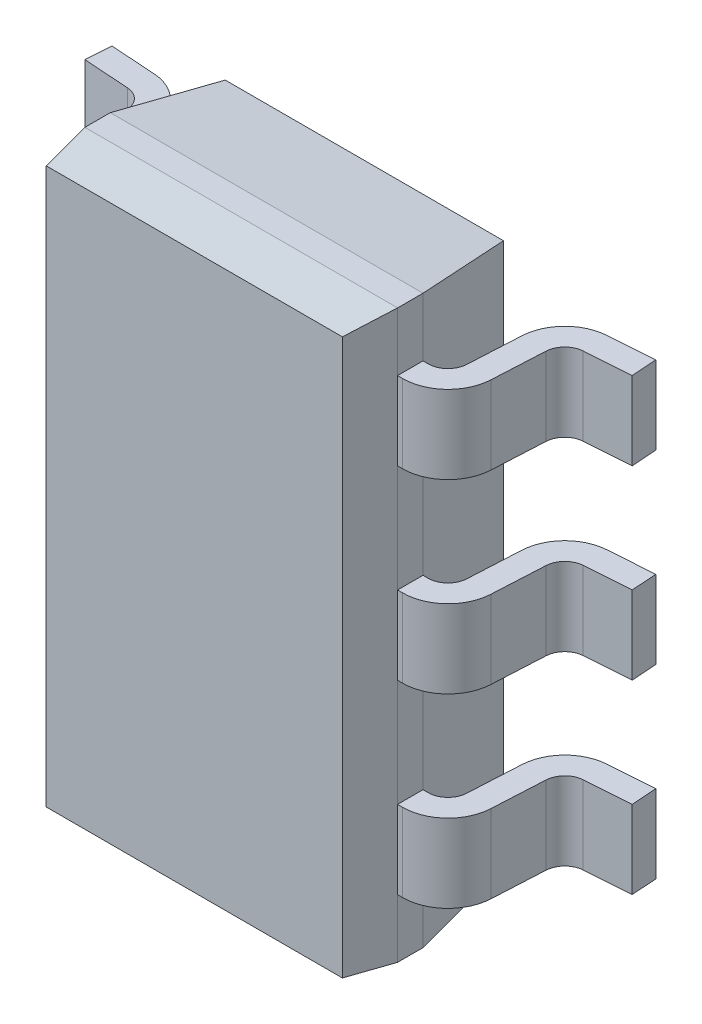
ISO-10303-21;
HEADER;
FILE_DESCRIPTION(('STEP AP214'),'2;1');
FILE_NAME('part.step','',(''),(''),'','','');
FILE_SCHEMA(('AUTOMOTIVE_DESIGN { 1 0 10303 214 1 1 1 1 }'));
ENDSEC;
DATA;
#1=APPLICATION_CONTEXT('core data for automotive mechanical design processes');
#2=APPLICATION_PROTOCOL_DEFINITION('international standard','automotive_design',2000,#1);
#3=PRODUCT_CONTEXT('',#1,'mechanical');
#4=PRODUCT('Part','Part','',(#3));
#5=PRODUCT_RELATED_PRODUCT_CATEGORY('part','',(#4));
#6=PRODUCT_DEFINITION_FORMATION('','',#4);
#7=PRODUCT_DEFINITION_CONTEXT('part definition',#1,'design');
#8=PRODUCT_DEFINITION('design','',#6,#7);
#9=PRODUCT_DEFINITION_SHAPE('','',#8);
#10=(LENGTH_UNIT() NAMED_UNIT(*) SI_UNIT(.MILLI.,.METRE.));
#11=(NAMED_UNIT(*) PLANE_ANGLE_UNIT() SI_UNIT($,.RADIAN.));
#12=(NAMED_UNIT(*) SI_UNIT($,.STERADIAN.) SOLID_ANGLE_UNIT());
#13=UNCERTAINTY_MEASURE_WITH_UNIT(LENGTH_MEASURE(1.E-05),#10,'distance_accuracy_value','');
#14=(GEOMETRIC_REPRESENTATION_CONTEXT(3) GLOBAL_UNCERTAINTY_ASSIGNED_CONTEXT((#13)) GLOBAL_UNIT_ASSIGNED_CONTEXT((#10,
#11,#12)) REPRESENTATION_CONTEXT('',''));
#15=CARTESIAN_POINT('',(0.,0.,0.));
#16=DIRECTION('',(0.,0.,1.));
#17=DIRECTION('',(1.,0.,0.));
#18=AXIS2_PLACEMENT_3D('',#15,#16,#17);
#19=CARTESIAN_POINT('',(0.000121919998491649,4.06399994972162E-05,0.97));
#20=DIRECTION('',(0.,0.,1.));
#21=DIRECTION('',(-1.74845553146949E-07,0.999999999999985,0.));
#22=AXIS2_PLACEMENT_3D('',#19,#20,#21);
#23=PLANE('',#22);
#24=DIRECTION('',(-1.74845553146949E-07,0.999999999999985,0.));
#25=VECTOR('',#24,1.);
#26=CARTESIAN_POINT('',(0.757803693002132,-1.42049093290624,0.97));
#27=LINE('',#26,#25);
#28=CARTESIAN_POINT('',(0.757803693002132,-1.42049093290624,0.97));
#29=VERTEX_POINT('',#28);
#30=CARTESIAN_POINT('',(0.757803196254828,1.42057247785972,0.97));
#31=VERTEX_POINT('',#30);
#32=EDGE_CURVE('P0_E11',#29,#31,#27,.T.);
#33=ORIENTED_EDGE('',*,*,#32,.T.);
#34=DIRECTION('',(-0.999999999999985,-1.74845553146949E-07,0.));
#35=VECTOR('',#34,1.);
#36=CARTESIAN_POINT('',(0.757803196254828,1.42057247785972,0.97));
#37=LINE('',#36,#35);
#38=CARTESIAN_POINT('',(-0.757559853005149,1.42057221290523,0.97));
#39=VERTEX_POINT('',#38);
#40=EDGE_CURVE('P0_E24',#31,#39,#37,.T.);
#41=ORIENTED_EDGE('',*,*,#40,.T.);
#42=DIRECTION('',(1.74845553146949E-07,-0.999999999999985,0.));
#43=VECTOR('',#42,1.);
#44=CARTESIAN_POINT('',(-0.757559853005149,1.42057221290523,0.97));
#45=LINE('',#44,#43);
#46=CARTESIAN_POINT('',(-0.757559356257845,-1.42049119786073,0.97));
#47=VERTEX_POINT('',#46);
#48=EDGE_CURVE('P0_E156',#39,#47,#45,.T.);
#49=ORIENTED_EDGE('',*,*,#48,.T.);
#50=DIRECTION('',(0.999999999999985,1.74845553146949E-07,0.));
#51=VECTOR('',#50,1.);
#52=CARTESIAN_POINT('',(-0.757559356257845,-1.42049119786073,0.97));
#53=LINE('',#52,#51);
#54=EDGE_CURVE('P0_E36',#47,#29,#53,.T.);
#55=ORIENTED_EDGE('',*,*,#54,.T.);
#56=EDGE_LOOP('',(#33,#41,#49,#55));
#57=FACE_BOUND('',#56,.T.);
#58=ADVANCED_FACE('P0_F17',(#57),#23,.T.);
#59=CARTESIAN_POINT('',(-0.799877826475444,-1.44995949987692,0.73));
#60=DIRECTION('',(1.73542280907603E-07,-0.992546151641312,0.121869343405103));
#61=DIRECTION('',(0.999999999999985,1.74845553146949E-07,0.));
#62=AXIS2_PLACEMENT_3D('',#59,#60,#61);
#63=PLANE('',#62);
#64=DIRECTION('',(-0.172392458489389,0.120044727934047,0.977686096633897));
#65=VECTOR('',#64,1.);
#66=CARTESIAN_POINT('',(0.800122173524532,-1.44995922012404,0.73));
#67=LINE('',#66,#65);
#68=CARTESIAN_POINT('',(0.800122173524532,-1.44995922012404,0.73));
#69=VERTEX_POINT('',#68);
#70=EDGE_CURVE('P0_E152',#69,#29,#67,.T.);
#71=ORIENTED_EDGE('',*,*,#70,.T.);
#72=ORIENTED_EDGE('',*,*,#54,.F.);
#73=DIRECTION('',(0.172392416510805,0.120044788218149,0.977686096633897));
#74=VECTOR('',#73,1.);
#75=CARTESIAN_POINT('',(-0.799877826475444,-1.44995949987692,0.73));
#76=LINE('',#75,#74);
#77=CARTESIAN_POINT('',(-0.799877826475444,-1.44995949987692,0.73));
#78=VERTEX_POINT('',#77);
#79=EDGE_CURVE('P0_E149',#78,#47,#76,.T.);
#80=ORIENTED_EDGE('',*,*,#79,.F.);
#81=DIRECTION('',(-0.999999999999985,-1.74845553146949E-07,0.));
#82=VECTOR('',#81,1.);
#83=CARTESIAN_POINT('',(0.800122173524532,-1.44995922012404,0.73));
#84=LINE('',#83,#82);
#85=EDGE_CURVE('P0_E147',#69,#78,#84,.T.);
#86=ORIENTED_EDGE('',*,*,#85,.F.);
#87=EDGE_LOOP('',(#71,#72,#80,#86));
#88=FACE_BOUND('',#87,.T.);
#89=ADVANCED_FACE('P0_F177',(#88),#63,.T.);
#90=CARTESIAN_POINT('',(-0.799877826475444,-1.44995949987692,0.73));
#91=DIRECTION('',(1.74845553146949E-07,-0.999999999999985,0.));
#92=DIRECTION('',(0.999999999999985,1.74845553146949E-07,0.));
#93=AXIS2_PLACEMENT_3D('',#90,#91,#92);
#94=PLANE('',#93);
#95=DIRECTION('',(0.,0.,-1.));
#96=VECTOR('',#95,1.);
#97=CARTESIAN_POINT('',(-0.799877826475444,-1.44995949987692,0.73));
#98=LINE('',#97,#96);
#99=CARTESIAN_POINT('',(-0.799877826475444,-1.44995949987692,0.6));
#100=VERTEX_POINT('',#99);
#101=EDGE_CURVE('P0_E144',#78,#100,#98,.T.);
#102=ORIENTED_EDGE('',*,*,#101,.T.);
#103=DIRECTION('',(-0.999999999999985,-1.74845553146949E-07,0.));
#104=VECTOR('',#103,1.);
#105=CARTESIAN_POINT('',(0.800122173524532,-1.44995922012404,0.6));
#106=LINE('',#105,#104);
#107=CARTESIAN_POINT('',(0.800122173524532,-1.44995922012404,0.6));
#108=VERTEX_POINT('',#107);
#109=EDGE_CURVE('P0_E141',#108,#100,#106,.T.);
#110=ORIENTED_EDGE('',*,*,#109,.F.);
#111=DIRECTION('',(0.,0.,-1.));
#112=VECTOR('',#111,1.);
#113=CARTESIAN_POINT('',(0.800122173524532,-1.44995922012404,0.73));
#114=LINE('',#113,#112);
#115=EDGE_CURVE('P0_E139',#69,#108,#114,.T.);
#116=ORIENTED_EDGE('',*,*,#115,.F.);
#117=ORIENTED_EDGE('',*,*,#85,.T.);
#118=EDGE_LOOP('',(#102,#110,#116,#117));
#119=FACE_BOUND('',#118,.T.);
#120=ADVANCED_FACE('P0_F171',(#119),#94,.T.);
#121=CARTESIAN_POINT('',(0.800122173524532,-1.44995922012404,0.73));
#122=DIRECTION('',(0.999999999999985,1.74845553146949E-07,0.));
#123=DIRECTION('',(-1.74845553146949E-07,0.999999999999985,0.));
#124=AXIS2_PLACEMENT_3D('',#121,#122,#123);
#125=PLANE('',#124);
#126=ORIENTED_EDGE('',*,*,#115,.T.);
#127=DIRECTION('',(1.74845553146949E-07,-0.999999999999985,0.));
#128=VECTOR('',#127,1.);
#129=CARTESIAN_POINT('',(0.800121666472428,1.45004077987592,0.6));
#130=LINE('',#129,#128);
#131=CARTESIAN_POINT('',(0.800121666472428,1.45004077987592,0.6));
#132=VERTEX_POINT('',#131);
#133=EDGE_CURVE('P0_E137',#132,#108,#130,.T.);
#134=ORIENTED_EDGE('',*,*,#133,.F.);
#135=DIRECTION('',(0.,0.,-1.));
#136=VECTOR('',#135,1.);
#137=CARTESIAN_POINT('',(0.800121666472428,1.45004077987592,0.73));
#138=LINE('',#137,#136);
#139=CARTESIAN_POINT('',(0.800121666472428,1.45004077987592,0.73));
#140=VERTEX_POINT('',#139);
#141=EDGE_CURVE('P0_E134',#140,#132,#138,.T.);
#142=ORIENTED_EDGE('',*,*,#141,.F.);
#143=DIRECTION('',(-1.74845553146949E-07,0.999999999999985,0.));
#144=VECTOR('',#143,1.);
#145=CARTESIAN_POINT('',(0.800122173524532,-1.44995922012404,0.73));
#146=LINE('',#145,#144);
#147=EDGE_CURVE('P0_E131',#69,#140,#146,.T.);
#148=ORIENTED_EDGE('',*,*,#147,.F.);
#149=EDGE_LOOP('',(#126,#134,#142,#148));
#150=FACE_BOUND('',#149,.T.);
#151=ADVANCED_FACE('P0_F182',(#150),#125,.T.);
#152=CARTESIAN_POINT('',(0.800122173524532,-1.44995922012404,0.73));
#153=DIRECTION('',(0.984807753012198,1.72189256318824E-07,0.173648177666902));
#154=DIRECTION('',(-1.74845553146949E-07,0.999999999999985,0.));
#155=AXIS2_PLACEMENT_3D('',#152,#153,#154);
#156=PLANE('',#155);
#157=DIRECTION('',(-0.172392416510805,-0.120044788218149,0.977686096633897));
#158=VECTOR('',#157,1.);
#159=CARTESIAN_POINT('',(0.800121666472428,1.45004077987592,0.73));
#160=LINE('',#159,#158);
#161=EDGE_CURVE('P0_E128',#140,#31,#160,.T.);
#162=ORIENTED_EDGE('',*,*,#161,.T.);
#163=ORIENTED_EDGE('',*,*,#32,.F.);
#164=ORIENTED_EDGE('',*,*,#70,.F.);
#165=ORIENTED_EDGE('',*,*,#147,.T.);
#166=EDGE_LOOP('',(#162,#163,#164,#165));
#167=FACE_BOUND('',#166,.T.);
#168=ADVANCED_FACE('P0_F179',(#167),#156,.T.);
#169=CARTESIAN_POINT('',(0.800121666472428,1.45004077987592,0.73));
#170=DIRECTION('',(-1.73542280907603E-07,0.992546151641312,0.121869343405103));
#171=DIRECTION('',(-0.999999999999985,-1.74845553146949E-07,0.));
#172=AXIS2_PLACEMENT_3D('',#169,#170,#171);
#173=PLANE('',#172);
#174=DIRECTION('',(0.172392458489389,-0.120044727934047,0.977686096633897));
#175=VECTOR('',#174,1.);
#176=CARTESIAN_POINT('',(-0.799878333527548,1.45004050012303,0.73));
#177=LINE('',#176,#175);
#178=CARTESIAN_POINT('',(-0.799878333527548,1.45004050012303,0.73));
#179=VERTEX_POINT('',#178);
#180=EDGE_CURVE('P0_E126',#179,#39,#177,.T.);
#181=ORIENTED_EDGE('',*,*,#180,.T.);
#182=ORIENTED_EDGE('',*,*,#40,.F.);
#183=ORIENTED_EDGE('',*,*,#161,.F.);
#184=DIRECTION('',(-0.999999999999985,-1.74845553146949E-07,0.));
#185=VECTOR('',#184,1.);
#186=CARTESIAN_POINT('',(0.800121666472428,1.45004077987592,0.73));
#187=LINE('',#186,#185);
#188=EDGE_CURVE('P0_E124',#140,#179,#187,.T.);
#189=ORIENTED_EDGE('',*,*,#188,.T.);
#190=EDGE_LOOP('',(#181,#182,#183,#189));
#191=FACE_BOUND('',#190,.T.);
#192=ADVANCED_FACE('P0_F158',(#191),#173,.T.);
#193=CARTESIAN_POINT('',(0.800121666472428,1.45004077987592,0.73));
#194=DIRECTION('',(-1.74845553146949E-07,0.999999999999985,0.));
#195=DIRECTION('',(-0.999999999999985,-1.74845553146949E-07,0.));
#196=AXIS2_PLACEMENT_3D('',#193,#194,#195);
#197=PLANE('',#196);
#198=ORIENTED_EDGE('',*,*,#141,.T.);
#199=DIRECTION('',(-0.999999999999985,-1.74845553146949E-07,0.));
#200=VECTOR('',#199,1.);
#201=CARTESIAN_POINT('',(0.800121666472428,1.45004077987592,0.6));
#202=LINE('',#201,#200);
#203=CARTESIAN_POINT('',(-0.799878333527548,1.45004050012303,0.6));
#204=VERTEX_POINT('',#203);
#205=EDGE_CURVE('P0_E98',#132,#204,#202,.T.);
#206=ORIENTED_EDGE('',*,*,#205,.T.);
#207=DIRECTION('',(0.,0.,-1.));
#208=VECTOR('',#207,1.);
#209=CARTESIAN_POINT('',(-0.799878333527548,1.45004050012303,0.73));
#210=LINE('',#209,#208);
#211=EDGE_CURVE('P0_E120',#179,#204,#210,.T.);
#212=ORIENTED_EDGE('',*,*,#211,.F.);
#213=ORIENTED_EDGE('',*,*,#188,.F.);
#214=EDGE_LOOP('',(#198,#206,#212,#213));
#215=FACE_BOUND('',#214,.T.);
#216=ADVANCED_FACE('P0_F165',(#215),#197,.T.);
#217=CARTESIAN_POINT('',(-0.799878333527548,1.45004050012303,0.73));
#218=DIRECTION('',(-0.999999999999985,-1.74845553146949E-07,0.));
#219=DIRECTION('',(1.74845553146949E-07,-0.999999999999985,0.));
#220=AXIS2_PLACEMENT_3D('',#217,#218,#219);
#221=PLANE('',#220);
#222=ORIENTED_EDGE('',*,*,#211,.T.);
#223=DIRECTION('',(1.74845553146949E-07,-0.999999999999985,0.));
#224=VECTOR('',#223,1.);
#225=CARTESIAN_POINT('',(-0.799878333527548,1.45004050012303,0.6));
#226=LINE('',#225,#224);
#227=EDGE_CURVE('P0_E118',#204,#100,#226,.T.);
#228=ORIENTED_EDGE('',*,*,#227,.T.);
#229=ORIENTED_EDGE('',*,*,#101,.F.);
#230=DIRECTION('',(-1.74845553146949E-07,0.999999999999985,0.));
#231=VECTOR('',#230,1.);
#232=CARTESIAN_POINT('',(-0.799877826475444,-1.44995949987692,0.73));
#233=LINE('',#232,#231);
#234=EDGE_CURVE('P0_E115',#78,#179,#233,.T.);
#235=ORIENTED_EDGE('',*,*,#234,.T.);
#236=EDGE_LOOP('',(#222,#228,#229,#235));
#237=FACE_BOUND('',#236,.T.);
#238=ADVANCED_FACE('P0_F168',(#237),#221,.T.);
#239=CARTESIAN_POINT('',(-0.799878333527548,1.45004050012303,0.73));
#240=DIRECTION('',(-0.984807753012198,-1.72189256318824E-07,0.173648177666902));
#241=DIRECTION('',(1.74845553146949E-07,-0.999999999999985,0.));
#242=AXIS2_PLACEMENT_3D('',#239,#240,#241);
#243=PLANE('',#242);
#244=ORIENTED_EDGE('',*,*,#79,.T.);
#245=ORIENTED_EDGE('',*,*,#48,.F.);
#246=ORIENTED_EDGE('',*,*,#180,.F.);
#247=ORIENTED_EDGE('',*,*,#234,.F.);
#248=EDGE_LOOP('',(#244,#245,#246,#247));
#249=FACE_BOUND('',#248,.T.);
#250=ADVANCED_FACE('P0_F162',(#249),#243,.T.);
#251=CARTESIAN_POINT('',(-0.799877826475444,-1.44995949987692,0.6));
#252=DIRECTION('',(-0.984807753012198,-1.72189256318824E-07,-0.173648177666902));
#253=DIRECTION('',(-1.74845553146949E-07,0.999999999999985,0.));
#254=AXIS2_PLACEMENT_3D('',#251,#252,#253);
#255=PLANE('',#254);
#256=DIRECTION('',(0.172392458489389,-0.120044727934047,-0.977686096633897));
#257=VECTOR('',#256,1.);
#258=CARTESIAN_POINT('',(-0.799878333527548,1.45004050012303,0.6));
#259=LINE('',#258,#257);
#260=CARTESIAN_POINT('',(-0.711714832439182,1.38864823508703,0.1));
#261=VERTEX_POINT('',#260);
#262=EDGE_CURVE('P0_E113',#204,#261,#259,.T.);
#263=ORIENTED_EDGE('',*,*,#262,.T.);
#264=DIRECTION('',(-1.74845553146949E-07,0.999999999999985,0.));
#265=VECTOR('',#264,1.);
#266=CARTESIAN_POINT('',(-0.711714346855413,-1.38856720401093,0.1));
#267=LINE('',#266,#265);
#268=CARTESIAN_POINT('',(-0.711714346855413,-1.38856720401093,0.1));
#269=VERTEX_POINT('',#268);
#270=EDGE_CURVE('P0_E102',#269,#261,#267,.T.);
#271=ORIENTED_EDGE('',*,*,#270,.F.);
#272=DIRECTION('',(0.172392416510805,0.120044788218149,-0.977686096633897));
#273=VECTOR('',#272,1.);
#274=CARTESIAN_POINT('',(-0.799877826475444,-1.44995949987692,0.6));
#275=LINE('',#274,#273);
#276=EDGE_CURVE('P0_E109',#100,#269,#275,.T.);
#277=ORIENTED_EDGE('',*,*,#276,.F.);
#278=ORIENTED_EDGE('',*,*,#227,.F.);
#279=EDGE_LOOP('',(#263,#271,#277,#278));
#280=FACE_BOUND('',#279,.T.);
#281=ADVANCED_FACE('P0_F253',(#280),#255,.T.);
#282=CARTESIAN_POINT('',(0.800122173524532,-1.44995922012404,0.6));
#283=DIRECTION('',(1.73542280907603E-07,-0.992546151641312,-0.121869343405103));
#284=DIRECTION('',(-0.999999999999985,-1.74845553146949E-07,0.));
#285=AXIS2_PLACEMENT_3D('',#282,#283,#284);
#286=PLANE('',#285);
#287=ORIENTED_EDGE('',*,*,#276,.T.);
#288=DIRECTION('',(-0.999999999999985,-1.74845553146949E-07,0.));
#289=VECTOR('',#288,1.);
#290=CARTESIAN_POINT('',(0.711958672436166,-1.38856695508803,0.1));
#291=LINE('',#290,#289);
#292=CARTESIAN_POINT('',(0.711958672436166,-1.38856695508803,0.1));
#293=VERTEX_POINT('',#292);
#294=EDGE_CURVE('P0_E107',#293,#269,#291,.T.);
#295=ORIENTED_EDGE('',*,*,#294,.F.);
#296=DIRECTION('',(-0.172392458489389,0.120044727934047,-0.977686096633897));
#297=VECTOR('',#296,1.);
#298=CARTESIAN_POINT('',(0.800122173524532,-1.44995922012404,0.6));
#299=LINE('',#298,#297);
#300=EDGE_CURVE('P0_E87',#108,#293,#299,.T.);
#301=ORIENTED_EDGE('',*,*,#300,.F.);
#302=ORIENTED_EDGE('',*,*,#109,.T.);
#303=EDGE_LOOP('',(#287,#295,#301,#302));
#304=FACE_BOUND('',#303,.T.);
#305=ADVANCED_FACE('P0_F262',(#304),#286,.T.);
#306=CARTESIAN_POINT('',(0.800121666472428,1.45004077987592,0.6));
#307=DIRECTION('',(0.984807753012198,1.72189256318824E-07,-0.173648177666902));
#308=DIRECTION('',(1.74845553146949E-07,-0.999999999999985,0.));
#309=AXIS2_PLACEMENT_3D('',#306,#307,#308);
#310=PLANE('',#309);
#311=ORIENTED_EDGE('',*,*,#300,.T.);
#312=DIRECTION('',(1.74845553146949E-07,-0.999999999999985,0.));
#313=VECTOR('',#312,1.);
#314=CARTESIAN_POINT('',(0.711958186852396,1.38864848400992,0.1));
#315=LINE('',#314,#313);
#316=CARTESIAN_POINT('',(0.711958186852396,1.38864848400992,0.1));
#317=VERTEX_POINT('',#316);
#318=EDGE_CURVE('P0_E81',#317,#293,#315,.T.);
#319=ORIENTED_EDGE('',*,*,#318,.F.);
#320=DIRECTION('',(-0.172392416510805,-0.120044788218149,-0.977686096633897));
#321=VECTOR('',#320,1.);
#322=CARTESIAN_POINT('',(0.800121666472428,1.45004077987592,0.6));
#323=LINE('',#322,#321);
#324=EDGE_CURVE('P0_E85',#132,#317,#323,.T.);
#325=ORIENTED_EDGE('',*,*,#324,.F.);
#326=ORIENTED_EDGE('',*,*,#133,.T.);
#327=EDGE_LOOP('',(#311,#319,#325,#326));
#328=FACE_BOUND('',#327,.T.);
#329=ADVANCED_FACE('P0_F83',(#328),#310,.T.);
#330=CARTESIAN_POINT('',(-0.799878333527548,1.45004050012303,0.6));
#331=DIRECTION('',(-1.73542280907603E-07,0.992546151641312,-0.121869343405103));
#332=DIRECTION('',(0.999999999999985,1.74845553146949E-07,0.));
#333=AXIS2_PLACEMENT_3D('',#330,#331,#332);
#334=PLANE('',#333);
#335=ORIENTED_EDGE('',*,*,#324,.T.);
#336=DIRECTION('',(0.999999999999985,1.74845553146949E-07,0.));
#337=VECTOR('',#336,1.);
#338=CARTESIAN_POINT('',(-0.711714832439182,1.38864823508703,0.1));
#339=LINE('',#338,#337);
#340=EDGE_CURVE('P0_E97',#261,#317,#339,.T.);
#341=ORIENTED_EDGE('',*,*,#340,.F.);
#342=ORIENTED_EDGE('',*,*,#262,.F.);
#343=ORIENTED_EDGE('',*,*,#205,.F.);
#344=EDGE_LOOP('',(#335,#341,#342,#343));
#345=FACE_BOUND('',#344,.T.);
#346=ADVANCED_FACE('P0_F95',(#345),#334,.T.);
#347=CARTESIAN_POINT('',(0.000121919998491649,4.06399994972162E-05,0.1));
#348=DIRECTION('',(0.,0.,-1.));
#349=DIRECTION('',(1.74845553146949E-07,-0.999999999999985,0.));
#350=AXIS2_PLACEMENT_3D('',#347,#348,#349);
#351=PLANE('',#350);
#352=ORIENTED_EDGE('',*,*,#318,.T.);
#353=ORIENTED_EDGE('',*,*,#294,.T.);
#354=ORIENTED_EDGE('',*,*,#270,.T.);
#355=ORIENTED_EDGE('',*,*,#340,.T.);
#356=EDGE_LOOP('',(#352,#353,#354,#355));
#357=FACE_BOUND('',#356,.T.);
#358=ADVANCED_FACE('P0_F101',(#357),#351,.T.);
#359=CLOSED_SHELL('',(#58,#89,#120,#151,#168,#192,#216,#238,#250,#281,#305,#329,#346,#358));
#360=MANIFOLD_SOLID_BREP('P0_B1',#359);
#361=CARTESIAN_POINT('',(0.941053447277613,0.750040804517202,0.25));
#362=DIRECTION('',(-1.74845553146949E-07,0.999999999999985,0.));
#363=DIRECTION('',(-0.999999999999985,-1.74845553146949E-07,0.));
#364=AXIS2_PLACEMENT_3D('',#361,#362,#363);
#365=PLANE('',#364);
#366=CARTESIAN_POINT('',(1.17310723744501,0.750040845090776,0.247405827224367));
#367=DIRECTION('',(1.74845553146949E-07,-0.999999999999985,0.));
#368=DIRECTION('',(-0.998629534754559,-1.74605933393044E-07,-0.0523359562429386));
#369=AXIS2_PLACEMENT_3D('',#366,#367,#368);
#370=CIRCLE('',#369,0.2316);
#371=CARTESIAN_POINT('',(0.941824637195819,0.750040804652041,0.2352848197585));
#372=VERTEX_POINT('',#371);
#373=CARTESIAN_POINT('',(1.15695163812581,0.750040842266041,0.0163699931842));
#374=VERTEX_POINT('',#373);
#375=EDGE_CURVE('P1_E11',#372,#374,#370,.T.);
#376=ORIENTED_EDGE('',*,*,#375,.T.);
#377=DIRECTION('',(-0.997564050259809,-1.7441963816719E-07,0.0697564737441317));
#378=VECTOR('',#377,1.);
#379=CARTESIAN_POINT('',(1.39105344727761,0.750040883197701,0.));
#380=LINE('',#379,#378);
#381=CARTESIAN_POINT('',(1.39105344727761,0.750040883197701,0.));
#382=VERTEX_POINT('',#381);
#383=EDGE_CURVE('P1_E24',#382,#374,#380,.T.);
#384=ORIENTED_EDGE('',*,*,#383,.F.);
#385=DIRECTION('',(-0.0697564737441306,-1.21966092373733E-08,-0.997564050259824));
#386=VECTOR('',#385,1.);
#387=CARTESIAN_POINT('',(1.4001217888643,0.75004088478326,0.1296833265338));
#388=LINE('',#387,#386);
#389=CARTESIAN_POINT('',(1.4001217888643,0.75004088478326,0.1296833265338));
#390=VERTEX_POINT('',#389);
#391=EDGE_CURVE('P1_E181',#390,#382,#388,.T.);
#392=ORIENTED_EDGE('',*,*,#391,.F.);
#393=DIRECTION('',(0.997564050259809,1.7441963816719E-07,-0.0697564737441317));
#394=VECTOR('',#393,1.);
#395=CARTESIAN_POINT('',(1.16601997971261,0.7500408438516,0.146053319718));
#396=LINE('',#395,#394);
#397=CARTESIAN_POINT('',(1.16601997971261,0.7500408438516,0.146053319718));
#398=VERTEX_POINT('',#397);
#399=EDGE_CURVE('P1_E178',#398,#390,#396,.T.);
#400=ORIENTED_EDGE('',*,*,#399,.F.);
#401=CARTESIAN_POINT('',(1.17310723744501,0.750040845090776,0.247405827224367));
#402=DIRECTION('',(-1.74845553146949E-07,0.999999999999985,0.));
#403=DIRECTION('',(-0.0697564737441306,-1.21966092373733E-08,-0.997564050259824));
#404=AXIS2_PLACEMENT_3D('',#401,#402,#403);
#405=CIRCLE('',#404,0.1016);
#406=CARTESIAN_POINT('',(1.07164647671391,0.750040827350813,0.242088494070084));
#407=VERTEX_POINT('',#406);
#408=EDGE_CURVE('P1_E175',#398,#407,#405,.T.);
#409=ORIENTED_EDGE('',*,*,#408,.T.);
#410=DIRECTION('',(-0.0523359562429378,-9.15070921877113E-09,0.998629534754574));
#411=VECTOR('',#410,1.);
#412=CARTESIAN_POINT('',(1.07164647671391,0.750040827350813,0.242088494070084));
#413=LINE('',#412,#411);
#414=CARTESIAN_POINT('',(1.05757852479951,0.750040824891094,0.5105210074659));
#415=VERTEX_POINT('',#414);
#416=EDGE_CURVE('P1_E173',#407,#415,#413,.T.);
#417=ORIENTED_EDGE('',*,*,#416,.T.);
#418=CARTESIAN_POINT('',(0.826295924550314,0.75004078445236,0.4984));
#419=DIRECTION('',(1.74845553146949E-07,-0.999999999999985,0.));
#420=DIRECTION('',(0.998629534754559,1.74605933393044E-07,0.0523359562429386));
#421=AXIS2_PLACEMENT_3D('',#418,#419,#420);
#422=CIRCLE('',#421,0.2316);
#423=CARTESIAN_POINT('',(0.826295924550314,0.75004078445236,0.73));
#424=VERTEX_POINT('',#423);
#425=EDGE_CURVE('P1_E111',#415,#424,#422,.T.);
#426=ORIENTED_EDGE('',*,*,#425,.T.);
#427=DIRECTION('',(0.999999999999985,1.74845553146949E-07,0.));
#428=VECTOR('',#427,1.);
#429=CARTESIAN_POINT('',(0.800121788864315,0.750040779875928,0.73));
#430=LINE('',#429,#428);
#431=CARTESIAN_POINT('',(0.800121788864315,0.750040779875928,0.73));
#432=VERTEX_POINT('',#431);
#433=EDGE_CURVE('P1_E169',#432,#424,#430,.T.);
#434=ORIENTED_EDGE('',*,*,#433,.F.);
#435=DIRECTION('',(0.,0.,1.));
#436=VECTOR('',#435,1.);
#437=CARTESIAN_POINT('',(0.800121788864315,0.750040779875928,0.6));
#438=LINE('',#437,#436);
#439=CARTESIAN_POINT('',(0.800121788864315,0.750040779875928,0.6));
#440=VERTEX_POINT('',#439);
#441=EDGE_CURVE('P1_E166',#440,#432,#438,.T.);
#442=ORIENTED_EDGE('',*,*,#441,.F.);
#443=DIRECTION('',(-0.999999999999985,-1.74845553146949E-07,0.));
#444=VECTOR('',#443,1.);
#445=CARTESIAN_POINT('',(0.826295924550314,0.75004078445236,0.6));
#446=LINE('',#445,#444);
#447=CARTESIAN_POINT('',(0.826295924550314,0.75004078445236,0.6));
#448=VERTEX_POINT('',#447);
#449=EDGE_CURVE('P1_E164',#448,#440,#446,.T.);
#450=ORIENTED_EDGE('',*,*,#449,.F.);
#451=CARTESIAN_POINT('',(0.826295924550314,0.75004078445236,0.4984));
#452=DIRECTION('',(-1.74845553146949E-07,0.999999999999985,0.));
#453=DIRECTION('',(0.,0.,1.));
#454=AXIS2_PLACEMENT_3D('',#451,#452,#453);
#455=CIRCLE('',#454,0.1016);
#456=CARTESIAN_POINT('',(0.927756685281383,0.750040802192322,0.5037173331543));
#457=VERTEX_POINT('',#456);
#458=EDGE_CURVE('P1_E162',#448,#457,#455,.T.);
#459=ORIENTED_EDGE('',*,*,#458,.T.);
#460=DIRECTION('',(0.0523359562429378,9.15070921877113E-09,-0.998629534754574));
#461=VECTOR('',#460,1.);
#462=CARTESIAN_POINT('',(0.927756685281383,0.750040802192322,0.5037173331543));
#463=LINE('',#462,#461);
#464=EDGE_CURVE('P1_E37',#457,#372,#463,.T.);
#465=ORIENTED_EDGE('',*,*,#464,.T.);
#466=EDGE_LOOP('',(#376,#384,#392,#400,#409,#417,#426,#434,#442,#450,#459,#465));
#467=FACE_BOUND('',#466,.T.);
#468=ADVANCED_FACE('P1_F17',(#467),#365,.F.);
#469=CARTESIAN_POINT('',(0.952548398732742,0.750040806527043,0.0306632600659));
#470=DIRECTION('',(-0.998629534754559,-1.74605933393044E-07,-0.0523359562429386));
#471=DIRECTION('',(-0.0523359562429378,-9.15070921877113E-09,0.998629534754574));
#472=AXIS2_PLACEMENT_3D('',#469,#470,#471);
#473=PLANE('',#472);
#474=DIRECTION('',(-1.74845553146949E-07,0.999999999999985,0.));
#475=VECTOR('',#474,1.);
#476=CARTESIAN_POINT('',(0.941824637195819,0.750040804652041,0.2352848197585));
#477=LINE('',#476,#475);
#478=CARTESIAN_POINT('',(0.941824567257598,1.15004080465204,0.2352848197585));
#479=VERTEX_POINT('',#478);
#480=EDGE_CURVE('P1_E158',#372,#479,#477,.T.);
#481=ORIENTED_EDGE('',*,*,#480,.F.);
#482=ORIENTED_EDGE('',*,*,#464,.F.);
#483=DIRECTION('',(-1.74845553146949E-07,0.999999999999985,0.));
#484=VECTOR('',#483,1.);
#485=CARTESIAN_POINT('',(0.927756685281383,0.750040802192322,0.5037173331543));
#486=LINE('',#485,#484);
#487=CARTESIAN_POINT('',(0.927756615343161,1.15004080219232,0.5037173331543));
#488=VERTEX_POINT('',#487);
#489=EDGE_CURVE('P1_E155',#457,#488,#486,.T.);
#490=ORIENTED_EDGE('',*,*,#489,.T.);
#491=DIRECTION('',(-0.0523359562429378,-9.15070921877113E-09,0.998629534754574));
#492=VECTOR('',#491,1.);
#493=CARTESIAN_POINT('',(0.941824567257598,1.15004080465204,0.2352848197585));
#494=LINE('',#493,#492);
#495=EDGE_CURVE('P1_E152',#479,#488,#494,.T.);
#496=ORIENTED_EDGE('',*,*,#495,.F.);
#497=EDGE_LOOP('',(#481,#482,#490,#496));
#498=FACE_BOUND('',#497,.T.);
#499=ADVANCED_FACE('P1_F195',(#498),#473,.T.);
#500=CARTESIAN_POINT('',(0.941053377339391,1.1500408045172,0.25));
#501=DIRECTION('',(-1.74845553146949E-07,0.999999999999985,0.));
#502=DIRECTION('',(-0.999999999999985,-1.74845553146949E-07,0.));
#503=AXIS2_PLACEMENT_3D('',#500,#501,#502);
#504=PLANE('',#503);
#505=CARTESIAN_POINT('',(1.17310716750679,1.15004084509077,0.247405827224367));
#506=DIRECTION('',(-1.74845553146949E-07,0.999999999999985,0.));
#507=DIRECTION('',(-0.0697564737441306,-1.21966092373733E-08,-0.997564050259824));
#508=AXIS2_PLACEMENT_3D('',#505,#506,#507);
#509=CIRCLE('',#508,0.1016);
#510=CARTESIAN_POINT('',(1.16601990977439,1.15004084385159,0.146053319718));
#511=VERTEX_POINT('',#510);
#512=CARTESIAN_POINT('',(1.07164640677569,1.15004082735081,0.242088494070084));
#513=VERTEX_POINT('',#512);
#514=EDGE_CURVE('P1_E150',#511,#513,#509,.T.);
#515=ORIENTED_EDGE('',*,*,#514,.F.);
#516=DIRECTION('',(0.997564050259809,1.7441963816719E-07,-0.0697564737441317));
#517=VECTOR('',#516,1.);
#518=CARTESIAN_POINT('',(1.16601990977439,1.15004084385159,0.146053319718));
#519=LINE('',#518,#517);
#520=CARTESIAN_POINT('',(1.40012171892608,1.15004088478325,0.1296833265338));
#521=VERTEX_POINT('',#520);
#522=EDGE_CURVE('P1_E147',#511,#521,#519,.T.);
#523=ORIENTED_EDGE('',*,*,#522,.T.);
#524=DIRECTION('',(-0.0697564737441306,-1.21966092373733E-08,-0.997564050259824));
#525=VECTOR('',#524,1.);
#526=CARTESIAN_POINT('',(1.40012171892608,1.15004088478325,0.1296833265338));
#527=LINE('',#526,#525);
#528=CARTESIAN_POINT('',(1.39105337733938,1.15004088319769,0.));
#529=VERTEX_POINT('',#528);
#530=EDGE_CURVE('P1_E144',#521,#529,#527,.T.);
#531=ORIENTED_EDGE('',*,*,#530,.T.);
#532=DIRECTION('',(-0.997564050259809,-1.7441963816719E-07,0.0697564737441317));
#533=VECTOR('',#532,1.);
#534=CARTESIAN_POINT('',(1.39105337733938,1.15004088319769,0.));
#535=LINE('',#534,#533);
#536=CARTESIAN_POINT('',(1.15695156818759,1.15004084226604,0.0163699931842));
#537=VERTEX_POINT('',#536);
#538=EDGE_CURVE('P1_E142',#529,#537,#535,.T.);
#539=ORIENTED_EDGE('',*,*,#538,.T.);
#540=CARTESIAN_POINT('',(1.17310716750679,1.15004084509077,0.247405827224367));
#541=DIRECTION('',(1.74845553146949E-07,-0.999999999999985,0.));
#542=DIRECTION('',(-0.998629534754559,-1.74605933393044E-07,-0.0523359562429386));
#543=AXIS2_PLACEMENT_3D('',#540,#541,#542);
#544=CIRCLE('',#543,0.2316);
#545=EDGE_CURVE('P1_E140',#479,#537,#544,.T.);
#546=ORIENTED_EDGE('',*,*,#545,.F.);
#547=ORIENTED_EDGE('',*,*,#495,.T.);
#548=CARTESIAN_POINT('',(0.826295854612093,1.15004078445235,0.4984));
#549=DIRECTION('',(-1.74845553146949E-07,0.999999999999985,0.));
#550=DIRECTION('',(0.,0.,1.));
#551=AXIS2_PLACEMENT_3D('',#548,#549,#550);
#552=CIRCLE('',#551,0.1016);
#553=CARTESIAN_POINT('',(0.826295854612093,1.15004078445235,0.6));
#554=VERTEX_POINT('',#553);
#555=EDGE_CURVE('P1_E138',#554,#488,#552,.T.);
#556=ORIENTED_EDGE('',*,*,#555,.F.);
#557=DIRECTION('',(-0.999999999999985,-1.74845553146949E-07,0.));
#558=VECTOR('',#557,1.);
#559=CARTESIAN_POINT('',(0.826295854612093,1.15004078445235,0.6));
#560=LINE('',#559,#558);
#561=CARTESIAN_POINT('',(0.800121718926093,1.15004077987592,0.6));
#562=VERTEX_POINT('',#561);
#563=EDGE_CURVE('P1_E135',#554,#562,#560,.T.);
#564=ORIENTED_EDGE('',*,*,#563,.T.);
#565=DIRECTION('',(0.,0.,1.));
#566=VECTOR('',#565,1.);
#567=CARTESIAN_POINT('',(0.800121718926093,1.15004077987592,0.6));
#568=LINE('',#567,#566);
#569=CARTESIAN_POINT('',(0.800121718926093,1.15004077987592,0.73));
#570=VERTEX_POINT('',#569);
#571=EDGE_CURVE('P1_E130',#562,#570,#568,.T.);
#572=ORIENTED_EDGE('',*,*,#571,.T.);
#573=DIRECTION('',(0.999999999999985,1.74845553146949E-07,0.));
#574=VECTOR('',#573,1.);
#575=CARTESIAN_POINT('',(0.800121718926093,1.15004077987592,0.73));
#576=LINE('',#575,#574);
#577=CARTESIAN_POINT('',(0.826295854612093,1.15004078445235,0.73));
#578=VERTEX_POINT('',#577);
#579=EDGE_CURVE('P1_E128',#570,#578,#576,.T.);
#580=ORIENTED_EDGE('',*,*,#579,.T.);
#581=CARTESIAN_POINT('',(0.826295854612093,1.15004078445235,0.4984));
#582=DIRECTION('',(1.74845553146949E-07,-0.999999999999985,0.));
#583=DIRECTION('',(0.998629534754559,1.74605933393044E-07,0.0523359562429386));
#584=AXIS2_PLACEMENT_3D('',#581,#582,#583);
#585=CIRCLE('',#584,0.2316);
#586=CARTESIAN_POINT('',(1.05757845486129,1.15004082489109,0.5105210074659));
#587=VERTEX_POINT('',#586);
#588=EDGE_CURVE('P1_E109',#587,#578,#585,.T.);
#589=ORIENTED_EDGE('',*,*,#588,.F.);
#590=DIRECTION('',(0.0523359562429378,9.15070921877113E-09,-0.998629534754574));
#591=VECTOR('',#590,1.);
#592=CARTESIAN_POINT('',(1.05757845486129,1.15004082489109,0.5105210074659));
#593=LINE('',#592,#591);
#594=EDGE_CURVE('P1_E119',#587,#513,#593,.T.);
#595=ORIENTED_EDGE('',*,*,#594,.T.);
#596=EDGE_LOOP('',(#515,#523,#531,#539,#546,#547,#556,#564,#572,#580,#589,#595));
#597=FACE_BOUND('',#596,.T.);
#598=ADVANCED_FACE('P1_F126',(#597),#504,.T.);
#599=CARTESIAN_POINT('',(1.07087528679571,0.750040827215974,0.256803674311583));
#600=DIRECTION('',(0.998629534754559,1.74605933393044E-07,0.0523359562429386));
#601=DIRECTION('',(0.0523359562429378,9.15070921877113E-09,-0.998629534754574));
#602=AXIS2_PLACEMENT_3D('',#599,#600,#601);
#603=PLANE('',#602);
#604=DIRECTION('',(-1.74845553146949E-07,0.999999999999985,0.));
#605=VECTOR('',#604,1.);
#606=CARTESIAN_POINT('',(1.07164647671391,0.750040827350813,0.242088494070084));
#607=LINE('',#606,#605);
#608=EDGE_CURVE('P1_E115',#407,#513,#607,.T.);
#609=ORIENTED_EDGE('',*,*,#608,.T.);
#610=ORIENTED_EDGE('',*,*,#594,.F.);
#611=DIRECTION('',(-1.74845553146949E-07,0.999999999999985,0.));
#612=VECTOR('',#611,1.);
#613=CARTESIAN_POINT('',(1.05757852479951,0.750040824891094,0.5105210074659));
#614=LINE('',#613,#612);
#615=EDGE_CURVE('P1_E105',#415,#587,#614,.T.);
#616=ORIENTED_EDGE('',*,*,#615,.F.);
#617=ORIENTED_EDGE('',*,*,#416,.F.);
#618=EDGE_LOOP('',(#609,#610,#616,#617));
#619=FACE_BOUND('',#618,.T.);
#620=ADVANCED_FACE('P1_F120',(#619),#603,.T.);
#621=CARTESIAN_POINT('',(0.826295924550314,0.75004078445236,0.4984));
#622=DIRECTION('',(1.74845553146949E-07,-0.999999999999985,0.));
#623=DIRECTION('',(0.998629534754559,1.74605933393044E-07,0.0523359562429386));
#624=AXIS2_PLACEMENT_3D('',#621,#622,#623);
#625=CYLINDRICAL_SURFACE('',#624,0.2316);
#626=ORIENTED_EDGE('',*,*,#588,.T.);
#627=DIRECTION('',(-1.74845553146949E-07,0.999999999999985,0.));
#628=VECTOR('',#627,1.);
#629=CARTESIAN_POINT('',(0.826295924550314,0.75004078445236,0.73));
#630=LINE('',#629,#628);
#631=EDGE_CURVE('P1_E116',#424,#578,#630,.T.);
#632=ORIENTED_EDGE('',*,*,#631,.F.);
#633=ORIENTED_EDGE('',*,*,#425,.F.);
#634=ORIENTED_EDGE('',*,*,#615,.T.);
#635=EDGE_LOOP('',(#626,#632,#633,#634));
#636=FACE_BOUND('',#635,.T.);
#637=ADVANCED_FACE('P1_F107',(#636),#625,.T.);
#638=CARTESIAN_POINT('',(0.800121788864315,0.750040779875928,0.73));
#639=DIRECTION('',(0.,0.,1.));
#640=DIRECTION('',(0.999999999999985,1.74845553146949E-07,0.));
#641=AXIS2_PLACEMENT_3D('',#638,#639,#640);
#642=PLANE('',#641);
#643=ORIENTED_EDGE('',*,*,#631,.T.);
#644=ORIENTED_EDGE('',*,*,#579,.F.);
#645=DIRECTION('',(-1.74845553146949E-07,0.999999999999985,0.));
#646=VECTOR('',#645,1.);
#647=CARTESIAN_POINT('',(0.800121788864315,0.750040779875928,0.73));
#648=LINE('',#647,#646);
#649=EDGE_CURVE('P1_E214',#432,#570,#648,.T.);
#650=ORIENTED_EDGE('',*,*,#649,.F.);
#651=ORIENTED_EDGE('',*,*,#433,.T.);
#652=EDGE_LOOP('',(#643,#644,#650,#651));
#653=FACE_BOUND('',#652,.T.);
#654=ADVANCED_FACE('P1_F218',(#653),#642,.T.);
#655=CARTESIAN_POINT('',(0.800121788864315,0.750040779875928,0.6));
#656=DIRECTION('',(-0.999999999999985,-1.74845553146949E-07,0.));
#657=DIRECTION('',(0.,0.,1.));
#658=AXIS2_PLACEMENT_3D('',#655,#656,#657);
#659=PLANE('',#658);
#660=ORIENTED_EDGE('',*,*,#649,.T.);
#661=ORIENTED_EDGE('',*,*,#571,.F.);
#662=DIRECTION('',(-1.74845553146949E-07,0.999999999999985,0.));
#663=VECTOR('',#662,1.);
#664=CARTESIAN_POINT('',(0.800121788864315,0.750040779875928,0.6));
#665=LINE('',#664,#663);
#666=EDGE_CURVE('P1_E211',#440,#562,#665,.T.);
#667=ORIENTED_EDGE('',*,*,#666,.F.);
#668=ORIENTED_EDGE('',*,*,#441,.T.);
#669=EDGE_LOOP('',(#660,#661,#667,#668));
#670=FACE_BOUND('',#669,.T.);
#671=ADVANCED_FACE('P1_F251',(#670),#659,.T.);
#672=CARTESIAN_POINT('',(0.922710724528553,0.750040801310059,0.6));
#673=DIRECTION('',(0.,0.,-1.));
#674=DIRECTION('',(-0.999999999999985,-1.74845553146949E-07,0.));
#675=AXIS2_PLACEMENT_3D('',#672,#673,#674);
#676=PLANE('',#675);
#677=ORIENTED_EDGE('',*,*,#666,.T.);
#678=ORIENTED_EDGE('',*,*,#563,.F.);
#679=DIRECTION('',(-1.74845553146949E-07,0.999999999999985,0.));
#680=VECTOR('',#679,1.);
#681=CARTESIAN_POINT('',(0.826295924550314,0.75004078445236,0.6));
#682=LINE('',#681,#680);
#683=EDGE_CURVE('P1_E209',#448,#554,#682,.T.);
#684=ORIENTED_EDGE('',*,*,#683,.F.);
#685=ORIENTED_EDGE('',*,*,#449,.T.);
#686=EDGE_LOOP('',(#677,#678,#684,#685));
#687=FACE_BOUND('',#686,.T.);
#688=ADVANCED_FACE('P1_F254',(#687),#676,.T.);
#689=CARTESIAN_POINT('',(0.826295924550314,0.75004078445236,0.4984));
#690=DIRECTION('',(-1.74845553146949E-07,0.999999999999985,0.));
#691=DIRECTION('',(0.,0.,1.));
#692=AXIS2_PLACEMENT_3D('',#689,#690,#691);
#693=CYLINDRICAL_SURFACE('',#692,0.1016);
#694=ORIENTED_EDGE('',*,*,#555,.T.);
#695=ORIENTED_EDGE('',*,*,#489,.F.);
#696=ORIENTED_EDGE('',*,*,#458,.F.);
#697=ORIENTED_EDGE('',*,*,#683,.T.);
#698=EDGE_LOOP('',(#694,#695,#696,#697));
#699=FACE_BOUND('',#698,.T.);
#700=ADVANCED_FACE('P1_F234',(#699),#693,.F.);
#701=CARTESIAN_POINT('',(1.17310723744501,0.750040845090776,0.247405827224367));
#702=DIRECTION('',(-1.74845553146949E-07,0.999999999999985,0.));
#703=DIRECTION('',(-0.0697564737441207,-1.21966092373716E-08,-0.997564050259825));
#704=AXIS2_PLACEMENT_3D('',#701,#702,#703);
#705=CYLINDRICAL_SURFACE('',#704,0.1016);
#706=ORIENTED_EDGE('',*,*,#514,.T.);
#707=ORIENTED_EDGE('',*,*,#608,.F.);
#708=ORIENTED_EDGE('',*,*,#408,.F.);
#709=DIRECTION('',(-1.74845553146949E-07,0.999999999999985,0.));
#710=VECTOR('',#709,1.);
#711=CARTESIAN_POINT('',(1.16601997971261,0.7500408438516,0.146053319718));
#712=LINE('',#711,#710);
#713=EDGE_CURVE('P1_E204',#398,#511,#712,.T.);
#714=ORIENTED_EDGE('',*,*,#713,.T.);
#715=EDGE_LOOP('',(#706,#707,#708,#714));
#716=FACE_BOUND('',#715,.T.);
#717=ADVANCED_FACE('P1_F223',(#716),#705,.F.);
#718=CARTESIAN_POINT('',(1.07635085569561,0.750040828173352,0.15232359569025));
#719=DIRECTION('',(0.0697564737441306,1.21966092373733E-08,0.997564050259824));
#720=DIRECTION('',(0.997564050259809,1.7441963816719E-07,-0.0697564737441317));
#721=AXIS2_PLACEMENT_3D('',#718,#719,#720);
#722=PLANE('',#721);
#723=DIRECTION('',(-1.74845553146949E-07,0.999999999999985,0.));
#724=VECTOR('',#723,1.);
#725=CARTESIAN_POINT('',(1.4001217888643,0.75004088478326,0.1296833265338));
#726=LINE('',#725,#724);
#727=EDGE_CURVE('P1_E202',#390,#521,#726,.T.);
#728=ORIENTED_EDGE('',*,*,#727,.T.);
#729=ORIENTED_EDGE('',*,*,#522,.F.);
#730=ORIENTED_EDGE('',*,*,#713,.F.);
#731=ORIENTED_EDGE('',*,*,#399,.T.);
#732=EDGE_LOOP('',(#728,#729,#730,#731));
#733=FACE_BOUND('',#732,.T.);
#734=ADVANCED_FACE('P1_F225',(#733),#722,.T.);
#735=CARTESIAN_POINT('',(1.4001217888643,0.75004088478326,0.1296833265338));
#736=DIRECTION('',(0.997564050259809,1.7441963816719E-07,-0.0697564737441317));
#737=DIRECTION('',(-0.0697564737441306,-1.21966092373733E-08,-0.997564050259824));
#738=AXIS2_PLACEMENT_3D('',#735,#736,#737);
#739=PLANE('',#738);
#740=DIRECTION('',(-1.74845553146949E-07,0.999999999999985,0.));
#741=VECTOR('',#740,1.);
#742=CARTESIAN_POINT('',(1.39105344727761,0.750040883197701,0.));
#743=LINE('',#742,#741);
#744=EDGE_CURVE('P1_E188',#382,#529,#743,.T.);
#745=ORIENTED_EDGE('',*,*,#744,.T.);
#746=ORIENTED_EDGE('',*,*,#530,.F.);
#747=ORIENTED_EDGE('',*,*,#727,.F.);
#748=ORIENTED_EDGE('',*,*,#391,.T.);
#749=EDGE_LOOP('',(#745,#746,#747,#748));
#750=FACE_BOUND('',#749,.T.);
#751=ADVANCED_FACE('P1_F201',(#750),#739,.T.);
#752=CARTESIAN_POINT('',(1.39105344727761,0.750040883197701,0.));
#753=DIRECTION('',(-0.0697564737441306,-1.21966092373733E-08,-0.997564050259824));
#754=DIRECTION('',(-0.997564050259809,-1.7441963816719E-07,0.0697564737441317));
#755=AXIS2_PLACEMENT_3D('',#752,#753,#754);
#756=PLANE('',#755);
#757=DIRECTION('',(-1.74845553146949E-07,0.999999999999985,0.));
#758=VECTOR('',#757,1.);
#759=CARTESIAN_POINT('',(1.15695163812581,0.750040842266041,0.0163699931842));
#760=LINE('',#759,#758);
#761=EDGE_CURVE('P1_E31',#374,#537,#760,.T.);
#762=ORIENTED_EDGE('',*,*,#761,.T.);
#763=ORIENTED_EDGE('',*,*,#538,.F.);
#764=ORIENTED_EDGE('',*,*,#744,.F.);
#765=ORIENTED_EDGE('',*,*,#383,.T.);
#766=EDGE_LOOP('',(#762,#763,#764,#765));
#767=FACE_BOUND('',#766,.T.);
#768=ADVANCED_FACE('P1_F186',(#767),#756,.T.);
#769=CARTESIAN_POINT('',(1.17310723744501,0.750040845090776,0.247405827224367));
#770=DIRECTION('',(1.74845553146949E-07,-0.999999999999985,0.));
#771=DIRECTION('',(-0.998629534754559,-1.74605933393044E-07,-0.0523359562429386));
#772=AXIS2_PLACEMENT_3D('',#769,#770,#771);
#773=CYLINDRICAL_SURFACE('',#772,0.2316);
#774=ORIENTED_EDGE('',*,*,#545,.T.);
#775=ORIENTED_EDGE('',*,*,#761,.F.);
#776=ORIENTED_EDGE('',*,*,#375,.F.);
#777=ORIENTED_EDGE('',*,*,#480,.T.);
#778=EDGE_LOOP('',(#774,#775,#776,#777));
#779=FACE_BOUND('',#778,.T.);
#780=ADVANCED_FACE('P1_F192',(#779),#773,.T.);
#781=CLOSED_SHELL('',(#468,#499,#598,#620,#637,#654,#671,#688,#700,#717,#734,#751,#768,#780));
#782=MANIFOLD_SOLID_BREP('P1_B1',#781);
#783=CARTESIAN_POINT('',(0.941053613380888,-0.199959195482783,0.25));
#784=DIRECTION('',(-1.74845553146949E-07,0.999999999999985,0.));
#785=DIRECTION('',(-0.999999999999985,-1.74845553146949E-07,0.));
#786=AXIS2_PLACEMENT_3D('',#783,#784,#785);
#787=PLANE('',#786);
#788=CARTESIAN_POINT('',(1.17310740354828,-0.19995915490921,0.247405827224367));
#789=DIRECTION('',(1.74845553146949E-07,-0.999999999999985,0.));
#790=DIRECTION('',(-0.998629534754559,-1.74605933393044E-07,-0.0523359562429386));
#791=AXIS2_PLACEMENT_3D('',#788,#789,#790);
#792=CIRCLE('',#791,0.2316);
#793=CARTESIAN_POINT('',(0.941824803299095,-0.199959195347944,0.2352848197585));
#794=VERTEX_POINT('',#793);
#795=CARTESIAN_POINT('',(1.15695180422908,-0.199959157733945,0.0163699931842));
#796=VERTEX_POINT('',#795);
#797=EDGE_CURVE('P2_E11',#794,#796,#792,.T.);
#798=ORIENTED_EDGE('',*,*,#797,.T.);
#799=DIRECTION('',(-0.997564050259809,-1.7441963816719E-07,0.0697564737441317));
#800=VECTOR('',#799,1.);
#801=CARTESIAN_POINT('',(1.39105361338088,-0.199959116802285,0.));
#802=LINE('',#801,#800);
#803=CARTESIAN_POINT('',(1.39105361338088,-0.199959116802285,0.));
#804=VERTEX_POINT('',#803);
#805=EDGE_CURVE('P2_E24',#804,#796,#802,.T.);
#806=ORIENTED_EDGE('',*,*,#805,.F.);
#807=DIRECTION('',(-0.0697564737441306,-1.21966092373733E-08,-0.997564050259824));
#808=VECTOR('',#807,1.);
#809=CARTESIAN_POINT('',(1.40012195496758,-0.199959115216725,0.1296833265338));
#810=LINE('',#809,#808);
#811=CARTESIAN_POINT('',(1.40012195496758,-0.199959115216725,0.1296833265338));
#812=VERTEX_POINT('',#811);
#813=EDGE_CURVE('P2_E181',#812,#804,#810,.T.);
#814=ORIENTED_EDGE('',*,*,#813,.F.);
#815=DIRECTION('',(0.997564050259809,1.7441963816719E-07,-0.0697564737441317));
#816=VECTOR('',#815,1.);
#817=CARTESIAN_POINT('',(1.16602014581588,-0.199959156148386,0.146053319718));
#818=LINE('',#817,#816);
#819=CARTESIAN_POINT('',(1.16602014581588,-0.199959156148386,0.146053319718));
#820=VERTEX_POINT('',#819);
#821=EDGE_CURVE('P2_E178',#820,#812,#818,.T.);
#822=ORIENTED_EDGE('',*,*,#821,.F.);
#823=CARTESIAN_POINT('',(1.17310740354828,-0.19995915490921,0.247405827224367));
#824=DIRECTION('',(-1.74845553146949E-07,0.999999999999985,0.));
#825=DIRECTION('',(-0.0697564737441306,-1.21966092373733E-08,-0.997564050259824));
#826=AXIS2_PLACEMENT_3D('',#823,#824,#825);
#827=CIRCLE('',#826,0.1016);
#828=CARTESIAN_POINT('',(1.07164664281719,-0.199959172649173,0.242088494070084));
#829=VERTEX_POINT('',#828);
#830=EDGE_CURVE('P2_E175',#820,#829,#827,.T.);
#831=ORIENTED_EDGE('',*,*,#830,.T.);
#832=DIRECTION('',(-0.0523359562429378,-9.15070921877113E-09,0.998629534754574));
#833=VECTOR('',#832,1.);
#834=CARTESIAN_POINT('',(1.07164664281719,-0.199959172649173,0.242088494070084));
#835=LINE('',#834,#833);
#836=CARTESIAN_POINT('',(1.05757869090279,-0.199959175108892,0.5105210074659));
#837=VERTEX_POINT('',#836);
#838=EDGE_CURVE('P2_E173',#829,#837,#835,.T.);
#839=ORIENTED_EDGE('',*,*,#838,.T.);
#840=CARTESIAN_POINT('',(0.82629609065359,-0.199959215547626,0.4984));
#841=DIRECTION('',(1.74845553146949E-07,-0.999999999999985,0.));
#842=DIRECTION('',(0.998629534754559,1.74605933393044E-07,0.0523359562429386));
#843=AXIS2_PLACEMENT_3D('',#840,#841,#842);
#844=CIRCLE('',#843,0.2316);
#845=CARTESIAN_POINT('',(0.82629609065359,-0.199959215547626,0.73));
#846=VERTEX_POINT('',#845);
#847=EDGE_CURVE('P2_E122',#837,#846,#844,.T.);
#848=ORIENTED_EDGE('',*,*,#847,.T.);
#849=DIRECTION('',(0.999999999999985,1.74845553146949E-07,0.));
#850=VECTOR('',#849,1.);
#851=CARTESIAN_POINT('',(0.80012195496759,-0.199959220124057,0.73));
#852=LINE('',#851,#850);
#853=CARTESIAN_POINT('',(0.80012195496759,-0.199959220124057,0.73));
#854=VERTEX_POINT('',#853);
#855=EDGE_CURVE('P2_E170',#854,#846,#852,.T.);
#856=ORIENTED_EDGE('',*,*,#855,.F.);
#857=DIRECTION('',(0.,0.,1.));
#858=VECTOR('',#857,1.);
#859=CARTESIAN_POINT('',(0.80012195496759,-0.199959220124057,0.6));
#860=LINE('',#859,#858);
#861=CARTESIAN_POINT('',(0.80012195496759,-0.199959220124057,0.6));
#862=VERTEX_POINT('',#861);
#863=EDGE_CURVE('P2_E168',#862,#854,#860,.T.);
#864=ORIENTED_EDGE('',*,*,#863,.F.);
#865=DIRECTION('',(-0.999999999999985,-1.74845553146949E-07,0.));
#866=VECTOR('',#865,1.);
#867=CARTESIAN_POINT('',(0.82629609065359,-0.199959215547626,0.6));
#868=LINE('',#867,#866);
#869=CARTESIAN_POINT('',(0.82629609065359,-0.199959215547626,0.6));
#870=VERTEX_POINT('',#869);
#871=EDGE_CURVE('P2_E166',#870,#862,#868,.T.);
#872=ORIENTED_EDGE('',*,*,#871,.F.);
#873=CARTESIAN_POINT('',(0.82629609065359,-0.199959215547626,0.4984));
#874=DIRECTION('',(-1.74845553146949E-07,0.999999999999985,0.));
#875=DIRECTION('',(0.,0.,1.));
#876=AXIS2_PLACEMENT_3D('',#873,#874,#875);
#877=CIRCLE('',#876,0.1016);
#878=CARTESIAN_POINT('',(0.927756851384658,-0.199959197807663,0.5037173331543));
#879=VERTEX_POINT('',#878);
#880=EDGE_CURVE('P2_E164',#870,#879,#877,.T.);
#881=ORIENTED_EDGE('',*,*,#880,.T.);
#882=DIRECTION('',(0.0523359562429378,9.15070921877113E-09,-0.998629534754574));
#883=VECTOR('',#882,1.);
#884=CARTESIAN_POINT('',(0.927756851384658,-0.199959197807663,0.5037173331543));
#885=LINE('',#884,#883);
#886=EDGE_CURVE('P2_E36',#879,#794,#885,.T.);
#887=ORIENTED_EDGE('',*,*,#886,.T.);
#888=EDGE_LOOP('',(#798,#806,#814,#822,#831,#839,#848,#856,#864,#872,#881,#887));
#889=FACE_BOUND('',#888,.T.);
#890=ADVANCED_FACE('P2_F17',(#889),#787,.F.);
#891=CARTESIAN_POINT('',(0.952548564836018,-0.199959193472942,0.0306632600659));
#892=DIRECTION('',(-0.998629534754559,-1.74605933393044E-07,-0.0523359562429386));
#893=DIRECTION('',(-0.0523359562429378,-9.15070921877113E-09,0.998629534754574));
#894=AXIS2_PLACEMENT_3D('',#891,#892,#893);
#895=PLANE('',#894);
#896=DIRECTION('',(-1.74845553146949E-07,0.999999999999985,0.));
#897=VECTOR('',#896,1.);
#898=CARTESIAN_POINT('',(0.941824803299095,-0.199959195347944,0.2352848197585));
#899=LINE('',#898,#897);
#900=CARTESIAN_POINT('',(0.941824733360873,0.20004080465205,0.2352848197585));
#901=VERTEX_POINT('',#900);
#902=EDGE_CURVE('P2_E160',#794,#901,#899,.T.);
#903=ORIENTED_EDGE('',*,*,#902,.F.);
#904=ORIENTED_EDGE('',*,*,#886,.F.);
#905=DIRECTION('',(-1.74845553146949E-07,0.999999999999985,0.));
#906=VECTOR('',#905,1.);
#907=CARTESIAN_POINT('',(0.927756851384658,-0.199959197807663,0.5037173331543));
#908=LINE('',#907,#906);
#909=CARTESIAN_POINT('',(0.927756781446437,0.200040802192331,0.5037173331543));
#910=VERTEX_POINT('',#909);
#911=EDGE_CURVE('P2_E157',#879,#910,#908,.T.);
#912=ORIENTED_EDGE('',*,*,#911,.T.);
#913=DIRECTION('',(-0.0523359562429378,-9.15070921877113E-09,0.998629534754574));
#914=VECTOR('',#913,1.);
#915=CARTESIAN_POINT('',(0.941824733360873,0.20004080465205,0.2352848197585));
#916=LINE('',#915,#914);
#917=EDGE_CURVE('P2_E154',#901,#910,#916,.T.);
#918=ORIENTED_EDGE('',*,*,#917,.F.);
#919=EDGE_LOOP('',(#903,#904,#912,#918));
#920=FACE_BOUND('',#919,.T.);
#921=ADVANCED_FACE('P2_F230',(#920),#895,.T.);
#922=CARTESIAN_POINT('',(0.941053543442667,0.20004080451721,0.25));
#923=DIRECTION('',(-1.74845553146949E-07,0.999999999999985,0.));
#924=DIRECTION('',(-0.999999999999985,-1.74845553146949E-07,0.));
#925=AXIS2_PLACEMENT_3D('',#922,#923,#924);
#926=PLANE('',#925);
#927=CARTESIAN_POINT('',(1.17310733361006,0.200040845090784,0.247405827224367));
#928=DIRECTION('',(-1.74845553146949E-07,0.999999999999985,0.));
#929=DIRECTION('',(-0.0697564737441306,-1.21966092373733E-08,-0.997564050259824));
#930=AXIS2_PLACEMENT_3D('',#927,#928,#929);
#931=CIRCLE('',#930,0.1016);
#932=CARTESIAN_POINT('',(1.16602007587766,0.200040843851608,0.146053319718));
#933=VERTEX_POINT('',#932);
#934=CARTESIAN_POINT('',(1.07164657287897,0.200040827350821,0.242088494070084));
#935=VERTEX_POINT('',#934);
#936=EDGE_CURVE('P2_E152',#933,#935,#931,.T.);
#937=ORIENTED_EDGE('',*,*,#936,.F.);
#938=DIRECTION('',(0.997564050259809,1.7441963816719E-07,-0.0697564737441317));
#939=VECTOR('',#938,1.);
#940=CARTESIAN_POINT('',(1.16602007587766,0.200040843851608,0.146053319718));
#941=LINE('',#940,#939);
#942=CARTESIAN_POINT('',(1.40012188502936,0.200040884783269,0.1296833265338));
#943=VERTEX_POINT('',#942);
#944=EDGE_CURVE('P2_E149',#933,#943,#941,.T.);
#945=ORIENTED_EDGE('',*,*,#944,.T.);
#946=DIRECTION('',(-0.0697564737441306,-1.21966092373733E-08,-0.997564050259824));
#947=VECTOR('',#946,1.);
#948=CARTESIAN_POINT('',(1.40012188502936,0.200040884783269,0.1296833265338));
#949=LINE('',#948,#947);
#950=CARTESIAN_POINT('',(1.39105354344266,0.200040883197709,0.));
#951=VERTEX_POINT('',#950);
#952=EDGE_CURVE('P2_E146',#943,#951,#949,.T.);
#953=ORIENTED_EDGE('',*,*,#952,.T.);
#954=DIRECTION('',(-0.997564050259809,-1.7441963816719E-07,0.0697564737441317));
#955=VECTOR('',#954,1.);
#956=CARTESIAN_POINT('',(1.39105354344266,0.200040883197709,0.));
#957=LINE('',#956,#955);
#958=CARTESIAN_POINT('',(1.15695173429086,0.200040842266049,0.0163699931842));
#959=VERTEX_POINT('',#958);
#960=EDGE_CURVE('P2_E143',#951,#959,#957,.T.);
#961=ORIENTED_EDGE('',*,*,#960,.T.);
#962=CARTESIAN_POINT('',(1.17310733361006,0.200040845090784,0.247405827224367));
#963=DIRECTION('',(1.74845553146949E-07,-0.999999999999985,0.));
#964=DIRECTION('',(-0.998629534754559,-1.74605933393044E-07,-0.0523359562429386));
#965=AXIS2_PLACEMENT_3D('',#962,#963,#964);
#966=CIRCLE('',#965,0.2316);
#967=EDGE_CURVE('P2_E141',#901,#959,#966,.T.);
#968=ORIENTED_EDGE('',*,*,#967,.F.);
#969=ORIENTED_EDGE('',*,*,#917,.T.);
#970=CARTESIAN_POINT('',(0.826296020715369,0.200040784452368,0.4984));
#971=DIRECTION('',(-1.74845553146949E-07,0.999999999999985,0.));
#972=DIRECTION('',(0.,0.,1.));
#973=AXIS2_PLACEMENT_3D('',#970,#971,#972);
#974=CIRCLE('',#973,0.1016);
#975=CARTESIAN_POINT('',(0.826296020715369,0.200040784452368,0.6));
#976=VERTEX_POINT('',#975);
#977=EDGE_CURVE('P2_E139',#976,#910,#974,.T.);
#978=ORIENTED_EDGE('',*,*,#977,.F.);
#979=DIRECTION('',(-0.999999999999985,-1.74845553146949E-07,0.));
#980=VECTOR('',#979,1.);
#981=CARTESIAN_POINT('',(0.826296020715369,0.200040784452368,0.6));
#982=LINE('',#981,#980);
#983=CARTESIAN_POINT('',(0.800121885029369,0.200040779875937,0.6));
#984=VERTEX_POINT('',#983);
#985=EDGE_CURVE('P2_E136',#976,#984,#982,.T.);
#986=ORIENTED_EDGE('',*,*,#985,.T.);
#987=DIRECTION('',(0.,0.,1.));
#988=VECTOR('',#987,1.);
#989=CARTESIAN_POINT('',(0.800121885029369,0.200040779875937,0.6));
#990=LINE('',#989,#988);
#991=CARTESIAN_POINT('',(0.800121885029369,0.200040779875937,0.73));
#992=VERTEX_POINT('',#991);
#993=EDGE_CURVE('P2_E131',#984,#992,#990,.T.);
#994=ORIENTED_EDGE('',*,*,#993,.T.);
#995=DIRECTION('',(0.999999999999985,1.74845553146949E-07,0.));
#996=VECTOR('',#995,1.);
#997=CARTESIAN_POINT('',(0.800121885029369,0.200040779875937,0.73));
#998=LINE('',#997,#996);
#999=CARTESIAN_POINT('',(0.826296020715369,0.200040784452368,0.73));
#1000=VERTEX_POINT('',#999);
#1001=EDGE_CURVE('P2_E129',#992,#1000,#998,.T.);
#1002=ORIENTED_EDGE('',*,*,#1001,.T.);
#1003=CARTESIAN_POINT('',(0.826296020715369,0.200040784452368,0.4984));
#1004=DIRECTION('',(1.74845553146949E-07,-0.999999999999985,0.));
#1005=DIRECTION('',(0.998629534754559,1.74605933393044E-07,0.0523359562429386));
#1006=AXIS2_PLACEMENT_3D('',#1003,#1004,#1005);
#1007=CIRCLE('',#1006,0.2316);
#1008=CARTESIAN_POINT('',(1.05757862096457,0.200040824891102,0.5105210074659));
#1009=VERTEX_POINT('',#1008);
#1010=EDGE_CURVE('P2_E115',#1009,#1000,#1007,.T.);
#1011=ORIENTED_EDGE('',*,*,#1010,.F.);
#1012=DIRECTION('',(0.0523359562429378,9.15070921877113E-09,-0.998629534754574));
#1013=VECTOR('',#1012,1.);
#1014=CARTESIAN_POINT('',(1.05757862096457,0.200040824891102,0.5105210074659));
#1015=LINE('',#1014,#1013);
#1016=EDGE_CURVE('P2_E106',#1009,#935,#1015,.T.);
#1017=ORIENTED_EDGE('',*,*,#1016,.T.);
#1018=EDGE_LOOP('',(#937,#945,#953,#961,#968,#969,#978,#986,#994,#1002,#1011,#1017));
#1019=FACE_BOUND('',#1018,.T.);
#1020=ADVANCED_FACE('P2_F127',(#1019),#926,.T.);
#1021=CARTESIAN_POINT('',(1.07087545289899,-0.199959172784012,0.256803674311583));
#1022=DIRECTION('',(0.998629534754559,1.74605933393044E-07,0.0523359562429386));
#1023=DIRECTION('',(0.0523359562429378,9.15070921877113E-09,-0.998629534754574));
#1024=AXIS2_PLACEMENT_3D('',#1021,#1022,#1023);
#1025=PLANE('',#1024);
#1026=DIRECTION('',(-1.74845553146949E-07,0.999999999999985,0.));
#1027=VECTOR('',#1026,1.);
#1028=CARTESIAN_POINT('',(1.07164664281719,-0.199959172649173,0.242088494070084));
#1029=LINE('',#1028,#1027);
#1030=EDGE_CURVE('P2_E111',#829,#935,#1029,.T.);
#1031=ORIENTED_EDGE('',*,*,#1030,.T.);
#1032=ORIENTED_EDGE('',*,*,#1016,.F.);
#1033=DIRECTION('',(-1.74845553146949E-07,0.999999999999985,0.));
#1034=VECTOR('',#1033,1.);
#1035=CARTESIAN_POINT('',(1.05757869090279,-0.199959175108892,0.5105210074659));
#1036=LINE('',#1035,#1034);
#1037=EDGE_CURVE('P2_E109',#837,#1009,#1036,.T.);
#1038=ORIENTED_EDGE('',*,*,#1037,.F.);
#1039=ORIENTED_EDGE('',*,*,#838,.F.);
#1040=EDGE_LOOP('',(#1031,#1032,#1038,#1039));
#1041=FACE_BOUND('',#1040,.T.);
#1042=ADVANCED_FACE('P2_F108',(#1041),#1025,.T.);
#1043=CARTESIAN_POINT('',(0.82629609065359,-0.199959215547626,0.4984));
#1044=DIRECTION('',(1.74845553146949E-07,-0.999999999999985,0.));
#1045=DIRECTION('',(0.998629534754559,1.74605933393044E-07,0.0523359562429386));
#1046=AXIS2_PLACEMENT_3D('',#1043,#1044,#1045);
#1047=CYLINDRICAL_SURFACE('',#1046,0.2316);
#1048=ORIENTED_EDGE('',*,*,#1010,.T.);
#1049=DIRECTION('',(-1.74845553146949E-07,0.999999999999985,0.));
#1050=VECTOR('',#1049,1.);
#1051=CARTESIAN_POINT('',(0.82629609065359,-0.199959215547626,0.73));
#1052=LINE('',#1051,#1050);
#1053=EDGE_CURVE('P2_E124',#846,#1000,#1052,.T.);
#1054=ORIENTED_EDGE('',*,*,#1053,.F.);
#1055=ORIENTED_EDGE('',*,*,#847,.F.);
#1056=ORIENTED_EDGE('',*,*,#1037,.T.);
#1057=EDGE_LOOP('',(#1048,#1054,#1055,#1056));
#1058=FACE_BOUND('',#1057,.T.);
#1059=ADVANCED_FACE('P2_F118',(#1058),#1047,.T.);
#1060=CARTESIAN_POINT('',(0.80012195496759,-0.199959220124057,0.73));
#1061=DIRECTION('',(0.,0.,1.));
#1062=DIRECTION('',(0.999999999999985,1.74845553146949E-07,0.));
#1063=AXIS2_PLACEMENT_3D('',#1060,#1061,#1062);
#1064=PLANE('',#1063);
#1065=ORIENTED_EDGE('',*,*,#1053,.T.);
#1066=ORIENTED_EDGE('',*,*,#1001,.F.);
#1067=DIRECTION('',(-1.74845553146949E-07,0.999999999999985,0.));
#1068=VECTOR('',#1067,1.);
#1069=CARTESIAN_POINT('',(0.80012195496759,-0.199959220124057,0.73));
#1070=LINE('',#1069,#1068);
#1071=EDGE_CURVE('P2_E206',#854,#992,#1070,.T.);
#1072=ORIENTED_EDGE('',*,*,#1071,.F.);
#1073=ORIENTED_EDGE('',*,*,#855,.T.);
#1074=EDGE_LOOP('',(#1065,#1066,#1072,#1073));
#1075=FACE_BOUND('',#1074,.T.);
#1076=ADVANCED_FACE('P2_F210',(#1075),#1064,.T.);
#1077=CARTESIAN_POINT('',(0.80012195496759,-0.199959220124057,0.6));
#1078=DIRECTION('',(-0.999999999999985,-1.74845553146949E-07,0.));
#1079=DIRECTION('',(0.,0.,1.));
#1080=AXIS2_PLACEMENT_3D('',#1077,#1078,#1079);
#1081=PLANE('',#1080);
#1082=ORIENTED_EDGE('',*,*,#1071,.T.);
#1083=ORIENTED_EDGE('',*,*,#993,.F.);
#1084=DIRECTION('',(-1.74845553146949E-07,0.999999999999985,0.));
#1085=VECTOR('',#1084,1.);
#1086=CARTESIAN_POINT('',(0.80012195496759,-0.199959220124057,0.6));
#1087=LINE('',#1086,#1085);
#1088=EDGE_CURVE('P2_E203',#862,#984,#1087,.T.);
#1089=ORIENTED_EDGE('',*,*,#1088,.F.);
#1090=ORIENTED_EDGE('',*,*,#863,.T.);
#1091=EDGE_LOOP('',(#1082,#1083,#1089,#1090));
#1092=FACE_BOUND('',#1091,.T.);
#1093=ADVANCED_FACE('P2_F247',(#1092),#1081,.T.);
#1094=CARTESIAN_POINT('',(0.922710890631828,-0.199959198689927,0.6));
#1095=DIRECTION('',(0.,0.,-1.));
#1096=DIRECTION('',(-0.999999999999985,-1.74845553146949E-07,0.));
#1097=AXIS2_PLACEMENT_3D('',#1094,#1095,#1096);
#1098=PLANE('',#1097);
#1099=ORIENTED_EDGE('',*,*,#1088,.T.);
#1100=ORIENTED_EDGE('',*,*,#985,.F.);
#1101=DIRECTION('',(-1.74845553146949E-07,0.999999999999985,0.));
#1102=VECTOR('',#1101,1.);
#1103=CARTESIAN_POINT('',(0.82629609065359,-0.199959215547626,0.6));
#1104=LINE('',#1103,#1102);
#1105=EDGE_CURVE('P2_E200',#870,#976,#1104,.T.);
#1106=ORIENTED_EDGE('',*,*,#1105,.F.);
#1107=ORIENTED_EDGE('',*,*,#871,.T.);
#1108=EDGE_LOOP('',(#1099,#1100,#1106,#1107));
#1109=FACE_BOUND('',#1108,.T.);
#1110=ADVANCED_FACE('P2_F250',(#1109),#1098,.T.);
#1111=CARTESIAN_POINT('',(0.82629609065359,-0.199959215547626,0.4984));
#1112=DIRECTION('',(-1.74845553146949E-07,0.999999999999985,0.));
#1113=DIRECTION('',(0.,0.,1.));
#1114=AXIS2_PLACEMENT_3D('',#1111,#1112,#1113);
#1115=CYLINDRICAL_SURFACE('',#1114,0.1016);
#1116=ORIENTED_EDGE('',*,*,#977,.T.);
#1117=ORIENTED_EDGE('',*,*,#911,.F.);
#1118=ORIENTED_EDGE('',*,*,#880,.F.);
#1119=ORIENTED_EDGE('',*,*,#1105,.T.);
#1120=EDGE_LOOP('',(#1116,#1117,#1118,#1119));
#1121=FACE_BOUND('',#1120,.T.);
#1122=ADVANCED_FACE('P2_F227',(#1121),#1115,.F.);
#1123=CARTESIAN_POINT('',(1.17310740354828,-0.19995915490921,0.247405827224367));
#1124=DIRECTION('',(-1.74845553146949E-07,0.999999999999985,0.));
#1125=DIRECTION('',(-0.0697564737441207,-1.21966092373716E-08,-0.997564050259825));
#1126=AXIS2_PLACEMENT_3D('',#1123,#1124,#1125);
#1127=CYLINDRICAL_SURFACE('',#1126,0.1016);
#1128=ORIENTED_EDGE('',*,*,#936,.T.);
#1129=ORIENTED_EDGE('',*,*,#1030,.F.);
#1130=ORIENTED_EDGE('',*,*,#830,.F.);
#1131=DIRECTION('',(-1.74845553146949E-07,0.999999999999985,0.));
#1132=VECTOR('',#1131,1.);
#1133=CARTESIAN_POINT('',(1.16602014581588,-0.199959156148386,0.146053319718));
#1134=LINE('',#1133,#1132);
#1135=EDGE_CURVE('P2_E194',#820,#933,#1134,.T.);
#1136=ORIENTED_EDGE('',*,*,#1135,.T.);
#1137=EDGE_LOOP('',(#1128,#1129,#1130,#1136));
#1138=FACE_BOUND('',#1137,.T.);
#1139=ADVANCED_FACE('P2_F216',(#1138),#1127,.F.);
#1140=CARTESIAN_POINT('',(1.07635102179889,-0.199959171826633,0.15232359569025));
#1141=DIRECTION('',(0.0697564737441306,1.21966092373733E-08,0.997564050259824));
#1142=DIRECTION('',(0.997564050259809,1.7441963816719E-07,-0.0697564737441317));
#1143=AXIS2_PLACEMENT_3D('',#1140,#1141,#1142);
#1144=PLANE('',#1143);
#1145=DIRECTION('',(-1.74845553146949E-07,0.999999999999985,0.));
#1146=VECTOR('',#1145,1.);
#1147=CARTESIAN_POINT('',(1.40012195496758,-0.199959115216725,0.1296833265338));
#1148=LINE('',#1147,#1146);
#1149=EDGE_CURVE('P2_E188',#812,#943,#1148,.T.);
#1150=ORIENTED_EDGE('',*,*,#1149,.T.);
#1151=ORIENTED_EDGE('',*,*,#944,.F.);
#1152=ORIENTED_EDGE('',*,*,#1135,.F.);
#1153=ORIENTED_EDGE('',*,*,#821,.T.);
#1154=EDGE_LOOP('',(#1150,#1151,#1152,#1153));
#1155=FACE_BOUND('',#1154,.T.);
#1156=ADVANCED_FACE('P2_F218',(#1155),#1144,.T.);
#1157=CARTESIAN_POINT('',(1.40012195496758,-0.199959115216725,0.1296833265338));
#1158=DIRECTION('',(0.997564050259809,1.7441963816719E-07,-0.0697564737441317));
#1159=DIRECTION('',(-0.0697564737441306,-1.21966092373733E-08,-0.997564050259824));
#1160=AXIS2_PLACEMENT_3D('',#1157,#1158,#1159);
#1161=PLANE('',#1160);
#1162=DIRECTION('',(-1.74845553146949E-07,0.999999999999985,0.));
#1163=VECTOR('',#1162,1.);
#1164=CARTESIAN_POINT('',(1.39105361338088,-0.199959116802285,0.));
#1165=LINE('',#1164,#1163);
#1166=EDGE_CURVE('P2_E186',#804,#951,#1165,.T.);
#1167=ORIENTED_EDGE('',*,*,#1166,.T.);
#1168=ORIENTED_EDGE('',*,*,#952,.F.);
#1169=ORIENTED_EDGE('',*,*,#1149,.F.);
#1170=ORIENTED_EDGE('',*,*,#813,.T.);
#1171=EDGE_LOOP('',(#1167,#1168,#1169,#1170));
#1172=FACE_BOUND('',#1171,.T.);
#1173=ADVANCED_FACE('P2_F185',(#1172),#1161,.T.);
#1174=CARTESIAN_POINT('',(1.39105361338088,-0.199959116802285,0.));
#1175=DIRECTION('',(-0.0697564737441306,-1.21966092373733E-08,-0.997564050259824));
#1176=DIRECTION('',(-0.997564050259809,-1.7441963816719E-07,0.0697564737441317));
#1177=AXIS2_PLACEMENT_3D('',#1174,#1175,#1176);
#1178=PLANE('',#1177);
#1179=DIRECTION('',(-1.74845553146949E-07,0.999999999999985,0.));
#1180=VECTOR('',#1179,1.);
#1181=CARTESIAN_POINT('',(1.15695180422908,-0.199959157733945,0.0163699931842));
#1182=LINE('',#1181,#1180);
#1183=EDGE_CURVE('P2_E192',#796,#959,#1182,.T.);
#1184=ORIENTED_EDGE('',*,*,#1183,.T.);
#1185=ORIENTED_EDGE('',*,*,#960,.F.);
#1186=ORIENTED_EDGE('',*,*,#1166,.F.);
#1187=ORIENTED_EDGE('',*,*,#805,.T.);
#1188=EDGE_LOOP('',(#1184,#1185,#1186,#1187));
#1189=FACE_BOUND('',#1188,.T.);
#1190=ADVANCED_FACE('P2_F191',(#1189),#1178,.T.);
#1191=CARTESIAN_POINT('',(1.17310740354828,-0.19995915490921,0.247405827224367));
#1192=DIRECTION('',(1.74845553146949E-07,-0.999999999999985,0.));
#1193=DIRECTION('',(-0.998629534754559,-1.74605933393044E-07,-0.0523359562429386));
#1194=AXIS2_PLACEMENT_3D('',#1191,#1192,#1193);
#1195=CYLINDRICAL_SURFACE('',#1194,0.2316);
#1196=ORIENTED_EDGE('',*,*,#967,.T.);
#1197=ORIENTED_EDGE('',*,*,#1183,.F.);
#1198=ORIENTED_EDGE('',*,*,#797,.F.);
#1199=ORIENTED_EDGE('',*,*,#902,.T.);
#1200=EDGE_LOOP('',(#1196,#1197,#1198,#1199));
#1201=FACE_BOUND('',#1200,.T.);
#1202=ADVANCED_FACE('P2_F264',(#1201),#1195,.T.);
#1203=CLOSED_SHELL('',(#890,#921,#1020,#1042,#1059,#1076,#1093,#1110,#1122,#1139,#1156,#1173,
#1190,#1202));
#1204=MANIFOLD_SOLID_BREP('P2_B1',#1203);
#1205=CARTESIAN_POINT('',(0.941053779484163,-1.14995919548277,0.25));
#1206=DIRECTION('',(-1.74845553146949E-07,0.999999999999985,0.));
#1207=DIRECTION('',(-0.999999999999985,-1.74845553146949E-07,0.));
#1208=AXIS2_PLACEMENT_3D('',#1205,#1206,#1207);
#1209=PLANE('',#1208);
#1210=CARTESIAN_POINT('',(1.17310756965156,-1.1499591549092,0.247405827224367));
#1211=DIRECTION('',(1.74845553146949E-07,-0.999999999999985,0.));
#1212=DIRECTION('',(-0.998629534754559,-1.74605933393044E-07,-0.0523359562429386));
#1213=AXIS2_PLACEMENT_3D('',#1210,#1211,#1212);
#1214=CIRCLE('',#1213,0.2316);
#1215=CARTESIAN_POINT('',(0.94182496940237,-1.14995919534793,0.2352848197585));
#1216=VERTEX_POINT('',#1215);
#1217=CARTESIAN_POINT('',(1.15695197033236,-1.14995915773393,0.0163699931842));
#1218=VERTEX_POINT('',#1217);
#1219=EDGE_CURVE('P3_E11',#1216,#1218,#1214,.T.);
#1220=ORIENTED_EDGE('',*,*,#1219,.T.);
#1221=DIRECTION('',(-0.997564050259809,-1.7441963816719E-07,0.0697564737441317));
#1222=VECTOR('',#1221,1.);
#1223=CARTESIAN_POINT('',(1.39105377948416,-1.14995911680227,0.));
#1224=LINE('',#1223,#1222);
#1225=CARTESIAN_POINT('',(1.39105377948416,-1.14995911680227,0.));
#1226=VERTEX_POINT('',#1225);
#1227=EDGE_CURVE('P3_E24',#1226,#1218,#1224,.T.);
#1228=ORIENTED_EDGE('',*,*,#1227,.F.);
#1229=DIRECTION('',(-0.0697564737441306,-1.21966092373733E-08,-0.997564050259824));
#1230=VECTOR('',#1229,1.);
#1231=CARTESIAN_POINT('',(1.40012212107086,-1.14995911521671,0.1296833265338));
#1232=LINE('',#1231,#1230);
#1233=CARTESIAN_POINT('',(1.40012212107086,-1.14995911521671,0.1296833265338));
#1234=VERTEX_POINT('',#1233);
#1235=EDGE_CURVE('P3_E181',#1234,#1226,#1232,.T.);
#1236=ORIENTED_EDGE('',*,*,#1235,.F.);
#1237=DIRECTION('',(0.997564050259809,1.7441963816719E-07,-0.0697564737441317));
#1238=VECTOR('',#1237,1.);
#1239=CARTESIAN_POINT('',(1.16602031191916,-1.14995915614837,0.146053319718));
#1240=LINE('',#1239,#1238);
#1241=CARTESIAN_POINT('',(1.16602031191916,-1.14995915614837,0.146053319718));
#1242=VERTEX_POINT('',#1241);
#1243=EDGE_CURVE('P3_E178',#1242,#1234,#1240,.T.);
#1244=ORIENTED_EDGE('',*,*,#1243,.F.);
#1245=CARTESIAN_POINT('',(1.17310756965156,-1.1499591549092,0.247405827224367));
#1246=DIRECTION('',(-1.74845553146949E-07,0.999999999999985,0.));
#1247=DIRECTION('',(-0.0697564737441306,-1.21966092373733E-08,-0.997564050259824));
#1248=AXIS2_PLACEMENT_3D('',#1245,#1246,#1247);
#1249=CIRCLE('',#1248,0.1016);
#1250=CARTESIAN_POINT('',(1.07164680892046,-1.14995917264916,0.242088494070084));
#1251=VERTEX_POINT('',#1250);
#1252=EDGE_CURVE('P3_E175',#1242,#1251,#1249,.T.);
#1253=ORIENTED_EDGE('',*,*,#1252,.T.);
#1254=DIRECTION('',(-0.0523359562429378,-9.15070921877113E-09,0.998629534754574));
#1255=VECTOR('',#1254,1.);
#1256=CARTESIAN_POINT('',(1.07164680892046,-1.14995917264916,0.242088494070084));
#1257=LINE('',#1256,#1255);
#1258=CARTESIAN_POINT('',(1.05757885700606,-1.14995917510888,0.5105210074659));
#1259=VERTEX_POINT('',#1258);
#1260=EDGE_CURVE('P3_E173',#1251,#1259,#1257,.T.);
#1261=ORIENTED_EDGE('',*,*,#1260,.T.);
#1262=CARTESIAN_POINT('',(0.826296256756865,-1.14995921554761,0.4984));
#1263=DIRECTION('',(1.74845553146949E-07,-0.999999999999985,0.));
#1264=DIRECTION('',(0.998629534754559,1.74605933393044E-07,0.0523359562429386));
#1265=AXIS2_PLACEMENT_3D('',#1262,#1263,#1264);
#1266=CIRCLE('',#1265,0.2316);
#1267=CARTESIAN_POINT('',(0.826296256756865,-1.14995921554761,0.73));
#1268=VERTEX_POINT('',#1267);
#1269=EDGE_CURVE('P3_E113',#1259,#1268,#1266,.T.);
#1270=ORIENTED_EDGE('',*,*,#1269,.T.);
#1271=DIRECTION('',(0.999999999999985,1.74845553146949E-07,0.));
#1272=VECTOR('',#1271,1.);
#1273=CARTESIAN_POINT('',(0.800122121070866,-1.14995922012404,0.73));
#1274=LINE('',#1273,#1272);
#1275=CARTESIAN_POINT('',(0.800122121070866,-1.14995922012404,0.73));
#1276=VERTEX_POINT('',#1275);
#1277=EDGE_CURVE('P3_E170',#1276,#1268,#1274,.T.);
#1278=ORIENTED_EDGE('',*,*,#1277,.F.);
#1279=DIRECTION('',(0.,0.,1.));
#1280=VECTOR('',#1279,1.);
#1281=CARTESIAN_POINT('',(0.800122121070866,-1.14995922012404,0.6));
#1282=LINE('',#1281,#1280);
#1283=CARTESIAN_POINT('',(0.800122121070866,-1.14995922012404,0.6));
#1284=VERTEX_POINT('',#1283);
#1285=EDGE_CURVE('P3_E167',#1284,#1276,#1282,.T.);
#1286=ORIENTED_EDGE('',*,*,#1285,.F.);
#1287=DIRECTION('',(-0.999999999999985,-1.74845553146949E-07,0.));
#1288=VECTOR('',#1287,1.);
#1289=CARTESIAN_POINT('',(0.826296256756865,-1.14995921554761,0.6));
#1290=LINE('',#1289,#1288);
#1291=CARTESIAN_POINT('',(0.826296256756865,-1.14995921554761,0.6));
#1292=VERTEX_POINT('',#1291);
#1293=EDGE_CURVE('P3_E165',#1292,#1284,#1290,.T.);
#1294=ORIENTED_EDGE('',*,*,#1293,.F.);
#1295=CARTESIAN_POINT('',(0.826296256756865,-1.14995921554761,0.4984));
#1296=DIRECTION('',(-1.74845553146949E-07,0.999999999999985,0.));
#1297=DIRECTION('',(0.,0.,1.));
#1298=AXIS2_PLACEMENT_3D('',#1295,#1296,#1297);
#1299=CIRCLE('',#1298,0.1016);
#1300=CARTESIAN_POINT('',(0.927757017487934,-1.14995919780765,0.5037173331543));
#1301=VERTEX_POINT('',#1300);
#1302=EDGE_CURVE('P3_E163',#1292,#1301,#1299,.T.);
#1303=ORIENTED_EDGE('',*,*,#1302,.T.);
#1304=DIRECTION('',(0.0523359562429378,9.15070921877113E-09,-0.998629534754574));
#1305=VECTOR('',#1304,1.);
#1306=CARTESIAN_POINT('',(0.927757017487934,-1.14995919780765,0.5037173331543));
#1307=LINE('',#1306,#1305);
#1308=EDGE_CURVE('P3_E36',#1301,#1216,#1307,.T.);
#1309=ORIENTED_EDGE('',*,*,#1308,.T.);
#1310=EDGE_LOOP('',(#1220,#1228,#1236,#1244,#1253,#1261,#1270,#1278,#1286,#1294,#1303,#1309));
#1311=FACE_BOUND('',#1310,.T.);
#1312=ADVANCED_FACE('P3_F17',(#1311),#1209,.F.);
#1313=CARTESIAN_POINT('',(0.952548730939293,-1.14995919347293,0.0306632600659));
#1314=DIRECTION('',(-0.998629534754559,-1.74605933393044E-07,-0.0523359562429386));
#1315=DIRECTION('',(-0.0523359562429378,-9.15070921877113E-09,0.998629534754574));
#1316=AXIS2_PLACEMENT_3D('',#1313,#1314,#1315);
#1317=PLANE('',#1316);
#1318=DIRECTION('',(-1.74845553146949E-07,0.999999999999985,0.));
#1319=VECTOR('',#1318,1.);
#1320=CARTESIAN_POINT('',(0.94182496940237,-1.14995919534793,0.2352848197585));
#1321=LINE('',#1320,#1319);
#1322=CARTESIAN_POINT('',(0.941824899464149,-0.749959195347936,0.2352848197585));
#1323=VERTEX_POINT('',#1322);
#1324=EDGE_CURVE('P3_E159',#1216,#1323,#1321,.T.);
#1325=ORIENTED_EDGE('',*,*,#1324,.F.);
#1326=ORIENTED_EDGE('',*,*,#1308,.F.);
#1327=DIRECTION('',(-1.74845553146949E-07,0.999999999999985,0.));
#1328=VECTOR('',#1327,1.);
#1329=CARTESIAN_POINT('',(0.927757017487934,-1.14995919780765,0.5037173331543));
#1330=LINE('',#1329,#1328);
#1331=CARTESIAN_POINT('',(0.927756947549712,-0.749959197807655,0.5037173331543));
#1332=VERTEX_POINT('',#1331);
#1333=EDGE_CURVE('P3_E156',#1301,#1332,#1330,.T.);
#1334=ORIENTED_EDGE('',*,*,#1333,.T.);
#1335=DIRECTION('',(-0.0523359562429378,-9.15070921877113E-09,0.998629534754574));
#1336=VECTOR('',#1335,1.);
#1337=CARTESIAN_POINT('',(0.941824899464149,-0.749959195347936,0.2352848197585));
#1338=LINE('',#1337,#1336);
#1339=EDGE_CURVE('P3_E153',#1323,#1332,#1338,.T.);
#1340=ORIENTED_EDGE('',*,*,#1339,.F.);
#1341=EDGE_LOOP('',(#1325,#1326,#1334,#1340));
#1342=FACE_BOUND('',#1341,.T.);
#1343=ADVANCED_FACE('P3_F230',(#1342),#1317,.T.);
#1344=CARTESIAN_POINT('',(0.941053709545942,-0.749959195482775,0.25));
#1345=DIRECTION('',(-1.74845553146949E-07,0.999999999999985,0.));
#1346=DIRECTION('',(-0.999999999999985,-1.74845553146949E-07,0.));
#1347=AXIS2_PLACEMENT_3D('',#1344,#1345,#1346);
#1348=PLANE('',#1347);
#1349=CARTESIAN_POINT('',(1.17310749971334,-0.749959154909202,0.247405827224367));
#1350=DIRECTION('',(-1.74845553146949E-07,0.999999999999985,0.));
#1351=DIRECTION('',(-0.0697564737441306,-1.21966092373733E-08,-0.997564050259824));
#1352=AXIS2_PLACEMENT_3D('',#1349,#1350,#1351);
#1353=CIRCLE('',#1352,0.1016);
#1354=CARTESIAN_POINT('',(1.16602024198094,-0.749959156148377,0.146053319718));
#1355=VERTEX_POINT('',#1354);
#1356=CARTESIAN_POINT('',(1.07164673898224,-0.749959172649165,0.242088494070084));
#1357=VERTEX_POINT('',#1356);
#1358=EDGE_CURVE('P3_E151',#1355,#1357,#1353,.T.);
#1359=ORIENTED_EDGE('',*,*,#1358,.F.);
#1360=DIRECTION('',(0.997564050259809,1.7441963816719E-07,-0.0697564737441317));
#1361=VECTOR('',#1360,1.);
#1362=CARTESIAN_POINT('',(1.16602024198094,-0.749959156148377,0.146053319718));
#1363=LINE('',#1362,#1361);
#1364=CARTESIAN_POINT('',(1.40012205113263,-0.749959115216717,0.1296833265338));
#1365=VERTEX_POINT('',#1364);
#1366=EDGE_CURVE('P3_E149',#1355,#1365,#1363,.T.);
#1367=ORIENTED_EDGE('',*,*,#1366,.T.);
#1368=DIRECTION('',(-0.0697564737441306,-1.21966092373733E-08,-0.997564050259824));
#1369=VECTOR('',#1368,1.);
#1370=CARTESIAN_POINT('',(1.40012205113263,-0.749959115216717,0.1296833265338));
#1371=LINE('',#1370,#1369);
#1372=CARTESIAN_POINT('',(1.39105370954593,-0.749959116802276,0.));
#1373=VERTEX_POINT('',#1372);
#1374=EDGE_CURVE('P3_E146',#1365,#1373,#1371,.T.);
#1375=ORIENTED_EDGE('',*,*,#1374,.T.);
#1376=DIRECTION('',(-0.997564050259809,-1.7441963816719E-07,0.0697564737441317));
#1377=VECTOR('',#1376,1.);
#1378=CARTESIAN_POINT('',(1.39105370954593,-0.749959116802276,0.));
#1379=LINE('',#1378,#1377);
#1380=CARTESIAN_POINT('',(1.15695190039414,-0.749959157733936,0.0163699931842));
#1381=VERTEX_POINT('',#1380);
#1382=EDGE_CURVE('P3_E144',#1373,#1381,#1379,.T.);
#1383=ORIENTED_EDGE('',*,*,#1382,.T.);
#1384=CARTESIAN_POINT('',(1.17310749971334,-0.749959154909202,0.247405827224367));
#1385=DIRECTION('',(1.74845553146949E-07,-0.999999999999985,0.));
#1386=DIRECTION('',(-0.998629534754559,-1.74605933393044E-07,-0.0523359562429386));
#1387=AXIS2_PLACEMENT_3D('',#1384,#1385,#1386);
#1388=CIRCLE('',#1387,0.2316);
#1389=EDGE_CURVE('P3_E141',#1323,#1381,#1388,.T.);
#1390=ORIENTED_EDGE('',*,*,#1389,.F.);
#1391=ORIENTED_EDGE('',*,*,#1339,.T.);
#1392=CARTESIAN_POINT('',(0.826296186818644,-0.749959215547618,0.4984));
#1393=DIRECTION('',(-1.74845553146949E-07,0.999999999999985,0.));
#1394=DIRECTION('',(0.,0.,1.));
#1395=AXIS2_PLACEMENT_3D('',#1392,#1393,#1394);
#1396=CIRCLE('',#1395,0.1016);
#1397=CARTESIAN_POINT('',(0.826296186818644,-0.749959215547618,0.6));
#1398=VERTEX_POINT('',#1397);
#1399=EDGE_CURVE('P3_E139',#1398,#1332,#1396,.T.);
#1400=ORIENTED_EDGE('',*,*,#1399,.F.);
#1401=DIRECTION('',(-0.999999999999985,-1.74845553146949E-07,0.));
#1402=VECTOR('',#1401,1.);
#1403=CARTESIAN_POINT('',(0.826296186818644,-0.749959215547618,0.6));
#1404=LINE('',#1403,#1402);
#1405=CARTESIAN_POINT('',(0.800122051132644,-0.749959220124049,0.6));
#1406=VERTEX_POINT('',#1405);
#1407=EDGE_CURVE('P3_E136',#1398,#1406,#1404,.T.);
#1408=ORIENTED_EDGE('',*,*,#1407,.T.);
#1409=DIRECTION('',(0.,0.,1.));
#1410=VECTOR('',#1409,1.);
#1411=CARTESIAN_POINT('',(0.800122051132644,-0.749959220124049,0.6));
#1412=LINE('',#1411,#1410);
#1413=CARTESIAN_POINT('',(0.800122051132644,-0.749959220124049,0.73));
#1414=VERTEX_POINT('',#1413);
#1415=EDGE_CURVE('P3_E131',#1406,#1414,#1412,.T.);
#1416=ORIENTED_EDGE('',*,*,#1415,.T.);
#1417=DIRECTION('',(0.999999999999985,1.74845553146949E-07,0.));
#1418=VECTOR('',#1417,1.);
#1419=CARTESIAN_POINT('',(0.800122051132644,-0.749959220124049,0.73));
#1420=LINE('',#1419,#1418);
#1421=CARTESIAN_POINT('',(0.826296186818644,-0.749959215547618,0.73));
#1422=VERTEX_POINT('',#1421);
#1423=EDGE_CURVE('P3_E129',#1414,#1422,#1420,.T.);
#1424=ORIENTED_EDGE('',*,*,#1423,.T.);
#1425=CARTESIAN_POINT('',(0.826296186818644,-0.749959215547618,0.4984));
#1426=DIRECTION('',(1.74845553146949E-07,-0.999999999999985,0.));
#1427=DIRECTION('',(0.998629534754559,1.74605933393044E-07,0.0523359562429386));
#1428=AXIS2_PLACEMENT_3D('',#1425,#1426,#1427);
#1429=CIRCLE('',#1428,0.2316);
#1430=CARTESIAN_POINT('',(1.05757878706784,-0.749959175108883,0.5105210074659));
#1431=VERTEX_POINT('',#1430);
#1432=EDGE_CURVE('P3_E110',#1431,#1422,#1429,.T.);
#1433=ORIENTED_EDGE('',*,*,#1432,.F.);
#1434=DIRECTION('',(0.0523359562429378,9.15070921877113E-09,-0.998629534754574));
#1435=VECTOR('',#1434,1.);
#1436=CARTESIAN_POINT('',(1.05757878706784,-0.749959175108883,0.5105210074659));
#1437=LINE('',#1436,#1435);
#1438=EDGE_CURVE('P3_E121',#1431,#1357,#1437,.T.);
#1439=ORIENTED_EDGE('',*,*,#1438,.T.);
#1440=EDGE_LOOP('',(#1359,#1367,#1375,#1383,#1390,#1391,#1400,#1408,#1416,#1424,#1433,#1439));
#1441=FACE_BOUND('',#1440,.T.);
#1442=ADVANCED_FACE('P3_F127',(#1441),#1348,.T.);
#1443=CARTESIAN_POINT('',(1.07087561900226,-1.149959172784,0.256803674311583));
#1444=DIRECTION('',(0.998629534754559,1.74605933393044E-07,0.0523359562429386));
#1445=DIRECTION('',(0.0523359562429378,9.15070921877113E-09,-0.998629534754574));
#1446=AXIS2_PLACEMENT_3D('',#1443,#1444,#1445);
#1447=PLANE('',#1446);
#1448=DIRECTION('',(-1.74845553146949E-07,0.999999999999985,0.));
#1449=VECTOR('',#1448,1.);
#1450=CARTESIAN_POINT('',(1.07164680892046,-1.14995917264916,0.242088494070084));
#1451=LINE('',#1450,#1449);
#1452=EDGE_CURVE('P3_E117',#1251,#1357,#1451,.T.);
#1453=ORIENTED_EDGE('',*,*,#1452,.T.);
#1454=ORIENTED_EDGE('',*,*,#1438,.F.);
#1455=DIRECTION('',(-1.74845553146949E-07,0.999999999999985,0.));
#1456=VECTOR('',#1455,1.);
#1457=CARTESIAN_POINT('',(1.05757885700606,-1.14995917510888,0.5105210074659));
#1458=LINE('',#1457,#1456);
#1459=EDGE_CURVE('P3_E105',#1259,#1431,#1458,.T.);
#1460=ORIENTED_EDGE('',*,*,#1459,.F.);
#1461=ORIENTED_EDGE('',*,*,#1260,.F.);
#1462=EDGE_LOOP('',(#1453,#1454,#1460,#1461));
#1463=FACE_BOUND('',#1462,.T.);
#1464=ADVANCED_FACE('P3_F122',(#1463),#1447,.T.);
#1465=CARTESIAN_POINT('',(0.826296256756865,-1.14995921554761,0.4984));
#1466=DIRECTION('',(1.74845553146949E-07,-0.999999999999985,0.));
#1467=DIRECTION('',(0.998629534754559,1.74605933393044E-07,0.0523359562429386));
#1468=AXIS2_PLACEMENT_3D('',#1465,#1466,#1467);
#1469=CYLINDRICAL_SURFACE('',#1468,0.2316);
#1470=ORIENTED_EDGE('',*,*,#1432,.T.);
#1471=DIRECTION('',(-1.74845553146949E-07,0.999999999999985,0.));
#1472=VECTOR('',#1471,1.);
#1473=CARTESIAN_POINT('',(0.826296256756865,-1.14995921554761,0.73));
#1474=LINE('',#1473,#1472);
#1475=EDGE_CURVE('P3_E118',#1268,#1422,#1474,.T.);
#1476=ORIENTED_EDGE('',*,*,#1475,.F.);
#1477=ORIENTED_EDGE('',*,*,#1269,.F.);
#1478=ORIENTED_EDGE('',*,*,#1459,.T.);
#1479=EDGE_LOOP('',(#1470,#1476,#1477,#1478));
#1480=FACE_BOUND('',#1479,.T.);
#1481=ADVANCED_FACE('P3_F107',(#1480),#1469,.T.);
#1482=CARTESIAN_POINT('',(0.800122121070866,-1.14995922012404,0.73));
#1483=DIRECTION('',(0.,0.,1.));
#1484=DIRECTION('',(0.999999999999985,1.74845553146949E-07,0.));
#1485=AXIS2_PLACEMENT_3D('',#1482,#1483,#1484);
#1486=PLANE('',#1485);
#1487=ORIENTED_EDGE('',*,*,#1475,.T.);
#1488=ORIENTED_EDGE('',*,*,#1423,.F.);
#1489=DIRECTION('',(-1.74845553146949E-07,0.999999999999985,0.));
#1490=VECTOR('',#1489,1.);
#1491=CARTESIAN_POINT('',(0.800122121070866,-1.14995922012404,0.73));
#1492=LINE('',#1491,#1490);
#1493=EDGE_CURVE('P3_E207',#1276,#1414,#1492,.T.);
#1494=ORIENTED_EDGE('',*,*,#1493,.F.);
#1495=ORIENTED_EDGE('',*,*,#1277,.T.);
#1496=EDGE_LOOP('',(#1487,#1488,#1494,#1495));
#1497=FACE_BOUND('',#1496,.T.);
#1498=ADVANCED_FACE('P3_F211',(#1497),#1486,.T.);
#1499=CARTESIAN_POINT('',(0.800122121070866,-1.14995922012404,0.6));
#1500=DIRECTION('',(-0.999999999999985,-1.74845553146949E-07,0.));
#1501=DIRECTION('',(0.,0.,1.));
#1502=AXIS2_PLACEMENT_3D('',#1499,#1500,#1501);
#1503=PLANE('',#1502);
#1504=ORIENTED_EDGE('',*,*,#1493,.T.);
#1505=ORIENTED_EDGE('',*,*,#1415,.F.);
#1506=DIRECTION('',(-1.74845553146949E-07,0.999999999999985,0.));
#1507=VECTOR('',#1506,1.);
#1508=CARTESIAN_POINT('',(0.800122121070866,-1.14995922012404,0.6));
#1509=LINE('',#1508,#1507);
#1510=EDGE_CURVE('P3_E204',#1284,#1406,#1509,.T.);
#1511=ORIENTED_EDGE('',*,*,#1510,.F.);
#1512=ORIENTED_EDGE('',*,*,#1285,.T.);
#1513=EDGE_LOOP('',(#1504,#1505,#1511,#1512));
#1514=FACE_BOUND('',#1513,.T.);
#1515=ADVANCED_FACE('P3_F247',(#1514),#1503,.T.);
#1516=CARTESIAN_POINT('',(0.922711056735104,-1.14995919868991,0.6));
#1517=DIRECTION('',(0.,0.,-1.));
#1518=DIRECTION('',(-0.999999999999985,-1.74845553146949E-07,0.));
#1519=AXIS2_PLACEMENT_3D('',#1516,#1517,#1518);
#1520=PLANE('',#1519);
#1521=ORIENTED_EDGE('',*,*,#1510,.T.);
#1522=ORIENTED_EDGE('',*,*,#1407,.F.);
#1523=DIRECTION('',(-1.74845553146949E-07,0.999999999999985,0.));
#1524=VECTOR('',#1523,1.);
#1525=CARTESIAN_POINT('',(0.826296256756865,-1.14995921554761,0.6));
#1526=LINE('',#1525,#1524);
#1527=EDGE_CURVE('P3_E201',#1292,#1398,#1526,.T.);
#1528=ORIENTED_EDGE('',*,*,#1527,.F.);
#1529=ORIENTED_EDGE('',*,*,#1293,.T.);
#1530=EDGE_LOOP('',(#1521,#1522,#1528,#1529));
#1531=FACE_BOUND('',#1530,.T.);
#1532=ADVANCED_FACE('P3_F250',(#1531),#1520,.T.);
#1533=CARTESIAN_POINT('',(0.826296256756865,-1.14995921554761,0.4984));
#1534=DIRECTION('',(-1.74845553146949E-07,0.999999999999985,0.));
#1535=DIRECTION('',(0.,0.,1.));
#1536=AXIS2_PLACEMENT_3D('',#1533,#1534,#1535);
#1537=CYLINDRICAL_SURFACE('',#1536,0.1016);
#1538=ORIENTED_EDGE('',*,*,#1399,.T.);
#1539=ORIENTED_EDGE('',*,*,#1333,.F.);
#1540=ORIENTED_EDGE('',*,*,#1302,.F.);
#1541=ORIENTED_EDGE('',*,*,#1527,.T.);
#1542=EDGE_LOOP('',(#1538,#1539,#1540,#1541));
#1543=FACE_BOUND('',#1542,.T.);
#1544=ADVANCED_FACE('P3_F227',(#1543),#1537,.F.);
#1545=CARTESIAN_POINT('',(1.17310756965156,-1.1499591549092,0.247405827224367));
#1546=DIRECTION('',(-1.74845553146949E-07,0.999999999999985,0.));
#1547=DIRECTION('',(-0.0697564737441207,-1.21966092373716E-08,-0.997564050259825));
#1548=AXIS2_PLACEMENT_3D('',#1545,#1546,#1547);
#1549=CYLINDRICAL_SURFACE('',#1548,0.1016);
#1550=ORIENTED_EDGE('',*,*,#1358,.T.);
#1551=ORIENTED_EDGE('',*,*,#1452,.F.);
#1552=ORIENTED_EDGE('',*,*,#1252,.F.);
#1553=DIRECTION('',(-1.74845553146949E-07,0.999999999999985,0.));
#1554=VECTOR('',#1553,1.);
#1555=CARTESIAN_POINT('',(1.16602031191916,-1.14995915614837,0.146053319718));
#1556=LINE('',#1555,#1554);
#1557=EDGE_CURVE('P3_E195',#1242,#1355,#1556,.T.);
#1558=ORIENTED_EDGE('',*,*,#1557,.T.);
#1559=EDGE_LOOP('',(#1550,#1551,#1552,#1558));
#1560=FACE_BOUND('',#1559,.T.);
#1561=ADVANCED_FACE('P3_F216',(#1560),#1549,.F.);
#1562=CARTESIAN_POINT('',(1.07635118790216,-1.14995917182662,0.15232359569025));
#1563=DIRECTION('',(0.0697564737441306,1.21966092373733E-08,0.997564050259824));
#1564=DIRECTION('',(0.997564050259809,1.7441963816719E-07,-0.0697564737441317));
#1565=AXIS2_PLACEMENT_3D('',#1562,#1563,#1564);
#1566=PLANE('',#1565);
#1567=DIRECTION('',(-1.74845553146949E-07,0.999999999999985,0.));
#1568=VECTOR('',#1567,1.);
#1569=CARTESIAN_POINT('',(1.40012212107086,-1.14995911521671,0.1296833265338));
#1570=LINE('',#1569,#1568);
#1571=EDGE_CURVE('P3_E189',#1234,#1365,#1570,.T.);
#1572=ORIENTED_EDGE('',*,*,#1571,.T.);
#1573=ORIENTED_EDGE('',*,*,#1366,.F.);
#1574=ORIENTED_EDGE('',*,*,#1557,.F.);
#1575=ORIENTED_EDGE('',*,*,#1243,.T.);
#1576=EDGE_LOOP('',(#1572,#1573,#1574,#1575));
#1577=FACE_BOUND('',#1576,.T.);
#1578=ADVANCED_FACE('P3_F218',(#1577),#1566,.T.);
#1579=CARTESIAN_POINT('',(1.40012212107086,-1.14995911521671,0.1296833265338));
#1580=DIRECTION('',(0.997564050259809,1.7441963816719E-07,-0.0697564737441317));
#1581=DIRECTION('',(-0.0697564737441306,-1.21966092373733E-08,-0.997564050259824));
#1582=AXIS2_PLACEMENT_3D('',#1579,#1580,#1581);
#1583=PLANE('',#1582);
#1584=DIRECTION('',(-1.74845553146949E-07,0.999999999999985,0.));
#1585=VECTOR('',#1584,1.);
#1586=CARTESIAN_POINT('',(1.39105377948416,-1.14995911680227,0.));
#1587=LINE('',#1586,#1585);
#1588=EDGE_CURVE('P3_E187',#1226,#1373,#1587,.T.);
#1589=ORIENTED_EDGE('',*,*,#1588,.T.);
#1590=ORIENTED_EDGE('',*,*,#1374,.F.);
#1591=ORIENTED_EDGE('',*,*,#1571,.F.);
#1592=ORIENTED_EDGE('',*,*,#1235,.T.);
#1593=EDGE_LOOP('',(#1589,#1590,#1591,#1592));
#1594=FACE_BOUND('',#1593,.T.);
#1595=ADVANCED_FACE('P3_F185',(#1594),#1583,.T.);
#1596=CARTESIAN_POINT('',(1.39105377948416,-1.14995911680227,0.));
#1597=DIRECTION('',(-0.0697564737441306,-1.21966092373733E-08,-0.997564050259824));
#1598=DIRECTION('',(-0.997564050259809,-1.7441963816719E-07,0.0697564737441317));
#1599=AXIS2_PLACEMENT_3D('',#1596,#1597,#1598);
#1600=PLANE('',#1599);
#1601=DIRECTION('',(-1.74845553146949E-07,0.999999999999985,0.));
#1602=VECTOR('',#1601,1.);
#1603=CARTESIAN_POINT('',(1.15695197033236,-1.14995915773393,0.0163699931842));
#1604=LINE('',#1603,#1602);
#1605=EDGE_CURVE('P3_E193',#1218,#1381,#1604,.T.);
#1606=ORIENTED_EDGE('',*,*,#1605,.T.);
#1607=ORIENTED_EDGE('',*,*,#1382,.F.);
#1608=ORIENTED_EDGE('',*,*,#1588,.F.);
#1609=ORIENTED_EDGE('',*,*,#1227,.T.);
#1610=EDGE_LOOP('',(#1606,#1607,#1608,#1609));
#1611=FACE_BOUND('',#1610,.T.);
#1612=ADVANCED_FACE('P3_F192',(#1611),#1600,.T.);
#1613=CARTESIAN_POINT('',(1.17310756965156,-1.1499591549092,0.247405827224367));
#1614=DIRECTION('',(1.74845553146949E-07,-0.999999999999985,0.));
#1615=DIRECTION('',(-0.998629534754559,-1.74605933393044E-07,-0.0523359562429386));
#1616=AXIS2_PLACEMENT_3D('',#1613,#1614,#1615);
#1617=CYLINDRICAL_SURFACE('',#1616,0.2316);
#1618=ORIENTED_EDGE('',*,*,#1389,.T.);
#1619=ORIENTED_EDGE('',*,*,#1605,.F.);
#1620=ORIENTED_EDGE('',*,*,#1219,.F.);
#1621=ORIENTED_EDGE('',*,*,#1324,.T.);
#1622=EDGE_LOOP('',(#1618,#1619,#1620,#1621));
#1623=FACE_BOUND('',#1622,.T.);
#1624=ADVANCED_FACE('P3_F264',(#1623),#1617,.T.);
#1625=CLOSED_SHELL('',(#1312,#1343,#1442,#1464,#1481,#1498,#1515,#1532,#1544,#1561,#1578,#1595,
#1612,#1624));
#1626=MANIFOLD_SOLID_BREP('P3_B1',#1625);
#1627=CARTESIAN_POINT('',(-0.94080993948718,1.15004047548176,0.25));
#1628=DIRECTION('',(1.74845553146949E-07,-0.999999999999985,0.));
#1629=DIRECTION('',(0.999999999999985,1.74845553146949E-07,0.));
#1630=AXIS2_PLACEMENT_3D('',#1627,#1628,#1629);
#1631=PLANE('',#1630);
#1632=CARTESIAN_POINT('',(-1.17286372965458,1.15004043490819,0.247405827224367));
#1633=DIRECTION('',(-1.74845553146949E-07,0.999999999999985,0.));
#1634=DIRECTION('',(0.998629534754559,1.74605933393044E-07,-0.0523359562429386));
#1635=AXIS2_PLACEMENT_3D('',#1632,#1633,#1634);
#1636=CIRCLE('',#1635,0.2316);
#1637=CARTESIAN_POINT('',(-0.941581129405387,1.15004047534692,0.2352848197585));
#1638=VERTEX_POINT('',#1637);
#1639=CARTESIAN_POINT('',(-1.15670813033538,1.15004043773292,0.0163699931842));
#1640=VERTEX_POINT('',#1639);
#1641=EDGE_CURVE('P4_E11',#1638,#1640,#1636,.T.);
#1642=ORIENTED_EDGE('',*,*,#1641,.T.);
#1643=DIRECTION('',(0.997564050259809,1.7441963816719E-07,0.0697564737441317));
#1644=VECTOR('',#1643,1.);
#1645=CARTESIAN_POINT('',(-1.39080993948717,1.15004039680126,0.));
#1646=LINE('',#1645,#1644);
#1647=CARTESIAN_POINT('',(-1.39080993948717,1.15004039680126,0.));
#1648=VERTEX_POINT('',#1647);
#1649=EDGE_CURVE('P4_E24',#1648,#1640,#1646,.T.);
#1650=ORIENTED_EDGE('',*,*,#1649,.F.);
#1651=DIRECTION('',(0.0697564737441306,1.21966092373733E-08,-0.997564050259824));
#1652=VECTOR('',#1651,1.);
#1653=CARTESIAN_POINT('',(-1.39987828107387,1.15004039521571,0.1296833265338));
#1654=LINE('',#1653,#1652);
#1655=CARTESIAN_POINT('',(-1.39987828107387,1.15004039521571,0.1296833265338));
#1656=VERTEX_POINT('',#1655);
#1657=EDGE_CURVE('P4_E183',#1656,#1648,#1654,.T.);
#1658=ORIENTED_EDGE('',*,*,#1657,.F.);
#1659=DIRECTION('',(-0.997564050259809,-1.7441963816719E-07,-0.0697564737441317));
#1660=VECTOR('',#1659,1.);
#1661=CARTESIAN_POINT('',(-1.16577647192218,1.15004043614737,0.146053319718));
#1662=LINE('',#1661,#1660);
#1663=CARTESIAN_POINT('',(-1.16577647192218,1.15004043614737,0.146053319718));
#1664=VERTEX_POINT('',#1663);
#1665=EDGE_CURVE('P4_E181',#1664,#1656,#1662,.T.);
#1666=ORIENTED_EDGE('',*,*,#1665,.F.);
#1667=CARTESIAN_POINT('',(-1.17286372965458,1.15004043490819,0.247405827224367));
#1668=DIRECTION('',(1.74845553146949E-07,-0.999999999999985,0.));
#1669=DIRECTION('',(0.0697564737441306,1.21966092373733E-08,-0.997564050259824));
#1670=AXIS2_PLACEMENT_3D('',#1667,#1668,#1669);
#1671=CIRCLE('',#1670,0.1016);
#1672=CARTESIAN_POINT('',(-1.07140296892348,1.15004045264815,0.242088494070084));
#1673=VERTEX_POINT('',#1672);
#1674=EDGE_CURVE('P4_E178',#1664,#1673,#1671,.T.);
#1675=ORIENTED_EDGE('',*,*,#1674,.T.);
#1676=DIRECTION('',(0.0523359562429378,9.15070921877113E-09,0.998629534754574));
#1677=VECTOR('',#1676,1.);
#1678=CARTESIAN_POINT('',(-1.07140296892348,1.15004045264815,0.242088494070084));
#1679=LINE('',#1678,#1677);
#1680=CARTESIAN_POINT('',(-1.05733501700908,1.15004045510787,0.5105210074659));
#1681=VERTEX_POINT('',#1680);
#1682=EDGE_CURVE('P4_E176',#1673,#1681,#1679,.T.);
#1683=ORIENTED_EDGE('',*,*,#1682,.T.);
#1684=CARTESIAN_POINT('',(-0.826052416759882,1.15004049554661,0.4984));
#1685=DIRECTION('',(-1.74845553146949E-07,0.999999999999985,0.));
#1686=DIRECTION('',(-0.998629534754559,-1.74605933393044E-07,0.0523359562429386));
#1687=AXIS2_PLACEMENT_3D('',#1684,#1685,#1686);
#1688=CIRCLE('',#1687,0.2316);
#1689=CARTESIAN_POINT('',(-0.826052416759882,1.15004049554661,0.73));
#1690=VERTEX_POINT('',#1689);
#1691=EDGE_CURVE('P4_E127',#1681,#1690,#1688,.T.);
#1692=ORIENTED_EDGE('',*,*,#1691,.T.);
#1693=DIRECTION('',(-0.999999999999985,-1.74845553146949E-07,0.));
#1694=VECTOR('',#1693,1.);
#1695=CARTESIAN_POINT('',(-0.799878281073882,1.15004050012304,0.73));
#1696=LINE('',#1695,#1694);
#1697=CARTESIAN_POINT('',(-0.799878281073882,1.15004050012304,0.73));
#1698=VERTEX_POINT('',#1697);
#1699=EDGE_CURVE('P4_E173',#1698,#1690,#1696,.T.);
#1700=ORIENTED_EDGE('',*,*,#1699,.F.);
#1701=DIRECTION('',(0.,0.,1.));
#1702=VECTOR('',#1701,1.);
#1703=CARTESIAN_POINT('',(-0.799878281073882,1.15004050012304,0.6));
#1704=LINE('',#1703,#1702);
#1705=CARTESIAN_POINT('',(-0.799878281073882,1.15004050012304,0.6));
#1706=VERTEX_POINT('',#1705);
#1707=EDGE_CURVE('P4_E171',#1706,#1698,#1704,.T.);
#1708=ORIENTED_EDGE('',*,*,#1707,.F.);
#1709=DIRECTION('',(0.999999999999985,1.74845553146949E-07,0.));
#1710=VECTOR('',#1709,1.);
#1711=CARTESIAN_POINT('',(-0.826052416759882,1.15004049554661,0.6));
#1712=LINE('',#1711,#1710);
#1713=CARTESIAN_POINT('',(-0.826052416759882,1.15004049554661,0.6));
#1714=VERTEX_POINT('',#1713);
#1715=EDGE_CURVE('P4_E169',#1714,#1706,#1712,.T.);
#1716=ORIENTED_EDGE('',*,*,#1715,.F.);
#1717=CARTESIAN_POINT('',(-0.826052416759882,1.15004049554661,0.4984));
#1718=DIRECTION('',(1.74845553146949E-07,-0.999999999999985,0.));
#1719=DIRECTION('',(0.,0.,1.));
#1720=AXIS2_PLACEMENT_3D('',#1717,#1718,#1719);
#1721=CIRCLE('',#1720,0.1016);
#1722=CARTESIAN_POINT('',(-0.92751317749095,1.15004047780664,0.5037173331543));
#1723=VERTEX_POINT('',#1722);
#1724=EDGE_CURVE('P4_E167',#1714,#1723,#1721,.T.);
#1725=ORIENTED_EDGE('',*,*,#1724,.T.);
#1726=DIRECTION('',(-0.0523359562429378,-9.15070921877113E-09,-0.998629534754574));
#1727=VECTOR('',#1726,1.);
#1728=CARTESIAN_POINT('',(-0.92751317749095,1.15004047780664,0.5037173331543));
#1729=LINE('',#1728,#1727);
#1730=EDGE_CURVE('P4_E36',#1723,#1638,#1729,.T.);
#1731=ORIENTED_EDGE('',*,*,#1730,.T.);
#1732=EDGE_LOOP('',(#1642,#1650,#1658,#1666,#1675,#1683,#1692,#1700,#1708,#1716,#1725,#1731));
#1733=FACE_BOUND('',#1732,.T.);
#1734=ADVANCED_FACE('P4_F17',(#1733),#1631,.F.);
#1735=CARTESIAN_POINT('',(-0.95230489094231,1.15004047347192,0.0306632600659));
#1736=DIRECTION('',(0.998629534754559,1.74605933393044E-07,-0.0523359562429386));
#1737=DIRECTION('',(0.0523359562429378,9.15070921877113E-09,0.998629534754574));
#1738=AXIS2_PLACEMENT_3D('',#1735,#1736,#1737);
#1739=PLANE('',#1738);
#1740=DIRECTION('',(1.74845553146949E-07,-0.999999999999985,0.));
#1741=VECTOR('',#1740,1.);
#1742=CARTESIAN_POINT('',(-0.941581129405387,1.15004047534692,0.2352848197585));
#1743=LINE('',#1742,#1741);
#1744=CARTESIAN_POINT('',(-0.941581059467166,0.75004047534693,0.2352848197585));
#1745=VERTEX_POINT('',#1744);
#1746=EDGE_CURVE('P4_E163',#1638,#1745,#1743,.T.);
#1747=ORIENTED_EDGE('',*,*,#1746,.F.);
#1748=ORIENTED_EDGE('',*,*,#1730,.F.);
#1749=DIRECTION('',(1.74845553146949E-07,-0.999999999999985,0.));
#1750=VECTOR('',#1749,1.);
#1751=CARTESIAN_POINT('',(-0.92751317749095,1.15004047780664,0.5037173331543));
#1752=LINE('',#1751,#1750);
#1753=CARTESIAN_POINT('',(-0.927513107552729,0.750040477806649,0.5037173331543));
#1754=VERTEX_POINT('',#1753);
#1755=EDGE_CURVE('P4_E160',#1723,#1754,#1752,.T.);
#1756=ORIENTED_EDGE('',*,*,#1755,.T.);
#1757=DIRECTION('',(0.0523359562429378,9.15070921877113E-09,0.998629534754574));
#1758=VECTOR('',#1757,1.);
#1759=CARTESIAN_POINT('',(-0.941581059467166,0.75004047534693,0.2352848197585));
#1760=LINE('',#1759,#1758);
#1761=EDGE_CURVE('P4_E158',#1745,#1754,#1760,.T.);
#1762=ORIENTED_EDGE('',*,*,#1761,.F.);
#1763=EDGE_LOOP('',(#1747,#1748,#1756,#1762));
#1764=FACE_BOUND('',#1763,.T.);
#1765=ADVANCED_FACE('P4_F233',(#1764),#1739,.T.);
#1766=CARTESIAN_POINT('',(-0.940809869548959,0.750040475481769,0.25));
#1767=DIRECTION('',(1.74845553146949E-07,-0.999999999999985,0.));
#1768=DIRECTION('',(0.999999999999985,1.74845553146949E-07,0.));
#1769=AXIS2_PLACEMENT_3D('',#1766,#1767,#1768);
#1770=PLANE('',#1769);
#1771=CARTESIAN_POINT('',(-1.17286365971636,0.750040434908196,0.247405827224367));
#1772=DIRECTION('',(1.74845553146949E-07,-0.999999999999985,0.));
#1773=DIRECTION('',(0.0697564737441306,1.21966092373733E-08,-0.997564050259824));
#1774=AXIS2_PLACEMENT_3D('',#1771,#1772,#1773);
#1775=CIRCLE('',#1774,0.1016);
#1776=CARTESIAN_POINT('',(-1.16577640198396,0.750040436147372,0.146053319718));
#1777=VERTEX_POINT('',#1776);
#1778=CARTESIAN_POINT('',(-1.07140289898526,0.750040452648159,0.242088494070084));
#1779=VERTEX_POINT('',#1778);
#1780=EDGE_CURVE('P4_E156',#1777,#1779,#1775,.T.);
#1781=ORIENTED_EDGE('',*,*,#1780,.F.);
#1782=DIRECTION('',(-0.997564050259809,-1.7441963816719E-07,-0.0697564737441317));
#1783=VECTOR('',#1782,1.);
#1784=CARTESIAN_POINT('',(-1.16577640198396,0.750040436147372,0.146053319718));
#1785=LINE('',#1784,#1783);
#1786=CARTESIAN_POINT('',(-1.39987821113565,0.750040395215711,0.1296833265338));
#1787=VERTEX_POINT('',#1786);
#1788=EDGE_CURVE('P4_E153',#1777,#1787,#1785,.T.);
#1789=ORIENTED_EDGE('',*,*,#1788,.T.);
#1790=DIRECTION('',(0.0697564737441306,1.21966092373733E-08,-0.997564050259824));
#1791=VECTOR('',#1790,1.);
#1792=CARTESIAN_POINT('',(-1.39987821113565,0.750040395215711,0.1296833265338));
#1793=LINE('',#1792,#1791);
#1794=CARTESIAN_POINT('',(-1.39080986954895,0.750040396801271,0.));
#1795=VERTEX_POINT('',#1794);
#1796=EDGE_CURVE('P4_E150',#1787,#1795,#1793,.T.);
#1797=ORIENTED_EDGE('',*,*,#1796,.T.);
#1798=DIRECTION('',(0.997564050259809,1.7441963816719E-07,0.0697564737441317));
#1799=VECTOR('',#1798,1.);
#1800=CARTESIAN_POINT('',(-1.39080986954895,0.750040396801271,0.));
#1801=LINE('',#1800,#1799);
#1802=CARTESIAN_POINT('',(-1.15670806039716,0.750040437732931,0.0163699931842));
#1803=VERTEX_POINT('',#1802);
#1804=EDGE_CURVE('P4_E147',#1795,#1803,#1801,.T.);
#1805=ORIENTED_EDGE('',*,*,#1804,.T.);
#1806=CARTESIAN_POINT('',(-1.17286365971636,0.750040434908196,0.247405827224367));
#1807=DIRECTION('',(-1.74845553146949E-07,0.999999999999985,0.));
#1808=DIRECTION('',(0.998629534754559,1.74605933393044E-07,-0.0523359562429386));
#1809=AXIS2_PLACEMENT_3D('',#1806,#1807,#1808);
#1810=CIRCLE('',#1809,0.2316);
#1811=EDGE_CURVE('P4_E145',#1745,#1803,#1810,.T.);
#1812=ORIENTED_EDGE('',*,*,#1811,.F.);
#1813=ORIENTED_EDGE('',*,*,#1761,.T.);
#1814=CARTESIAN_POINT('',(-0.826052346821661,0.750040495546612,0.4984));
#1815=DIRECTION('',(1.74845553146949E-07,-0.999999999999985,0.));
#1816=DIRECTION('',(0.,0.,1.));
#1817=AXIS2_PLACEMENT_3D('',#1814,#1815,#1816);
#1818=CIRCLE('',#1817,0.1016);
#1819=CARTESIAN_POINT('',(-0.826052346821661,0.750040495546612,0.6));
#1820=VERTEX_POINT('',#1819);
#1821=EDGE_CURVE('P4_E142',#1820,#1754,#1818,.T.);
#1822=ORIENTED_EDGE('',*,*,#1821,.F.);
#1823=DIRECTION('',(0.999999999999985,1.74845553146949E-07,0.));
#1824=VECTOR('',#1823,1.);
#1825=CARTESIAN_POINT('',(-0.826052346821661,0.750040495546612,0.6));
#1826=LINE('',#1825,#1824);
#1827=CARTESIAN_POINT('',(-0.799878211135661,0.750040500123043,0.6));
#1828=VERTEX_POINT('',#1827);
#1829=EDGE_CURVE('P4_E139',#1820,#1828,#1826,.T.);
#1830=ORIENTED_EDGE('',*,*,#1829,.T.);
#1831=DIRECTION('',(0.,0.,1.));
#1832=VECTOR('',#1831,1.);
#1833=CARTESIAN_POINT('',(-0.799878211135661,0.750040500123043,0.6));
#1834=LINE('',#1833,#1832);
#1835=CARTESIAN_POINT('',(-0.799878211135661,0.750040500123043,0.73));
#1836=VERTEX_POINT('',#1835);
#1837=EDGE_CURVE('P4_E137',#1828,#1836,#1834,.T.);
#1838=ORIENTED_EDGE('',*,*,#1837,.T.);
#1839=DIRECTION('',(-0.999999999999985,-1.74845553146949E-07,0.));
#1840=VECTOR('',#1839,1.);
#1841=CARTESIAN_POINT('',(-0.799878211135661,0.750040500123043,0.73));
#1842=LINE('',#1841,#1840);
#1843=CARTESIAN_POINT('',(-0.826052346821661,0.750040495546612,0.73));
#1844=VERTEX_POINT('',#1843);
#1845=EDGE_CURVE('P4_E120',#1836,#1844,#1842,.T.);
#1846=ORIENTED_EDGE('',*,*,#1845,.T.);
#1847=CARTESIAN_POINT('',(-0.826052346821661,0.750040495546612,0.4984));
#1848=DIRECTION('',(-1.74845553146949E-07,0.999999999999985,0.));
#1849=DIRECTION('',(-0.998629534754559,-1.74605933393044E-07,0.0523359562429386));
#1850=AXIS2_PLACEMENT_3D('',#1847,#1848,#1849);
#1851=CIRCLE('',#1850,0.2316);
#1852=CARTESIAN_POINT('',(-1.05733494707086,0.750040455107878,0.5105210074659));
#1853=VERTEX_POINT('',#1852);
#1854=EDGE_CURVE('P4_E115',#1853,#1844,#1851,.T.);
#1855=ORIENTED_EDGE('',*,*,#1854,.F.);
#1856=DIRECTION('',(-0.0523359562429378,-9.15070921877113E-09,-0.998629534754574));
#1857=VECTOR('',#1856,1.);
#1858=CARTESIAN_POINT('',(-1.05733494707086,0.750040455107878,0.5105210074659));
#1859=LINE('',#1858,#1857);
#1860=EDGE_CURVE('P4_E105',#1853,#1779,#1859,.T.);
#1861=ORIENTED_EDGE('',*,*,#1860,.T.);
#1862=EDGE_LOOP('',(#1781,#1789,#1797,#1805,#1812,#1813,#1822,#1830,#1838,#1846,#1855,#1861));
#1863=FACE_BOUND('',#1862,.T.);
#1864=ADVANCED_FACE('P4_F118',(#1863),#1770,.T.);
#1865=CARTESIAN_POINT('',(-1.07063177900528,1.15004045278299,0.256803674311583));
#1866=DIRECTION('',(-0.998629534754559,-1.74605933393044E-07,0.0523359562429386));
#1867=DIRECTION('',(-0.0523359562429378,-9.15070921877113E-09,-0.998629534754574));
#1868=AXIS2_PLACEMENT_3D('',#1865,#1866,#1867);
#1869=PLANE('',#1868);
#1870=DIRECTION('',(1.74845553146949E-07,-0.999999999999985,0.));
#1871=VECTOR('',#1870,1.);
#1872=CARTESIAN_POINT('',(-1.07140296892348,1.15004045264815,0.242088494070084));
#1873=LINE('',#1872,#1871);
#1874=EDGE_CURVE('P4_E111',#1673,#1779,#1873,.T.);
#1875=ORIENTED_EDGE('',*,*,#1874,.T.);
#1876=ORIENTED_EDGE('',*,*,#1860,.F.);
#1877=DIRECTION('',(1.74845553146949E-07,-0.999999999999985,0.));
#1878=VECTOR('',#1877,1.);
#1879=CARTESIAN_POINT('',(-1.05733501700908,1.15004045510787,0.5105210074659));
#1880=LINE('',#1879,#1878);
#1881=EDGE_CURVE('P4_E109',#1681,#1853,#1880,.T.);
#1882=ORIENTED_EDGE('',*,*,#1881,.F.);
#1883=ORIENTED_EDGE('',*,*,#1682,.F.);
#1884=EDGE_LOOP('',(#1875,#1876,#1882,#1883));
#1885=FACE_BOUND('',#1884,.T.);
#1886=ADVANCED_FACE('P4_F107',(#1885),#1869,.T.);
#1887=CARTESIAN_POINT('',(-0.826052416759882,1.15004049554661,0.4984));
#1888=DIRECTION('',(-1.74845553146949E-07,0.999999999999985,0.));
#1889=DIRECTION('',(-0.998629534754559,-1.74605933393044E-07,0.0523359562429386));
#1890=AXIS2_PLACEMENT_3D('',#1887,#1888,#1889);
#1891=CYLINDRICAL_SURFACE('',#1890,0.2316);
#1892=ORIENTED_EDGE('',*,*,#1854,.T.);
#1893=DIRECTION('',(1.74845553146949E-07,-0.999999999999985,0.));
#1894=VECTOR('',#1893,1.);
#1895=CARTESIAN_POINT('',(-0.826052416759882,1.15004049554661,0.73));
#1896=LINE('',#1895,#1894);
#1897=EDGE_CURVE('P4_E129',#1690,#1844,#1896,.T.);
#1898=ORIENTED_EDGE('',*,*,#1897,.F.);
#1899=ORIENTED_EDGE('',*,*,#1691,.F.);
#1900=ORIENTED_EDGE('',*,*,#1881,.T.);
#1901=EDGE_LOOP('',(#1892,#1898,#1899,#1900));
#1902=FACE_BOUND('',#1901,.T.);
#1903=ADVANCED_FACE('P4_F125',(#1902),#1891,.T.);
#1904=CARTESIAN_POINT('',(-0.799878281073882,1.15004050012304,0.73));
#1905=DIRECTION('',(0.,0.,1.));
#1906=DIRECTION('',(-0.999999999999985,-1.74845553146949E-07,0.));
#1907=AXIS2_PLACEMENT_3D('',#1904,#1905,#1906);
#1908=PLANE('',#1907);
#1909=ORIENTED_EDGE('',*,*,#1897,.T.);
#1910=ORIENTED_EDGE('',*,*,#1845,.F.);
#1911=DIRECTION('',(1.74845553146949E-07,-0.999999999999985,0.));
#1912=VECTOR('',#1911,1.);
#1913=CARTESIAN_POINT('',(-0.799878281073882,1.15004050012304,0.73));
#1914=LINE('',#1913,#1912);
#1915=EDGE_CURVE('P4_E132',#1698,#1836,#1914,.T.);
#1916=ORIENTED_EDGE('',*,*,#1915,.F.);
#1917=ORIENTED_EDGE('',*,*,#1699,.T.);
#1918=EDGE_LOOP('',(#1909,#1910,#1916,#1917));
#1919=FACE_BOUND('',#1918,.T.);
#1920=ADVANCED_FACE('P4_F216',(#1919),#1908,.T.);
#1921=CARTESIAN_POINT('',(-0.799878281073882,1.15004050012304,0.6));
#1922=DIRECTION('',(0.999999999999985,1.74845553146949E-07,0.));
#1923=DIRECTION('',(0.,0.,1.));
#1924=AXIS2_PLACEMENT_3D('',#1921,#1922,#1923);
#1925=PLANE('',#1924);
#1926=ORIENTED_EDGE('',*,*,#1915,.T.);
#1927=ORIENTED_EDGE('',*,*,#1837,.F.);
#1928=DIRECTION('',(1.74845553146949E-07,-0.999999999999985,0.));
#1929=VECTOR('',#1928,1.);
#1930=CARTESIAN_POINT('',(-0.799878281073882,1.15004050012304,0.6));
#1931=LINE('',#1930,#1929);
#1932=EDGE_CURVE('P4_E206',#1706,#1828,#1931,.T.);
#1933=ORIENTED_EDGE('',*,*,#1932,.F.);
#1934=ORIENTED_EDGE('',*,*,#1707,.T.);
#1935=EDGE_LOOP('',(#1926,#1927,#1933,#1934));
#1936=FACE_BOUND('',#1935,.T.);
#1937=ADVANCED_FACE('P4_F211',(#1936),#1925,.T.);
#1938=CARTESIAN_POINT('',(-0.92246721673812,1.15004047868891,0.6));
#1939=DIRECTION('',(0.,0.,-1.));
#1940=DIRECTION('',(0.999999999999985,1.74845553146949E-07,0.));
#1941=AXIS2_PLACEMENT_3D('',#1938,#1939,#1940);
#1942=PLANE('',#1941);
#1943=ORIENTED_EDGE('',*,*,#1932,.T.);
#1944=ORIENTED_EDGE('',*,*,#1829,.F.);
#1945=DIRECTION('',(1.74845553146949E-07,-0.999999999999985,0.));
#1946=VECTOR('',#1945,1.);
#1947=CARTESIAN_POINT('',(-0.826052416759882,1.15004049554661,0.6));
#1948=LINE('',#1947,#1946);
#1949=EDGE_CURVE('P4_E203',#1714,#1820,#1948,.T.);
#1950=ORIENTED_EDGE('',*,*,#1949,.F.);
#1951=ORIENTED_EDGE('',*,*,#1715,.T.);
#1952=EDGE_LOOP('',(#1943,#1944,#1950,#1951));
#1953=FACE_BOUND('',#1952,.T.);
#1954=ADVANCED_FACE('P4_F252',(#1953),#1942,.T.);
#1955=CARTESIAN_POINT('',(-0.826052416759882,1.15004049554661,0.4984));
#1956=DIRECTION('',(1.74845553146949E-07,-0.999999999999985,0.));
#1957=DIRECTION('',(0.,0.,1.));
#1958=AXIS2_PLACEMENT_3D('',#1955,#1956,#1957);
#1959=CYLINDRICAL_SURFACE('',#1958,0.1016);
#1960=ORIENTED_EDGE('',*,*,#1821,.T.);
#1961=ORIENTED_EDGE('',*,*,#1755,.F.);
#1962=ORIENTED_EDGE('',*,*,#1724,.F.);
#1963=ORIENTED_EDGE('',*,*,#1949,.T.);
#1964=EDGE_LOOP('',(#1960,#1961,#1962,#1963));
#1965=FACE_BOUND('',#1964,.T.);
#1966=ADVANCED_FACE('P4_F230',(#1965),#1959,.F.);
#1967=CARTESIAN_POINT('',(-1.17286372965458,1.15004043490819,0.247405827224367));
#1968=DIRECTION('',(1.74845553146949E-07,-0.999999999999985,0.));
#1969=DIRECTION('',(0.0697564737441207,1.21966092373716E-08,-0.997564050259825));
#1970=AXIS2_PLACEMENT_3D('',#1967,#1968,#1969);
#1971=CYLINDRICAL_SURFACE('',#1970,0.1016);
#1972=ORIENTED_EDGE('',*,*,#1780,.T.);
#1973=ORIENTED_EDGE('',*,*,#1874,.F.);
#1974=ORIENTED_EDGE('',*,*,#1674,.F.);
#1975=DIRECTION('',(1.74845553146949E-07,-0.999999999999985,0.));
#1976=VECTOR('',#1975,1.);
#1977=CARTESIAN_POINT('',(-1.16577647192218,1.15004043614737,0.146053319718));
#1978=LINE('',#1977,#1976);
#1979=EDGE_CURVE('P4_E197',#1664,#1777,#1978,.T.);
#1980=ORIENTED_EDGE('',*,*,#1979,.T.);
#1981=EDGE_LOOP('',(#1972,#1973,#1974,#1980));
#1982=FACE_BOUND('',#1981,.T.);
#1983=ADVANCED_FACE('P4_F219',(#1982),#1971,.F.);
#1984=CARTESIAN_POINT('',(-1.07610734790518,1.15004045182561,0.15232359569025));
#1985=DIRECTION('',(-0.0697564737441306,-1.21966092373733E-08,0.997564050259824));
#1986=DIRECTION('',(-0.997564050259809,-1.7441963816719E-07,-0.0697564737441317));
#1987=AXIS2_PLACEMENT_3D('',#1984,#1985,#1986);
#1988=PLANE('',#1987);
#1989=DIRECTION('',(1.74845553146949E-07,-0.999999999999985,0.));
#1990=VECTOR('',#1989,1.);
#1991=CARTESIAN_POINT('',(-1.39987828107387,1.15004039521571,0.1296833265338));
#1992=LINE('',#1991,#1990);
#1993=EDGE_CURVE('P4_E191',#1656,#1787,#1992,.T.);
#1994=ORIENTED_EDGE('',*,*,#1993,.T.);
#1995=ORIENTED_EDGE('',*,*,#1788,.F.);
#1996=ORIENTED_EDGE('',*,*,#1979,.F.);
#1997=ORIENTED_EDGE('',*,*,#1665,.T.);
#1998=EDGE_LOOP('',(#1994,#1995,#1996,#1997));
#1999=FACE_BOUND('',#1998,.T.);
#2000=ADVANCED_FACE('P4_F221',(#1999),#1988,.T.);
#2001=CARTESIAN_POINT('',(-1.39987828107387,1.15004039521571,0.1296833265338));
#2002=DIRECTION('',(-0.997564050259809,-1.7441963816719E-07,-0.0697564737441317));
#2003=DIRECTION('',(0.0697564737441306,1.21966092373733E-08,-0.997564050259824));
#2004=AXIS2_PLACEMENT_3D('',#2001,#2002,#2003);
#2005=PLANE('',#2004);
#2006=DIRECTION('',(1.74845553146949E-07,-0.999999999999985,0.));
#2007=VECTOR('',#2006,1.);
#2008=CARTESIAN_POINT('',(-1.39080993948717,1.15004039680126,0.));
#2009=LINE('',#2008,#2007);
#2010=EDGE_CURVE('P4_E189',#1648,#1795,#2009,.T.);
#2011=ORIENTED_EDGE('',*,*,#2010,.T.);
#2012=ORIENTED_EDGE('',*,*,#1796,.F.);
#2013=ORIENTED_EDGE('',*,*,#1993,.F.);
#2014=ORIENTED_EDGE('',*,*,#1657,.T.);
#2015=EDGE_LOOP('',(#2011,#2012,#2013,#2014));
#2016=FACE_BOUND('',#2015,.T.);
#2017=ADVANCED_FACE('P4_F188',(#2016),#2005,.T.);
#2018=CARTESIAN_POINT('',(-1.39080993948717,1.15004039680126,0.));
#2019=DIRECTION('',(0.0697564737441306,1.21966092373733E-08,-0.997564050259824));
#2020=DIRECTION('',(0.997564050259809,1.7441963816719E-07,0.0697564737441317));
#2021=AXIS2_PLACEMENT_3D('',#2018,#2019,#2020);
#2022=PLANE('',#2021);
#2023=DIRECTION('',(1.74845553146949E-07,-0.999999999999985,0.));
#2024=VECTOR('',#2023,1.);
#2025=CARTESIAN_POINT('',(-1.15670813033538,1.15004043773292,0.0163699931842));
#2026=LINE('',#2025,#2024);
#2027=EDGE_CURVE('P4_E195',#1640,#1803,#2026,.T.);
#2028=ORIENTED_EDGE('',*,*,#2027,.T.);
#2029=ORIENTED_EDGE('',*,*,#1804,.F.);
#2030=ORIENTED_EDGE('',*,*,#2010,.F.);
#2031=ORIENTED_EDGE('',*,*,#1649,.T.);
#2032=EDGE_LOOP('',(#2028,#2029,#2030,#2031));
#2033=FACE_BOUND('',#2032,.T.);
#2034=ADVANCED_FACE('P4_F194',(#2033),#2022,.T.);
#2035=CARTESIAN_POINT('',(-1.17286372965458,1.15004043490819,0.247405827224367));
#2036=DIRECTION('',(-1.74845553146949E-07,0.999999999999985,0.));
#2037=DIRECTION('',(0.998629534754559,1.74605933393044E-07,-0.0523359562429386));
#2038=AXIS2_PLACEMENT_3D('',#2035,#2036,#2037);
#2039=CYLINDRICAL_SURFACE('',#2038,0.2316);
#2040=ORIENTED_EDGE('',*,*,#1811,.T.);
#2041=ORIENTED_EDGE('',*,*,#2027,.F.);
#2042=ORIENTED_EDGE('',*,*,#1641,.F.);
#2043=ORIENTED_EDGE('',*,*,#1746,.T.);
#2044=EDGE_LOOP('',(#2040,#2041,#2042,#2043));
#2045=FACE_BOUND('',#2044,.T.);
#2046=ADVANCED_FACE('P4_F266',(#2045),#2039,.T.);
#2047=CLOSED_SHELL('',(#1734,#1765,#1864,#1886,#1903,#1920,#1937,#1954,#1966,#1983,#2000,#2017,
#2034,#2046));
#2048=MANIFOLD_SOLID_BREP('P4_B1',#2047);
#2049=CARTESIAN_POINT('',(-0.940809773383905,0.200040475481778,0.25));
#2050=DIRECTION('',(1.74845553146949E-07,-0.999999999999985,0.));
#2051=DIRECTION('',(0.999999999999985,1.74845553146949E-07,0.));
#2052=AXIS2_PLACEMENT_3D('',#2049,#2050,#2051);
#2053=PLANE('',#2052);
#2054=CARTESIAN_POINT('',(-1.1728635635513,0.200040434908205,0.247405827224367));
#2055=DIRECTION('',(-1.74845553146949E-07,0.999999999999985,0.));
#2056=DIRECTION('',(0.998629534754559,1.74605933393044E-07,-0.0523359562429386));
#2057=AXIS2_PLACEMENT_3D('',#2054,#2055,#2056);
#2058=CIRCLE('',#2057,0.2316);
#2059=CARTESIAN_POINT('',(-0.941580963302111,0.200040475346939,0.2352848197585));
#2060=VERTEX_POINT('',#2059);
#2061=CARTESIAN_POINT('',(-1.1567079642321,0.200040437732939,0.0163699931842));
#2062=VERTEX_POINT('',#2061);
#2063=EDGE_CURVE('P5_E11',#2060,#2062,#2058,.T.);
#2064=ORIENTED_EDGE('',*,*,#2063,.T.);
#2065=DIRECTION('',(0.997564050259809,1.7441963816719E-07,0.0697564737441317));
#2066=VECTOR('',#2065,1.);
#2067=CARTESIAN_POINT('',(-1.3908097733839,0.200040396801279,0.));
#2068=LINE('',#2067,#2066);
#2069=CARTESIAN_POINT('',(-1.3908097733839,0.200040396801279,0.));
#2070=VERTEX_POINT('',#2069);
#2071=EDGE_CURVE('P5_E24',#2070,#2062,#2068,.T.);
#2072=ORIENTED_EDGE('',*,*,#2071,.F.);
#2073=DIRECTION('',(0.0697564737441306,1.21966092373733E-08,-0.997564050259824));
#2074=VECTOR('',#2073,1.);
#2075=CARTESIAN_POINT('',(-1.3998781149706,0.20004039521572,0.1296833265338));
#2076=LINE('',#2075,#2074);
#2077=CARTESIAN_POINT('',(-1.3998781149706,0.20004039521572,0.1296833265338));
#2078=VERTEX_POINT('',#2077);
#2079=EDGE_CURVE('P5_E182',#2078,#2070,#2076,.T.);
#2080=ORIENTED_EDGE('',*,*,#2079,.F.);
#2081=DIRECTION('',(-0.997564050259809,-1.7441963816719E-07,-0.0697564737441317));
#2082=VECTOR('',#2081,1.);
#2083=CARTESIAN_POINT('',(-1.1657763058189,0.20004043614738,0.146053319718));
#2084=LINE('',#2083,#2082);
#2085=CARTESIAN_POINT('',(-1.1657763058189,0.20004043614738,0.146053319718));
#2086=VERTEX_POINT('',#2085);
#2087=EDGE_CURVE('P5_E179',#2086,#2078,#2084,.T.);
#2088=ORIENTED_EDGE('',*,*,#2087,.F.);
#2089=CARTESIAN_POINT('',(-1.1728635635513,0.200040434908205,0.247405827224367));
#2090=DIRECTION('',(1.74845553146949E-07,-0.999999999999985,0.));
#2091=DIRECTION('',(0.0697564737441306,1.21966092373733E-08,-0.997564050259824));
#2092=AXIS2_PLACEMENT_3D('',#2089,#2090,#2091);
#2093=CIRCLE('',#2092,0.1016);
#2094=CARTESIAN_POINT('',(-1.0714028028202,0.200040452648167,0.242088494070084));
#2095=VERTEX_POINT('',#2094);
#2096=EDGE_CURVE('P5_E176',#2086,#2095,#2093,.T.);
#2097=ORIENTED_EDGE('',*,*,#2096,.T.);
#2098=DIRECTION('',(0.0523359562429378,9.15070921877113E-09,0.998629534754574));
#2099=VECTOR('',#2098,1.);
#2100=CARTESIAN_POINT('',(-1.0714028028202,0.200040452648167,0.242088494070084));
#2101=LINE('',#2100,#2099);
#2102=CARTESIAN_POINT('',(-1.0573348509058,0.200040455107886,0.5105210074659));
#2103=VERTEX_POINT('',#2102);
#2104=EDGE_CURVE('P5_E174',#2095,#2103,#2101,.T.);
#2105=ORIENTED_EDGE('',*,*,#2104,.T.);
#2106=CARTESIAN_POINT('',(-0.826052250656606,0.20004049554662,0.4984));
#2107=DIRECTION('',(-1.74845553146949E-07,0.999999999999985,0.));
#2108=DIRECTION('',(-0.998629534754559,-1.74605933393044E-07,0.0523359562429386));
#2109=AXIS2_PLACEMENT_3D('',#2106,#2107,#2108);
#2110=CIRCLE('',#2109,0.2316);
#2111=CARTESIAN_POINT('',(-0.826052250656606,0.20004049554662,0.73));
#2112=VERTEX_POINT('',#2111);
#2113=EDGE_CURVE('P5_E123',#2103,#2112,#2110,.T.);
#2114=ORIENTED_EDGE('',*,*,#2113,.T.);
#2115=DIRECTION('',(-0.999999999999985,-1.74845553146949E-07,0.));
#2116=VECTOR('',#2115,1.);
#2117=CARTESIAN_POINT('',(-0.799878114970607,0.200040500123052,0.73));
#2118=LINE('',#2117,#2116);
#2119=CARTESIAN_POINT('',(-0.799878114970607,0.200040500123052,0.73));
#2120=VERTEX_POINT('',#2119);
#2121=EDGE_CURVE('P5_E171',#2120,#2112,#2118,.T.);
#2122=ORIENTED_EDGE('',*,*,#2121,.F.);
#2123=DIRECTION('',(0.,0.,1.));
#2124=VECTOR('',#2123,1.);
#2125=CARTESIAN_POINT('',(-0.799878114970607,0.200040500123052,0.6));
#2126=LINE('',#2125,#2124);
#2127=CARTESIAN_POINT('',(-0.799878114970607,0.200040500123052,0.6));
#2128=VERTEX_POINT('',#2127);
#2129=EDGE_CURVE('P5_E168',#2128,#2120,#2126,.T.);
#2130=ORIENTED_EDGE('',*,*,#2129,.F.);
#2131=DIRECTION('',(0.999999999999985,1.74845553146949E-07,0.));
#2132=VECTOR('',#2131,1.);
#2133=CARTESIAN_POINT('',(-0.826052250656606,0.20004049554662,0.6));
#2134=LINE('',#2133,#2132);
#2135=CARTESIAN_POINT('',(-0.826052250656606,0.20004049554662,0.6));
#2136=VERTEX_POINT('',#2135);
#2137=EDGE_CURVE('P5_E166',#2136,#2128,#2134,.T.);
#2138=ORIENTED_EDGE('',*,*,#2137,.F.);
#2139=CARTESIAN_POINT('',(-0.826052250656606,0.20004049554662,0.4984));
#2140=DIRECTION('',(1.74845553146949E-07,-0.999999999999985,0.));
#2141=DIRECTION('',(0.,0.,1.));
#2142=AXIS2_PLACEMENT_3D('',#2139,#2140,#2141);
#2143=CIRCLE('',#2142,0.1016);
#2144=CARTESIAN_POINT('',(-0.927513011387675,0.200040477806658,0.5037173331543));
#2145=VERTEX_POINT('',#2144);
#2146=EDGE_CURVE('P5_E164',#2136,#2145,#2143,.T.);
#2147=ORIENTED_EDGE('',*,*,#2146,.T.);
#2148=DIRECTION('',(-0.0523359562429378,-9.15070921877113E-09,-0.998629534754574));
#2149=VECTOR('',#2148,1.);
#2150=CARTESIAN_POINT('',(-0.927513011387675,0.200040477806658,0.5037173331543));
#2151=LINE('',#2150,#2149);
#2152=EDGE_CURVE('P5_E36',#2145,#2060,#2151,.T.);
#2153=ORIENTED_EDGE('',*,*,#2152,.T.);
#2154=EDGE_LOOP('',(#2064,#2072,#2080,#2088,#2097,#2105,#2114,#2122,#2130,#2138,#2147,#2153));
#2155=FACE_BOUND('',#2154,.T.);
#2156=ADVANCED_FACE('P5_F17',(#2155),#2053,.F.);
#2157=CARTESIAN_POINT('',(-0.952304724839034,0.200040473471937,0.0306632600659));
#2158=DIRECTION('',(0.998629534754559,1.74605933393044E-07,-0.0523359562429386));
#2159=DIRECTION('',(0.0523359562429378,9.15070921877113E-09,0.998629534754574));
#2160=AXIS2_PLACEMENT_3D('',#2157,#2158,#2159);
#2161=PLANE('',#2160);
#2162=DIRECTION('',(1.74845553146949E-07,-0.999999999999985,0.));
#2163=VECTOR('',#2162,1.);
#2164=CARTESIAN_POINT('',(-0.941580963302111,0.200040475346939,0.2352848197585));
#2165=LINE('',#2164,#2163);
#2166=CARTESIAN_POINT('',(-0.94158089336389,-0.199959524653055,0.2352848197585));
#2167=VERTEX_POINT('',#2166);
#2168=EDGE_CURVE('P5_E160',#2060,#2167,#2165,.T.);
#2169=ORIENTED_EDGE('',*,*,#2168,.F.);
#2170=ORIENTED_EDGE('',*,*,#2152,.F.);
#2171=DIRECTION('',(1.74845553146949E-07,-0.999999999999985,0.));
#2172=VECTOR('',#2171,1.);
#2173=CARTESIAN_POINT('',(-0.927513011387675,0.200040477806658,0.5037173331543));
#2174=LINE('',#2173,#2172);
#2175=CARTESIAN_POINT('',(-0.927512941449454,-0.199959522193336,0.5037173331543));
#2176=VERTEX_POINT('',#2175);
#2177=EDGE_CURVE('P5_E157',#2145,#2176,#2174,.T.);
#2178=ORIENTED_EDGE('',*,*,#2177,.T.);
#2179=DIRECTION('',(0.0523359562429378,9.15070921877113E-09,0.998629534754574));
#2180=VECTOR('',#2179,1.);
#2181=CARTESIAN_POINT('',(-0.94158089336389,-0.199959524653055,0.2352848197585));
#2182=LINE('',#2181,#2180);
#2183=EDGE_CURVE('P5_E154',#2167,#2176,#2182,.T.);
#2184=ORIENTED_EDGE('',*,*,#2183,.F.);
#2185=EDGE_LOOP('',(#2169,#2170,#2178,#2184));
#2186=FACE_BOUND('',#2185,.T.);
#2187=ADVANCED_FACE('P5_F224',(#2186),#2161,.T.);
#2188=CARTESIAN_POINT('',(-0.940809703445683,-0.199959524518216,0.25));
#2189=DIRECTION('',(1.74845553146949E-07,-0.999999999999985,0.));
#2190=DIRECTION('',(0.999999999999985,1.74845553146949E-07,0.));
#2191=AXIS2_PLACEMENT_3D('',#2188,#2189,#2190);
#2192=PLANE('',#2191);
#2193=CARTESIAN_POINT('',(-1.17286349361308,-0.199959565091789,0.247405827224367));
#2194=DIRECTION('',(1.74845553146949E-07,-0.999999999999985,0.));
#2195=DIRECTION('',(0.0697564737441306,1.21966092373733E-08,-0.997564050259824));
#2196=AXIS2_PLACEMENT_3D('',#2193,#2194,#2195);
#2197=CIRCLE('',#2196,0.1016);
#2198=CARTESIAN_POINT('',(-1.16577623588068,-0.199959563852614,0.146053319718));
#2199=VERTEX_POINT('',#2198);
#2200=CARTESIAN_POINT('',(-1.07140273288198,-0.199959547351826,0.242088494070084));
#2201=VERTEX_POINT('',#2200);
#2202=EDGE_CURVE('P5_E152',#2199,#2201,#2197,.T.);
#2203=ORIENTED_EDGE('',*,*,#2202,.F.);
#2204=DIRECTION('',(-0.997564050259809,-1.7441963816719E-07,-0.0697564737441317));
#2205=VECTOR('',#2204,1.);
#2206=CARTESIAN_POINT('',(-1.16577623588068,-0.199959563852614,0.146053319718));
#2207=LINE('',#2206,#2205);
#2208=CARTESIAN_POINT('',(-1.39987804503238,-0.199959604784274,0.1296833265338));
#2209=VERTEX_POINT('',#2208);
#2210=EDGE_CURVE('P5_E149',#2199,#2209,#2207,.T.);
#2211=ORIENTED_EDGE('',*,*,#2210,.T.);
#2212=DIRECTION('',(0.0697564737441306,1.21966092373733E-08,-0.997564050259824));
#2213=VECTOR('',#2212,1.);
#2214=CARTESIAN_POINT('',(-1.39987804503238,-0.199959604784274,0.1296833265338));
#2215=LINE('',#2214,#2213);
#2216=CARTESIAN_POINT('',(-1.39080970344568,-0.199959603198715,0.));
#2217=VERTEX_POINT('',#2216);
#2218=EDGE_CURVE('P5_E146',#2209,#2217,#2215,.T.);
#2219=ORIENTED_EDGE('',*,*,#2218,.T.);
#2220=DIRECTION('',(0.997564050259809,1.7441963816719E-07,0.0697564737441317));
#2221=VECTOR('',#2220,1.);
#2222=CARTESIAN_POINT('',(-1.39080970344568,-0.199959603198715,0.));
#2223=LINE('',#2222,#2221);
#2224=CARTESIAN_POINT('',(-1.15670789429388,-0.199959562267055,0.0163699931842));
#2225=VERTEX_POINT('',#2224);
#2226=EDGE_CURVE('P5_E143',#2217,#2225,#2223,.T.);
#2227=ORIENTED_EDGE('',*,*,#2226,.T.);
#2228=CARTESIAN_POINT('',(-1.17286349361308,-0.199959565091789,0.247405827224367));
#2229=DIRECTION('',(-1.74845553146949E-07,0.999999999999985,0.));
#2230=DIRECTION('',(0.998629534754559,1.74605933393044E-07,-0.0523359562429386));
#2231=AXIS2_PLACEMENT_3D('',#2228,#2229,#2230);
#2232=CIRCLE('',#2231,0.2316);
#2233=EDGE_CURVE('P5_E141',#2167,#2225,#2232,.T.);
#2234=ORIENTED_EDGE('',*,*,#2233,.F.);
#2235=ORIENTED_EDGE('',*,*,#2183,.T.);
#2236=CARTESIAN_POINT('',(-0.826052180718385,-0.199959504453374,0.4984));
#2237=DIRECTION('',(1.74845553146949E-07,-0.999999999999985,0.));
#2238=DIRECTION('',(0.,0.,1.));
#2239=AXIS2_PLACEMENT_3D('',#2236,#2237,#2238);
#2240=CIRCLE('',#2239,0.1016);
#2241=CARTESIAN_POINT('',(-0.826052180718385,-0.199959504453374,0.6));
#2242=VERTEX_POINT('',#2241);
#2243=EDGE_CURVE('P5_E139',#2242,#2176,#2240,.T.);
#2244=ORIENTED_EDGE('',*,*,#2243,.F.);
#2245=DIRECTION('',(0.999999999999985,1.74845553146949E-07,0.));
#2246=VECTOR('',#2245,1.);
#2247=CARTESIAN_POINT('',(-0.826052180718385,-0.199959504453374,0.6));
#2248=LINE('',#2247,#2246);
#2249=CARTESIAN_POINT('',(-0.799878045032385,-0.199959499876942,0.6));
#2250=VERTEX_POINT('',#2249);
#2251=EDGE_CURVE('P5_E136',#2242,#2250,#2248,.T.);
#2252=ORIENTED_EDGE('',*,*,#2251,.T.);
#2253=DIRECTION('',(0.,0.,1.));
#2254=VECTOR('',#2253,1.);
#2255=CARTESIAN_POINT('',(-0.799878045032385,-0.199959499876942,0.6));
#2256=LINE('',#2255,#2254);
#2257=CARTESIAN_POINT('',(-0.799878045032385,-0.199959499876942,0.73));
#2258=VERTEX_POINT('',#2257);
#2259=EDGE_CURVE('P5_E131',#2250,#2258,#2256,.T.);
#2260=ORIENTED_EDGE('',*,*,#2259,.T.);
#2261=DIRECTION('',(-0.999999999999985,-1.74845553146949E-07,0.));
#2262=VECTOR('',#2261,1.);
#2263=CARTESIAN_POINT('',(-0.799878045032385,-0.199959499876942,0.73));
#2264=LINE('',#2263,#2262);
#2265=CARTESIAN_POINT('',(-0.826052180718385,-0.199959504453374,0.73));
#2266=VERTEX_POINT('',#2265);
#2267=EDGE_CURVE('P5_E129',#2258,#2266,#2264,.T.);
#2268=ORIENTED_EDGE('',*,*,#2267,.T.);
#2269=CARTESIAN_POINT('',(-0.826052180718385,-0.199959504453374,0.4984));
#2270=DIRECTION('',(-1.74845553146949E-07,0.999999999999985,0.));
#2271=DIRECTION('',(-0.998629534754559,-1.74605933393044E-07,0.0523359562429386));
#2272=AXIS2_PLACEMENT_3D('',#2269,#2270,#2271);
#2273=CIRCLE('',#2272,0.2316);
#2274=CARTESIAN_POINT('',(-1.05733478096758,-0.199959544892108,0.5105210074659));
#2275=VERTEX_POINT('',#2274);
#2276=EDGE_CURVE('P5_E115',#2275,#2266,#2273,.T.);
#2277=ORIENTED_EDGE('',*,*,#2276,.F.);
#2278=DIRECTION('',(-0.0523359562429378,-9.15070921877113E-09,-0.998629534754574));
#2279=VECTOR('',#2278,1.);
#2280=CARTESIAN_POINT('',(-1.05733478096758,-0.199959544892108,0.5105210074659));
#2281=LINE('',#2280,#2279);
#2282=EDGE_CURVE('P5_E105',#2275,#2201,#2281,.T.);
#2283=ORIENTED_EDGE('',*,*,#2282,.T.);
#2284=EDGE_LOOP('',(#2203,#2211,#2219,#2227,#2234,#2235,#2244,#2252,#2260,#2268,#2277,#2283));
#2285=FACE_BOUND('',#2284,.T.);
#2286=ADVANCED_FACE('P5_F127',(#2285),#2192,.T.);
#2287=CARTESIAN_POINT('',(-1.070631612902,0.200040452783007,0.256803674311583));
#2288=DIRECTION('',(-0.998629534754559,-1.74605933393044E-07,0.0523359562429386));
#2289=DIRECTION('',(-0.0523359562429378,-9.15070921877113E-09,-0.998629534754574));
#2290=AXIS2_PLACEMENT_3D('',#2287,#2288,#2289);
#2291=PLANE('',#2290);
#2292=DIRECTION('',(1.74845553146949E-07,-0.999999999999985,0.));
#2293=VECTOR('',#2292,1.);
#2294=CARTESIAN_POINT('',(-1.0714028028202,0.200040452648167,0.242088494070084));
#2295=LINE('',#2294,#2293);
#2296=EDGE_CURVE('P5_E110',#2095,#2201,#2295,.T.);
#2297=ORIENTED_EDGE('',*,*,#2296,.T.);
#2298=ORIENTED_EDGE('',*,*,#2282,.F.);
#2299=DIRECTION('',(1.74845553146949E-07,-0.999999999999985,0.));
#2300=VECTOR('',#2299,1.);
#2301=CARTESIAN_POINT('',(-1.0573348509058,0.200040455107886,0.5105210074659));
#2302=LINE('',#2301,#2300);
#2303=EDGE_CURVE('P5_E109',#2103,#2275,#2302,.T.);
#2304=ORIENTED_EDGE('',*,*,#2303,.F.);
#2305=ORIENTED_EDGE('',*,*,#2104,.F.);
#2306=EDGE_LOOP('',(#2297,#2298,#2304,#2305));
#2307=FACE_BOUND('',#2306,.T.);
#2308=ADVANCED_FACE('P5_F107',(#2307),#2291,.T.);
#2309=CARTESIAN_POINT('',(-0.826052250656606,0.20004049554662,0.4984));
#2310=DIRECTION('',(-1.74845553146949E-07,0.999999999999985,0.));
#2311=DIRECTION('',(-0.998629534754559,-1.74605933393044E-07,0.0523359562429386));
#2312=AXIS2_PLACEMENT_3D('',#2309,#2310,#2311);
#2313=CYLINDRICAL_SURFACE('',#2312,0.2316);
#2314=ORIENTED_EDGE('',*,*,#2276,.T.);
#2315=DIRECTION('',(1.74845553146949E-07,-0.999999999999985,0.));
#2316=VECTOR('',#2315,1.);
#2317=CARTESIAN_POINT('',(-0.826052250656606,0.20004049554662,0.73));
#2318=LINE('',#2317,#2316);
#2319=EDGE_CURVE('P5_E125',#2112,#2266,#2318,.T.);
#2320=ORIENTED_EDGE('',*,*,#2319,.F.);
#2321=ORIENTED_EDGE('',*,*,#2113,.F.);
#2322=ORIENTED_EDGE('',*,*,#2303,.T.);
#2323=EDGE_LOOP('',(#2314,#2320,#2321,#2322));
#2324=FACE_BOUND('',#2323,.T.);
#2325=ADVANCED_FACE('P5_F119',(#2324),#2313,.T.);
#2326=CARTESIAN_POINT('',(-0.799878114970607,0.200040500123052,0.73));
#2327=DIRECTION('',(0.,0.,1.));
#2328=DIRECTION('',(-0.999999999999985,-1.74845553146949E-07,0.));
#2329=AXIS2_PLACEMENT_3D('',#2326,#2327,#2328);
#2330=PLANE('',#2329);
#2331=ORIENTED_EDGE('',*,*,#2319,.T.);
#2332=ORIENTED_EDGE('',*,*,#2267,.F.);
#2333=DIRECTION('',(1.74845553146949E-07,-0.999999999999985,0.));
#2334=VECTOR('',#2333,1.);
#2335=CARTESIAN_POINT('',(-0.799878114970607,0.200040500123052,0.73));
#2336=LINE('',#2335,#2334);
#2337=EDGE_CURVE('P5_E207',#2120,#2258,#2336,.T.);
#2338=ORIENTED_EDGE('',*,*,#2337,.F.);
#2339=ORIENTED_EDGE('',*,*,#2121,.T.);
#2340=EDGE_LOOP('',(#2331,#2332,#2338,#2339));
#2341=FACE_BOUND('',#2340,.T.);
#2342=ADVANCED_FACE('P5_F211',(#2341),#2330,.T.);
#2343=CARTESIAN_POINT('',(-0.799878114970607,0.200040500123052,0.6));
#2344=DIRECTION('',(0.999999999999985,1.74845553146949E-07,0.));
#2345=DIRECTION('',(0.,0.,1.));
#2346=AXIS2_PLACEMENT_3D('',#2343,#2344,#2345);
#2347=PLANE('',#2346);
#2348=ORIENTED_EDGE('',*,*,#2337,.T.);
#2349=ORIENTED_EDGE('',*,*,#2259,.F.);
#2350=DIRECTION('',(1.74845553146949E-07,-0.999999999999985,0.));
#2351=VECTOR('',#2350,1.);
#2352=CARTESIAN_POINT('',(-0.799878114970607,0.200040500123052,0.6));
#2353=LINE('',#2352,#2351);
#2354=EDGE_CURVE('P5_E204',#2128,#2250,#2353,.T.);
#2355=ORIENTED_EDGE('',*,*,#2354,.F.);
#2356=ORIENTED_EDGE('',*,*,#2129,.T.);
#2357=EDGE_LOOP('',(#2348,#2349,#2355,#2356));
#2358=FACE_BOUND('',#2357,.T.);
#2359=ADVANCED_FACE('P5_F235',(#2358),#2347,.T.);
#2360=CARTESIAN_POINT('',(-0.922467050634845,0.200040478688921,0.6));
#2361=DIRECTION('',(0.,0.,-1.));
#2362=DIRECTION('',(0.999999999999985,1.74845553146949E-07,0.));
#2363=AXIS2_PLACEMENT_3D('',#2360,#2361,#2362);
#2364=PLANE('',#2363);
#2365=ORIENTED_EDGE('',*,*,#2354,.T.);
#2366=ORIENTED_EDGE('',*,*,#2251,.F.);
#2367=DIRECTION('',(1.74845553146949E-07,-0.999999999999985,0.));
#2368=VECTOR('',#2367,1.);
#2369=CARTESIAN_POINT('',(-0.826052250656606,0.20004049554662,0.6));
#2370=LINE('',#2369,#2368);
#2371=EDGE_CURVE('P5_E201',#2136,#2242,#2370,.T.);
#2372=ORIENTED_EDGE('',*,*,#2371,.F.);
#2373=ORIENTED_EDGE('',*,*,#2137,.T.);
#2374=EDGE_LOOP('',(#2365,#2366,#2372,#2373));
#2375=FACE_BOUND('',#2374,.T.);
#2376=ADVANCED_FACE('P5_F232',(#2375),#2364,.T.);
#2377=CARTESIAN_POINT('',(-0.826052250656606,0.20004049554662,0.4984));
#2378=DIRECTION('',(1.74845553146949E-07,-0.999999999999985,0.));
#2379=DIRECTION('',(0.,0.,1.));
#2380=AXIS2_PLACEMENT_3D('',#2377,#2378,#2379);
#2381=CYLINDRICAL_SURFACE('',#2380,0.1016);
#2382=ORIENTED_EDGE('',*,*,#2243,.T.);
#2383=ORIENTED_EDGE('',*,*,#2177,.F.);
#2384=ORIENTED_EDGE('',*,*,#2146,.F.);
#2385=ORIENTED_EDGE('',*,*,#2371,.T.);
#2386=EDGE_LOOP('',(#2382,#2383,#2384,#2385));
#2387=FACE_BOUND('',#2386,.T.);
#2388=ADVANCED_FACE('P5_F229',(#2387),#2381,.F.);
#2389=CARTESIAN_POINT('',(-1.1728635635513,0.200040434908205,0.247405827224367));
#2390=DIRECTION('',(1.74845553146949E-07,-0.999999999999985,0.));
#2391=DIRECTION('',(0.0697564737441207,1.21966092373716E-08,-0.997564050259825));
#2392=AXIS2_PLACEMENT_3D('',#2389,#2390,#2391);
#2393=CYLINDRICAL_SURFACE('',#2392,0.1016);
#2394=ORIENTED_EDGE('',*,*,#2202,.T.);
#2395=ORIENTED_EDGE('',*,*,#2296,.F.);
#2396=ORIENTED_EDGE('',*,*,#2096,.F.);
#2397=DIRECTION('',(1.74845553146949E-07,-0.999999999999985,0.));
#2398=VECTOR('',#2397,1.);
#2399=CARTESIAN_POINT('',(-1.1657763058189,0.20004043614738,0.146053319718));
#2400=LINE('',#2399,#2398);
#2401=EDGE_CURVE('P5_E195',#2086,#2199,#2400,.T.);
#2402=ORIENTED_EDGE('',*,*,#2401,.T.);
#2403=EDGE_LOOP('',(#2394,#2395,#2396,#2402));
#2404=FACE_BOUND('',#2403,.T.);
#2405=ADVANCED_FACE('P5_F216',(#2404),#2393,.F.);
#2406=CARTESIAN_POINT('',(-1.0761071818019,0.200040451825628,0.15232359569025));
#2407=DIRECTION('',(-0.0697564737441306,-1.21966092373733E-08,0.997564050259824));
#2408=DIRECTION('',(-0.997564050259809,-1.7441963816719E-07,-0.0697564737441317));
#2409=AXIS2_PLACEMENT_3D('',#2406,#2407,#2408);
#2410=PLANE('',#2409);
#2411=DIRECTION('',(1.74845553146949E-07,-0.999999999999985,0.));
#2412=VECTOR('',#2411,1.);
#2413=CARTESIAN_POINT('',(-1.3998781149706,0.20004039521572,0.1296833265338));
#2414=LINE('',#2413,#2412);
#2415=EDGE_CURVE('P5_E189',#2078,#2209,#2414,.T.);
#2416=ORIENTED_EDGE('',*,*,#2415,.T.);
#2417=ORIENTED_EDGE('',*,*,#2210,.F.);
#2418=ORIENTED_EDGE('',*,*,#2401,.F.);
#2419=ORIENTED_EDGE('',*,*,#2087,.T.);
#2420=EDGE_LOOP('',(#2416,#2417,#2418,#2419));
#2421=FACE_BOUND('',#2420,.T.);
#2422=ADVANCED_FACE('P5_F218',(#2421),#2410,.T.);
#2423=CARTESIAN_POINT('',(-1.3998781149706,0.20004039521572,0.1296833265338));
#2424=DIRECTION('',(-0.997564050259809,-1.7441963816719E-07,-0.0697564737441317));
#2425=DIRECTION('',(0.0697564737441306,1.21966092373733E-08,-0.997564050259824));
#2426=AXIS2_PLACEMENT_3D('',#2423,#2424,#2425);
#2427=PLANE('',#2426);
#2428=DIRECTION('',(1.74845553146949E-07,-0.999999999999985,0.));
#2429=VECTOR('',#2428,1.);
#2430=CARTESIAN_POINT('',(-1.3908097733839,0.200040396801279,0.));
#2431=LINE('',#2430,#2429);
#2432=EDGE_CURVE('P5_E187',#2070,#2217,#2431,.T.);
#2433=ORIENTED_EDGE('',*,*,#2432,.T.);
#2434=ORIENTED_EDGE('',*,*,#2218,.F.);
#2435=ORIENTED_EDGE('',*,*,#2415,.F.);
#2436=ORIENTED_EDGE('',*,*,#2079,.T.);
#2437=EDGE_LOOP('',(#2433,#2434,#2435,#2436));
#2438=FACE_BOUND('',#2437,.T.);
#2439=ADVANCED_FACE('P5_F186',(#2438),#2427,.T.);
#2440=CARTESIAN_POINT('',(-1.3908097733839,0.200040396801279,0.));
#2441=DIRECTION('',(0.0697564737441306,1.21966092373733E-08,-0.997564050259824));
#2442=DIRECTION('',(0.997564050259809,1.7441963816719E-07,0.0697564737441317));
#2443=AXIS2_PLACEMENT_3D('',#2440,#2441,#2442);
#2444=PLANE('',#2443);
#2445=DIRECTION('',(1.74845553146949E-07,-0.999999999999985,0.));
#2446=VECTOR('',#2445,1.);
#2447=CARTESIAN_POINT('',(-1.1567079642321,0.200040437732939,0.0163699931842));
#2448=LINE('',#2447,#2446);
#2449=EDGE_CURVE('P5_E193',#2062,#2225,#2448,.T.);
#2450=ORIENTED_EDGE('',*,*,#2449,.T.);
#2451=ORIENTED_EDGE('',*,*,#2226,.F.);
#2452=ORIENTED_EDGE('',*,*,#2432,.F.);
#2453=ORIENTED_EDGE('',*,*,#2071,.T.);
#2454=EDGE_LOOP('',(#2450,#2451,#2452,#2453));
#2455=FACE_BOUND('',#2454,.T.);
#2456=ADVANCED_FACE('P5_F192',(#2455),#2444,.T.);
#2457=CARTESIAN_POINT('',(-1.1728635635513,0.200040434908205,0.247405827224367));
#2458=DIRECTION('',(-1.74845553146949E-07,0.999999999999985,0.));
#2459=DIRECTION('',(0.998629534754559,1.74605933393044E-07,-0.0523359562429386));
#2460=AXIS2_PLACEMENT_3D('',#2457,#2458,#2459);
#2461=CYLINDRICAL_SURFACE('',#2460,0.2316);
#2462=ORIENTED_EDGE('',*,*,#2233,.T.);
#2463=ORIENTED_EDGE('',*,*,#2449,.F.);
#2464=ORIENTED_EDGE('',*,*,#2063,.F.);
#2465=ORIENTED_EDGE('',*,*,#2168,.T.);
#2466=EDGE_LOOP('',(#2462,#2463,#2464,#2465));
#2467=FACE_BOUND('',#2466,.T.);
#2468=ADVANCED_FACE('P5_F221',(#2467),#2461,.T.);
#2469=CLOSED_SHELL('',(#2156,#2187,#2286,#2308,#2325,#2342,#2359,#2376,#2388,#2405,#2422,#2439,
#2456,#2468));
#2470=MANIFOLD_SOLID_BREP('P5_B1',#2469);
#2471=CARTESIAN_POINT('',(-0.940809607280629,-0.749959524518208,0.25));
#2472=DIRECTION('',(1.74845553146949E-07,-0.999999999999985,0.));
#2473=DIRECTION('',(0.999999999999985,1.74845553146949E-07,0.));
#2474=AXIS2_PLACEMENT_3D('',#2471,#2472,#2473);
#2475=PLANE('',#2474);
#2476=CARTESIAN_POINT('',(-1.17286339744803,-0.749959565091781,0.247405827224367));
#2477=DIRECTION('',(-1.74845553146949E-07,0.999999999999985,0.));
#2478=DIRECTION('',(0.998629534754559,1.74605933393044E-07,-0.0523359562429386));
#2479=AXIS2_PLACEMENT_3D('',#2476,#2477,#2478);
#2480=CIRCLE('',#2479,0.2316);
#2481=CARTESIAN_POINT('',(-0.941580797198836,-0.749959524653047,0.2352848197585));
#2482=VERTEX_POINT('',#2481);
#2483=CARTESIAN_POINT('',(-1.15670779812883,-0.749959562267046,0.0163699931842));
#2484=VERTEX_POINT('',#2483);
#2485=EDGE_CURVE('P6_E11',#2482,#2484,#2480,.T.);
#2486=ORIENTED_EDGE('',*,*,#2485,.T.);
#2487=DIRECTION('',(0.997564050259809,1.7441963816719E-07,0.0697564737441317));
#2488=VECTOR('',#2487,1.);
#2489=CARTESIAN_POINT('',(-1.39080960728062,-0.749959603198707,0.));
#2490=LINE('',#2489,#2488);
#2491=CARTESIAN_POINT('',(-1.39080960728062,-0.749959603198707,0.));
#2492=VERTEX_POINT('',#2491);
#2493=EDGE_CURVE('P6_E24',#2492,#2484,#2490,.T.);
#2494=ORIENTED_EDGE('',*,*,#2493,.F.);
#2495=DIRECTION('',(0.0697564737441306,1.21966092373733E-08,-0.997564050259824));
#2496=VECTOR('',#2495,1.);
#2497=CARTESIAN_POINT('',(-1.39987794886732,-0.749959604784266,0.1296833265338));
#2498=LINE('',#2497,#2496);
#2499=CARTESIAN_POINT('',(-1.39987794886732,-0.749959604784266,0.1296833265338));
#2500=VERTEX_POINT('',#2499);
#2501=EDGE_CURVE('P6_E180',#2500,#2492,#2498,.T.);
#2502=ORIENTED_EDGE('',*,*,#2501,.F.);
#2503=DIRECTION('',(-0.997564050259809,-1.7441963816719E-07,-0.0697564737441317));
#2504=VECTOR('',#2503,1.);
#2505=CARTESIAN_POINT('',(-1.16577613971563,-0.749959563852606,0.146053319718));
#2506=LINE('',#2505,#2504);
#2507=CARTESIAN_POINT('',(-1.16577613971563,-0.749959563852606,0.146053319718));
#2508=VERTEX_POINT('',#2507);
#2509=EDGE_CURVE('P6_E177',#2508,#2500,#2506,.T.);
#2510=ORIENTED_EDGE('',*,*,#2509,.F.);
#2511=CARTESIAN_POINT('',(-1.17286339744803,-0.749959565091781,0.247405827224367));
#2512=DIRECTION('',(1.74845553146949E-07,-0.999999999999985,0.));
#2513=DIRECTION('',(0.0697564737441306,1.21966092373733E-08,-0.997564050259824));
#2514=AXIS2_PLACEMENT_3D('',#2511,#2512,#2513);
#2515=CIRCLE('',#2514,0.1016);
#2516=CARTESIAN_POINT('',(-1.07140263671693,-0.749959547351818,0.242088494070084));
#2517=VERTEX_POINT('',#2516);
#2518=EDGE_CURVE('P6_E174',#2508,#2517,#2515,.T.);
#2519=ORIENTED_EDGE('',*,*,#2518,.T.);
#2520=DIRECTION('',(0.0523359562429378,9.15070921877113E-09,0.998629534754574));
#2521=VECTOR('',#2520,1.);
#2522=CARTESIAN_POINT('',(-1.07140263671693,-0.749959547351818,0.242088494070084));
#2523=LINE('',#2522,#2521);
#2524=CARTESIAN_POINT('',(-1.05733468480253,-0.749959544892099,0.5105210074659));
#2525=VERTEX_POINT('',#2524);
#2526=EDGE_CURVE('P6_E172',#2517,#2525,#2523,.T.);
#2527=ORIENTED_EDGE('',*,*,#2526,.T.);
#2528=CARTESIAN_POINT('',(-0.826052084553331,-0.749959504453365,0.4984));
#2529=DIRECTION('',(-1.74845553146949E-07,0.999999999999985,0.));
#2530=DIRECTION('',(-0.998629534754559,-1.74605933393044E-07,0.0523359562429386));
#2531=AXIS2_PLACEMENT_3D('',#2528,#2529,#2530);
#2532=CIRCLE('',#2531,0.2316);
#2533=CARTESIAN_POINT('',(-0.826052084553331,-0.749959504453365,0.73));
#2534=VERTEX_POINT('',#2533);
#2535=EDGE_CURVE('P6_E124',#2525,#2534,#2532,.T.);
#2536=ORIENTED_EDGE('',*,*,#2535,.T.);
#2537=DIRECTION('',(-0.999999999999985,-1.74845553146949E-07,0.));
#2538=VECTOR('',#2537,1.);
#2539=CARTESIAN_POINT('',(-0.799877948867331,-0.749959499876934,0.73));
#2540=LINE('',#2539,#2538);
#2541=CARTESIAN_POINT('',(-0.799877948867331,-0.749959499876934,0.73));
#2542=VERTEX_POINT('',#2541);
#2543=EDGE_CURVE('P6_E169',#2542,#2534,#2540,.T.);
#2544=ORIENTED_EDGE('',*,*,#2543,.F.);
#2545=DIRECTION('',(0.,0.,1.));
#2546=VECTOR('',#2545,1.);
#2547=CARTESIAN_POINT('',(-0.799877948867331,-0.749959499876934,0.6));
#2548=LINE('',#2547,#2546);
#2549=CARTESIAN_POINT('',(-0.799877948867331,-0.749959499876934,0.6));
#2550=VERTEX_POINT('',#2549);
#2551=EDGE_CURVE('P6_E167',#2550,#2542,#2548,.T.);
#2552=ORIENTED_EDGE('',*,*,#2551,.F.);
#2553=DIRECTION('',(0.999999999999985,1.74845553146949E-07,0.));
#2554=VECTOR('',#2553,1.);
#2555=CARTESIAN_POINT('',(-0.826052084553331,-0.749959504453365,0.6));
#2556=LINE('',#2555,#2554);
#2557=CARTESIAN_POINT('',(-0.826052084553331,-0.749959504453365,0.6));
#2558=VERTEX_POINT('',#2557);
#2559=EDGE_CURVE('P6_E165',#2558,#2550,#2556,.T.);
#2560=ORIENTED_EDGE('',*,*,#2559,.F.);
#2561=CARTESIAN_POINT('',(-0.826052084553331,-0.749959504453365,0.4984));
#2562=DIRECTION('',(1.74845553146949E-07,-0.999999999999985,0.));
#2563=DIRECTION('',(0.,0.,1.));
#2564=AXIS2_PLACEMENT_3D('',#2561,#2562,#2563);
#2565=CIRCLE('',#2564,0.1016);
#2566=CARTESIAN_POINT('',(-0.927512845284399,-0.749959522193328,0.5037173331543));
#2567=VERTEX_POINT('',#2566);
#2568=EDGE_CURVE('P6_E163',#2558,#2567,#2565,.T.);
#2569=ORIENTED_EDGE('',*,*,#2568,.T.);
#2570=DIRECTION('',(-0.0523359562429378,-9.15070921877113E-09,-0.998629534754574));
#2571=VECTOR('',#2570,1.);
#2572=CARTESIAN_POINT('',(-0.927512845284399,-0.749959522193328,0.5037173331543));
#2573=LINE('',#2572,#2571);
#2574=EDGE_CURVE('P6_E34',#2567,#2482,#2573,.T.);
#2575=ORIENTED_EDGE('',*,*,#2574,.T.);
#2576=EDGE_LOOP('',(#2486,#2494,#2502,#2510,#2519,#2527,#2536,#2544,#2552,#2560,#2569,#2575));
#2577=FACE_BOUND('',#2576,.T.);
#2578=ADVANCED_FACE('P6_F17',(#2577),#2475,.F.);
#2579=CARTESIAN_POINT('',(-0.952304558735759,-0.749959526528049,0.0306632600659));
#2580=DIRECTION('',(0.998629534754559,1.74605933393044E-07,-0.0523359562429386));
#2581=DIRECTION('',(0.0523359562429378,9.15070921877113E-09,0.998629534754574));
#2582=AXIS2_PLACEMENT_3D('',#2579,#2580,#2581);
#2583=PLANE('',#2582);
#2584=DIRECTION('',(1.74845553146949E-07,-0.999999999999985,0.));
#2585=VECTOR('',#2584,1.);
#2586=CARTESIAN_POINT('',(-0.941580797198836,-0.749959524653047,0.2352848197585));
#2587=LINE('',#2586,#2585);
#2588=CARTESIAN_POINT('',(-0.941580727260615,-1.14995952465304,0.2352848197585));
#2589=VERTEX_POINT('',#2588);
#2590=EDGE_CURVE('P6_E159',#2482,#2589,#2587,.T.);
#2591=ORIENTED_EDGE('',*,*,#2590,.F.);
#2592=ORIENTED_EDGE('',*,*,#2574,.F.);
#2593=DIRECTION('',(1.74845553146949E-07,-0.999999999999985,0.));
#2594=VECTOR('',#2593,1.);
#2595=CARTESIAN_POINT('',(-0.927512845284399,-0.749959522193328,0.5037173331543));
#2596=LINE('',#2595,#2594);
#2597=CARTESIAN_POINT('',(-0.927512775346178,-1.14995952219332,0.5037173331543));
#2598=VERTEX_POINT('',#2597);
#2599=EDGE_CURVE('P6_E157',#2567,#2598,#2596,.T.);
#2600=ORIENTED_EDGE('',*,*,#2599,.T.);
#2601=DIRECTION('',(0.0523359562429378,9.15070921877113E-09,0.998629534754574));
#2602=VECTOR('',#2601,1.);
#2603=CARTESIAN_POINT('',(-0.941580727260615,-1.14995952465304,0.2352848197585));
#2604=LINE('',#2603,#2602);
#2605=EDGE_CURVE('P6_E154',#2589,#2598,#2604,.T.);
#2606=ORIENTED_EDGE('',*,*,#2605,.F.);
#2607=EDGE_LOOP('',(#2591,#2592,#2600,#2606));
#2608=FACE_BOUND('',#2607,.T.);
#2609=ADVANCED_FACE('P6_F237',(#2608),#2583,.T.);
#2610=CARTESIAN_POINT('',(-0.940809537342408,-1.1499595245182,0.25));
#2611=DIRECTION('',(1.74845553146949E-07,-0.999999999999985,0.));
#2612=DIRECTION('',(0.999999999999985,1.74845553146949E-07,0.));
#2613=AXIS2_PLACEMENT_3D('',#2610,#2611,#2612);
#2614=PLANE('',#2613);
#2615=CARTESIAN_POINT('',(-1.1728633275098,-1.14995956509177,0.247405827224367));
#2616=DIRECTION('',(1.74845553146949E-07,-0.999999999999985,0.));
#2617=DIRECTION('',(0.0697564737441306,1.21966092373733E-08,-0.997564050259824));
#2618=AXIS2_PLACEMENT_3D('',#2615,#2616,#2617);
#2619=CIRCLE('',#2618,0.1016);
#2620=CARTESIAN_POINT('',(-1.1657760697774,-1.1499595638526,0.146053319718));
#2621=VERTEX_POINT('',#2620);
#2622=CARTESIAN_POINT('',(-1.07140256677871,-1.14995954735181,0.242088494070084));
#2623=VERTEX_POINT('',#2622);
#2624=EDGE_CURVE('P6_E152',#2621,#2623,#2619,.T.);
#2625=ORIENTED_EDGE('',*,*,#2624,.F.);
#2626=DIRECTION('',(-0.997564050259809,-1.7441963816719E-07,-0.0697564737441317));
#2627=VECTOR('',#2626,1.);
#2628=CARTESIAN_POINT('',(-1.1657760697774,-1.1499595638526,0.146053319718));
#2629=LINE('',#2628,#2627);
#2630=CARTESIAN_POINT('',(-1.3998778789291,-1.14995960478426,0.1296833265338));
#2631=VERTEX_POINT('',#2630);
#2632=EDGE_CURVE('P6_E150',#2621,#2631,#2629,.T.);
#2633=ORIENTED_EDGE('',*,*,#2632,.T.);
#2634=DIRECTION('',(0.0697564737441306,1.21966092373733E-08,-0.997564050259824));
#2635=VECTOR('',#2634,1.);
#2636=CARTESIAN_POINT('',(-1.3998778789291,-1.14995960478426,0.1296833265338));
#2637=LINE('',#2636,#2635);
#2638=CARTESIAN_POINT('',(-1.3908095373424,-1.1499596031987,0.));
#2639=VERTEX_POINT('',#2638);
#2640=EDGE_CURVE('P6_E147',#2631,#2639,#2637,.T.);
#2641=ORIENTED_EDGE('',*,*,#2640,.T.);
#2642=DIRECTION('',(0.997564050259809,1.7441963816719E-07,0.0697564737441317));
#2643=VECTOR('',#2642,1.);
#2644=CARTESIAN_POINT('',(-1.3908095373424,-1.1499596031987,0.));
#2645=LINE('',#2644,#2643);
#2646=CARTESIAN_POINT('',(-1.1567077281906,-1.14995956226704,0.0163699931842));
#2647=VERTEX_POINT('',#2646);
#2648=EDGE_CURVE('P6_E144',#2639,#2647,#2645,.T.);
#2649=ORIENTED_EDGE('',*,*,#2648,.T.);
#2650=CARTESIAN_POINT('',(-1.1728633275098,-1.14995956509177,0.247405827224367));
#2651=DIRECTION('',(-1.74845553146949E-07,0.999999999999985,0.));
#2652=DIRECTION('',(0.998629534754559,1.74605933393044E-07,-0.0523359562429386));
#2653=AXIS2_PLACEMENT_3D('',#2650,#2651,#2652);
#2654=CIRCLE('',#2653,0.2316);
#2655=EDGE_CURVE('P6_E142',#2589,#2647,#2654,.T.);
#2656=ORIENTED_EDGE('',*,*,#2655,.F.);
#2657=ORIENTED_EDGE('',*,*,#2605,.T.);
#2658=CARTESIAN_POINT('',(-0.82605201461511,-1.14995950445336,0.4984));
#2659=DIRECTION('',(1.74845553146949E-07,-0.999999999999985,0.));
#2660=DIRECTION('',(0.,0.,1.));
#2661=AXIS2_PLACEMENT_3D('',#2658,#2659,#2660);
#2662=CIRCLE('',#2661,0.1016);
#2663=CARTESIAN_POINT('',(-0.82605201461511,-1.14995950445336,0.6));
#2664=VERTEX_POINT('',#2663);
#2665=EDGE_CURVE('P6_E139',#2664,#2598,#2662,.T.);
#2666=ORIENTED_EDGE('',*,*,#2665,.F.);
#2667=DIRECTION('',(0.999999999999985,1.74845553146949E-07,0.));
#2668=VECTOR('',#2667,1.);
#2669=CARTESIAN_POINT('',(-0.82605201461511,-1.14995950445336,0.6));
#2670=LINE('',#2669,#2668);
#2671=CARTESIAN_POINT('',(-0.79987787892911,-1.14995949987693,0.6));
#2672=VERTEX_POINT('',#2671);
#2673=EDGE_CURVE('P6_E136',#2664,#2672,#2670,.T.);
#2674=ORIENTED_EDGE('',*,*,#2673,.T.);
#2675=DIRECTION('',(0.,0.,1.));
#2676=VECTOR('',#2675,1.);
#2677=CARTESIAN_POINT('',(-0.79987787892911,-1.14995949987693,0.6));
#2678=LINE('',#2677,#2676);
#2679=CARTESIAN_POINT('',(-0.79987787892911,-1.14995949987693,0.73));
#2680=VERTEX_POINT('',#2679);
#2681=EDGE_CURVE('P6_E134',#2672,#2680,#2678,.T.);
#2682=ORIENTED_EDGE('',*,*,#2681,.T.);
#2683=DIRECTION('',(-0.999999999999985,-1.74845553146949E-07,0.));
#2684=VECTOR('',#2683,1.);
#2685=CARTESIAN_POINT('',(-0.79987787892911,-1.14995949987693,0.73));
#2686=LINE('',#2685,#2684);
#2687=CARTESIAN_POINT('',(-0.82605201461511,-1.14995950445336,0.73));
#2688=VERTEX_POINT('',#2687);
#2689=EDGE_CURVE('P6_E117',#2680,#2688,#2686,.T.);
#2690=ORIENTED_EDGE('',*,*,#2689,.T.);
#2691=CARTESIAN_POINT('',(-0.82605201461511,-1.14995950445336,0.4984));
#2692=DIRECTION('',(-1.74845553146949E-07,0.999999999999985,0.));
#2693=DIRECTION('',(-0.998629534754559,-1.74605933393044E-07,0.0523359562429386));
#2694=AXIS2_PLACEMENT_3D('',#2691,#2692,#2693);
#2695=CIRCLE('',#2694,0.2316);
#2696=CARTESIAN_POINT('',(-1.05733461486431,-1.14995954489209,0.5105210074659));
#2697=VERTEX_POINT('',#2696);
#2698=EDGE_CURVE('P6_E112',#2697,#2688,#2695,.T.);
#2699=ORIENTED_EDGE('',*,*,#2698,.F.);
#2700=DIRECTION('',(-0.0523359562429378,-9.15070921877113E-09,-0.998629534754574));
#2701=VECTOR('',#2700,1.);
#2702=CARTESIAN_POINT('',(-1.05733461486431,-1.14995954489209,0.5105210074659));
#2703=LINE('',#2702,#2701);
#2704=EDGE_CURVE('P6_E102',#2697,#2623,#2703,.T.);
#2705=ORIENTED_EDGE('',*,*,#2704,.T.);
#2706=EDGE_LOOP('',(#2625,#2633,#2641,#2649,#2656,#2657,#2666,#2674,#2682,#2690,#2699,#2705));
#2707=FACE_BOUND('',#2706,.T.);
#2708=ADVANCED_FACE('P6_F115',(#2707),#2614,.T.);
#2709=CARTESIAN_POINT('',(-1.07063144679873,-0.749959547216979,0.256803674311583));
#2710=DIRECTION('',(-0.998629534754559,-1.74605933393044E-07,0.0523359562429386));
#2711=DIRECTION('',(-0.0523359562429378,-9.15070921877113E-09,-0.998629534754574));
#2712=AXIS2_PLACEMENT_3D('',#2709,#2710,#2711);
#2713=PLANE('',#2712);
#2714=DIRECTION('',(1.74845553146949E-07,-0.999999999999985,0.));
#2715=VECTOR('',#2714,1.);
#2716=CARTESIAN_POINT('',(-1.07140263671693,-0.749959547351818,0.242088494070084));
#2717=LINE('',#2716,#2715);
#2718=EDGE_CURVE('P6_E108',#2517,#2623,#2717,.T.);
#2719=ORIENTED_EDGE('',*,*,#2718,.T.);
#2720=ORIENTED_EDGE('',*,*,#2704,.F.);
#2721=DIRECTION('',(1.74845553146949E-07,-0.999999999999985,0.));
#2722=VECTOR('',#2721,1.);
#2723=CARTESIAN_POINT('',(-1.05733468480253,-0.749959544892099,0.5105210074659));
#2724=LINE('',#2723,#2722);
#2725=EDGE_CURVE('P6_E106',#2525,#2697,#2724,.T.);
#2726=ORIENTED_EDGE('',*,*,#2725,.F.);
#2727=ORIENTED_EDGE('',*,*,#2526,.F.);
#2728=EDGE_LOOP('',(#2719,#2720,#2726,#2727));
#2729=FACE_BOUND('',#2728,.T.);
#2730=ADVANCED_FACE('P6_F104',(#2729),#2713,.T.);
#2731=CARTESIAN_POINT('',(-0.826052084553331,-0.749959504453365,0.4984));
#2732=DIRECTION('',(-1.74845553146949E-07,0.999999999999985,0.));
#2733=DIRECTION('',(-0.998629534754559,-1.74605933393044E-07,0.0523359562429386));
#2734=AXIS2_PLACEMENT_3D('',#2731,#2732,#2733);
#2735=CYLINDRICAL_SURFACE('',#2734,0.2316);
#2736=ORIENTED_EDGE('',*,*,#2698,.T.);
#2737=DIRECTION('',(1.74845553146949E-07,-0.999999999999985,0.));
#2738=VECTOR('',#2737,1.);
#2739=CARTESIAN_POINT('',(-0.826052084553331,-0.749959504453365,0.73));
#2740=LINE('',#2739,#2738);
#2741=EDGE_CURVE('P6_E126',#2534,#2688,#2740,.T.);
#2742=ORIENTED_EDGE('',*,*,#2741,.F.);
#2743=ORIENTED_EDGE('',*,*,#2535,.F.);
#2744=ORIENTED_EDGE('',*,*,#2725,.T.);
#2745=EDGE_LOOP('',(#2736,#2742,#2743,#2744));
#2746=FACE_BOUND('',#2745,.T.);
#2747=ADVANCED_FACE('P6_F122',(#2746),#2735,.T.);
#2748=CARTESIAN_POINT('',(-0.799877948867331,-0.749959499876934,0.73));
#2749=DIRECTION('',(0.,0.,1.));
#2750=DIRECTION('',(-0.999999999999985,-1.74845553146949E-07,0.));
#2751=AXIS2_PLACEMENT_3D('',#2748,#2749,#2750);
#2752=PLANE('',#2751);
#2753=ORIENTED_EDGE('',*,*,#2741,.T.);
#2754=ORIENTED_EDGE('',*,*,#2689,.F.);
#2755=DIRECTION('',(1.74845553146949E-07,-0.999999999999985,0.));
#2756=VECTOR('',#2755,1.);
#2757=CARTESIAN_POINT('',(-0.799877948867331,-0.749959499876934,0.73));
#2758=LINE('',#2757,#2756);
#2759=EDGE_CURVE('P6_E129',#2542,#2680,#2758,.T.);
#2760=ORIENTED_EDGE('',*,*,#2759,.F.);
#2761=ORIENTED_EDGE('',*,*,#2543,.T.);
#2762=EDGE_LOOP('',(#2753,#2754,#2760,#2761));
#2763=FACE_BOUND('',#2762,.T.);
#2764=ADVANCED_FACE('P6_F215',(#2763),#2752,.T.);
#2765=CARTESIAN_POINT('',(-0.799877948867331,-0.749959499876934,0.6));
#2766=DIRECTION('',(0.999999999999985,1.74845553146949E-07,0.));
#2767=DIRECTION('',(0.,0.,1.));
#2768=AXIS2_PLACEMENT_3D('',#2765,#2766,#2767);
#2769=PLANE('',#2768);
#2770=ORIENTED_EDGE('',*,*,#2759,.T.);
#2771=ORIENTED_EDGE('',*,*,#2681,.F.);
#2772=DIRECTION('',(1.74845553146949E-07,-0.999999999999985,0.));
#2773=VECTOR('',#2772,1.);
#2774=CARTESIAN_POINT('',(-0.799877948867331,-0.749959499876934,0.6));
#2775=LINE('',#2774,#2773);
#2776=EDGE_CURVE('P6_E205',#2550,#2672,#2775,.T.);
#2777=ORIENTED_EDGE('',*,*,#2776,.F.);
#2778=ORIENTED_EDGE('',*,*,#2551,.T.);
#2779=EDGE_LOOP('',(#2770,#2771,#2777,#2778));
#2780=FACE_BOUND('',#2779,.T.);
#2781=ADVANCED_FACE('P6_F210',(#2780),#2769,.T.);
#2782=CARTESIAN_POINT('',(-0.922466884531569,-0.749959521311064,0.6));
#2783=DIRECTION('',(0.,0.,-1.));
#2784=DIRECTION('',(0.999999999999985,1.74845553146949E-07,0.));
#2785=AXIS2_PLACEMENT_3D('',#2782,#2783,#2784);
#2786=PLANE('',#2785);
#2787=ORIENTED_EDGE('',*,*,#2776,.T.);
#2788=ORIENTED_EDGE('',*,*,#2673,.F.);
#2789=DIRECTION('',(1.74845553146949E-07,-0.999999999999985,0.));
#2790=VECTOR('',#2789,1.);
#2791=CARTESIAN_POINT('',(-0.826052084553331,-0.749959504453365,0.6));
#2792=LINE('',#2791,#2790);
#2793=EDGE_CURVE('P6_E202',#2558,#2664,#2792,.T.);
#2794=ORIENTED_EDGE('',*,*,#2793,.F.);
#2795=ORIENTED_EDGE('',*,*,#2559,.T.);
#2796=EDGE_LOOP('',(#2787,#2788,#2794,#2795));
#2797=FACE_BOUND('',#2796,.T.);
#2798=ADVANCED_FACE('P6_F255',(#2797),#2786,.T.);
#2799=CARTESIAN_POINT('',(-0.826052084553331,-0.749959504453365,0.4984));
#2800=DIRECTION('',(1.74845553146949E-07,-0.999999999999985,0.));
#2801=DIRECTION('',(0.,0.,1.));
#2802=AXIS2_PLACEMENT_3D('',#2799,#2800,#2801);
#2803=CYLINDRICAL_SURFACE('',#2802,0.1016);
#2804=ORIENTED_EDGE('',*,*,#2665,.T.);
#2805=ORIENTED_EDGE('',*,*,#2599,.F.);
#2806=ORIENTED_EDGE('',*,*,#2568,.F.);
#2807=ORIENTED_EDGE('',*,*,#2793,.T.);
#2808=EDGE_LOOP('',(#2804,#2805,#2806,#2807));
#2809=FACE_BOUND('',#2808,.T.);
#2810=ADVANCED_FACE('P6_F234',(#2809),#2803,.F.);
#2811=CARTESIAN_POINT('',(-1.17286339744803,-0.749959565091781,0.247405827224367));
#2812=DIRECTION('',(1.74845553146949E-07,-0.999999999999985,0.));
#2813=DIRECTION('',(0.0697564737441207,1.21966092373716E-08,-0.997564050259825));
#2814=AXIS2_PLACEMENT_3D('',#2811,#2812,#2813);
#2815=CYLINDRICAL_SURFACE('',#2814,0.1016);
#2816=ORIENTED_EDGE('',*,*,#2624,.T.);
#2817=ORIENTED_EDGE('',*,*,#2718,.F.);
#2818=ORIENTED_EDGE('',*,*,#2518,.F.);
#2819=DIRECTION('',(1.74845553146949E-07,-0.999999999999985,0.));
#2820=VECTOR('',#2819,1.);
#2821=CARTESIAN_POINT('',(-1.16577613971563,-0.749959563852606,0.146053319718));
#2822=LINE('',#2821,#2820);
#2823=EDGE_CURVE('P6_E199',#2508,#2621,#2822,.T.);
#2824=ORIENTED_EDGE('',*,*,#2823,.T.);
#2825=EDGE_LOOP('',(#2816,#2817,#2818,#2824));
#2826=FACE_BOUND('',#2825,.T.);
#2827=ADVANCED_FACE('P6_F219',(#2826),#2815,.F.);
#2828=CARTESIAN_POINT('',(-1.07610701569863,-0.749959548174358,0.15232359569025));
#2829=DIRECTION('',(-0.0697564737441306,-1.21966092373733E-08,0.997564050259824));
#2830=DIRECTION('',(-0.997564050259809,-1.7441963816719E-07,-0.0697564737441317));
#2831=AXIS2_PLACEMENT_3D('',#2828,#2829,#2830);
#2832=PLANE('',#2831);
#2833=DIRECTION('',(1.74845553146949E-07,-0.999999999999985,0.));
#2834=VECTOR('',#2833,1.);
#2835=CARTESIAN_POINT('',(-1.39987794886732,-0.749959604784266,0.1296833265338));
#2836=LINE('',#2835,#2834);
#2837=EDGE_CURVE('P6_E194',#2500,#2631,#2836,.T.);
#2838=ORIENTED_EDGE('',*,*,#2837,.T.);
#2839=ORIENTED_EDGE('',*,*,#2632,.F.);
#2840=ORIENTED_EDGE('',*,*,#2823,.F.);
#2841=ORIENTED_EDGE('',*,*,#2509,.T.);
#2842=EDGE_LOOP('',(#2838,#2839,#2840,#2841));
#2843=FACE_BOUND('',#2842,.T.);
#2844=ADVANCED_FACE('P6_F225',(#2843),#2832,.T.);
#2845=CARTESIAN_POINT('',(-1.39987794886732,-0.749959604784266,0.1296833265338));
#2846=DIRECTION('',(-0.997564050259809,-1.7441963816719E-07,-0.0697564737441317));
#2847=DIRECTION('',(0.0697564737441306,1.21966092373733E-08,-0.997564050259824));
#2848=AXIS2_PLACEMENT_3D('',#2845,#2846,#2847);
#2849=PLANE('',#2848);
#2850=DIRECTION('',(1.74845553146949E-07,-0.999999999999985,0.));
#2851=VECTOR('',#2850,1.);
#2852=CARTESIAN_POINT('',(-1.39080960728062,-0.749959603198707,0.));
#2853=LINE('',#2852,#2851);
#2854=EDGE_CURVE('P6_E188',#2492,#2639,#2853,.T.);
#2855=ORIENTED_EDGE('',*,*,#2854,.T.);
#2856=ORIENTED_EDGE('',*,*,#2640,.F.);
#2857=ORIENTED_EDGE('',*,*,#2837,.F.);
#2858=ORIENTED_EDGE('',*,*,#2501,.T.);
#2859=EDGE_LOOP('',(#2855,#2856,#2857,#2858));
#2860=FACE_BOUND('',#2859,.T.);
#2861=ADVANCED_FACE('P6_F224',(#2860),#2849,.T.);
#2862=CARTESIAN_POINT('',(-1.39080960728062,-0.749959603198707,0.));
#2863=DIRECTION('',(0.0697564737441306,1.21966092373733E-08,-0.997564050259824));
#2864=DIRECTION('',(0.997564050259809,1.7441963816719E-07,0.0697564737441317));
#2865=AXIS2_PLACEMENT_3D('',#2862,#2863,#2864);
#2866=PLANE('',#2865);
#2867=DIRECTION('',(1.74845553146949E-07,-0.999999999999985,0.));
#2868=VECTOR('',#2867,1.);
#2869=CARTESIAN_POINT('',(-1.15670779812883,-0.749959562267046,0.0163699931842));
#2870=LINE('',#2869,#2868);
#2871=EDGE_CURVE('P6_E186',#2484,#2647,#2870,.T.);
#2872=ORIENTED_EDGE('',*,*,#2871,.T.);
#2873=ORIENTED_EDGE('',*,*,#2648,.F.);
#2874=ORIENTED_EDGE('',*,*,#2854,.F.);
#2875=ORIENTED_EDGE('',*,*,#2493,.T.);
#2876=EDGE_LOOP('',(#2872,#2873,#2874,#2875));
#2877=FACE_BOUND('',#2876,.T.);
#2878=ADVANCED_FACE('P6_F185',(#2877),#2866,.T.);
#2879=CARTESIAN_POINT('',(-1.17286339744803,-0.749959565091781,0.247405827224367));
#2880=DIRECTION('',(-1.74845553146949E-07,0.999999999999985,0.));
#2881=DIRECTION('',(0.998629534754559,1.74605933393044E-07,-0.0523359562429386));
#2882=AXIS2_PLACEMENT_3D('',#2879,#2880,#2881);
#2883=CYLINDRICAL_SURFACE('',#2882,0.2316);
#2884=ORIENTED_EDGE('',*,*,#2655,.T.);
#2885=ORIENTED_EDGE('',*,*,#2871,.F.);
#2886=ORIENTED_EDGE('',*,*,#2485,.F.);
#2887=ORIENTED_EDGE('',*,*,#2590,.T.);
#2888=EDGE_LOOP('',(#2884,#2885,#2886,#2887));
#2889=FACE_BOUND('',#2888,.T.);
#2890=ADVANCED_FACE('P6_F190',(#2889),#2883,.T.);
#2891=CLOSED_SHELL('',(#2578,#2609,#2708,#2730,#2747,#2764,#2781,#2798,#2810,#2827,#2844,#2861,
#2878,#2890));
#2892=MANIFOLD_SOLID_BREP('P6_B1',#2891);
#2893=ADVANCED_BREP_SHAPE_REPRESENTATION('',(#18,#360,#782,#1204,#1626,#2048,#2470,#2892),#14);
#2894=SHAPE_DEFINITION_REPRESENTATION(#9,#2893);
ENDSEC;
END-ISO-10303-21;
